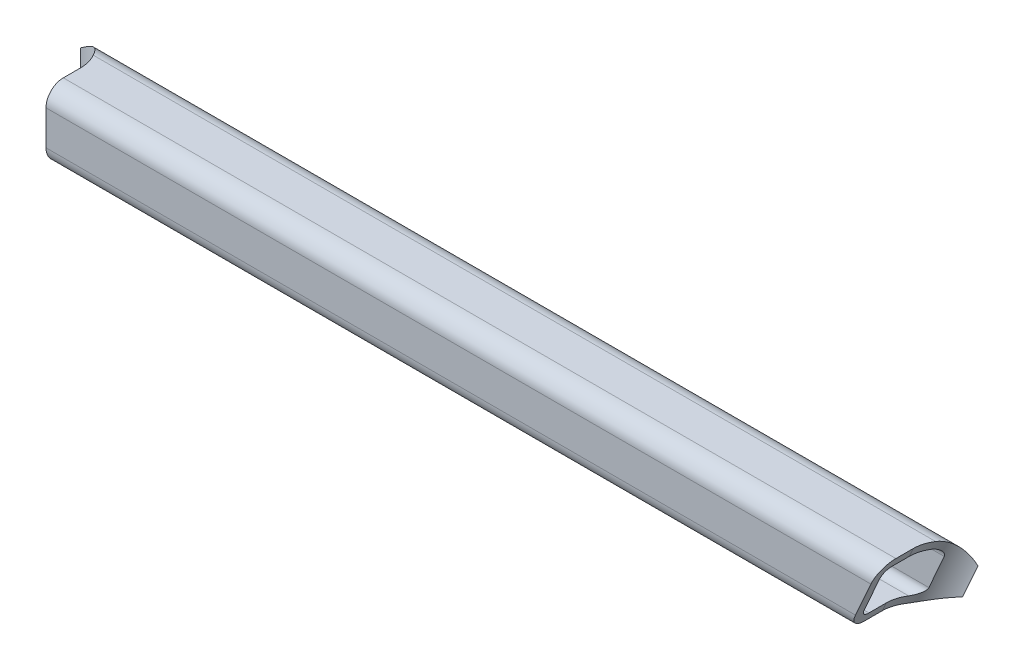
ISO-10303-21;
HEADER;
FILE_DESCRIPTION(('STEP AP214'),'2;1');
FILE_NAME('part.step','',(''),(''),'','','');
FILE_SCHEMA(('AUTOMOTIVE_DESIGN { 1 0 10303 214 1 1 1 1 }'));
ENDSEC;
DATA;
#1=APPLICATION_CONTEXT('core data for automotive mechanical design processes');
#2=APPLICATION_PROTOCOL_DEFINITION('international standard','automotive_design',2000,#1);
#3=PRODUCT_CONTEXT('',#1,'mechanical');
#4=PRODUCT('Part','Part','',(#3));
#5=PRODUCT_RELATED_PRODUCT_CATEGORY('part','',(#4));
#6=PRODUCT_DEFINITION_FORMATION('','',#4);
#7=PRODUCT_DEFINITION_CONTEXT('part definition',#1,'design');
#8=PRODUCT_DEFINITION('design','',#6,#7);
#9=PRODUCT_DEFINITION_SHAPE('','',#8);
#10=(LENGTH_UNIT() NAMED_UNIT(*) SI_UNIT(.MILLI.,.METRE.));
#11=(NAMED_UNIT(*) PLANE_ANGLE_UNIT() SI_UNIT($,.RADIAN.));
#12=(NAMED_UNIT(*) SI_UNIT($,.STERADIAN.) SOLID_ANGLE_UNIT());
#13=UNCERTAINTY_MEASURE_WITH_UNIT(LENGTH_MEASURE(1.E-05),#10,'distance_accuracy_value','');
#14=(GEOMETRIC_REPRESENTATION_CONTEXT(3) GLOBAL_UNCERTAINTY_ASSIGNED_CONTEXT((#13)) GLOBAL_UNIT_ASSIGNED_CONTEXT((#10,
#11,#12)) REPRESENTATION_CONTEXT('',''));
#15=CARTESIAN_POINT('',(0.,0.,0.));
#16=DIRECTION('',(0.,0.,1.));
#17=DIRECTION('',(1.,0.,0.));
#18=AXIS2_PLACEMENT_3D('',#15,#16,#17);
#19=CARTESIAN_POINT('',(-200.305146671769,-898.105968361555,38.1));
#20=DIRECTION('',(-1.,0.,0.));
#21=DIRECTION('',(0.,-1.,0.));
#22=AXIS2_PLACEMENT_3D('',#19,#20,#21);
#23=CYLINDRICAL_SURFACE('',#22,12.7);
#24=CARTESIAN_POINT('',(-233.76137034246,-898.105968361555,38.1));
#25=DIRECTION('',(0.913574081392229,-0.406672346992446,0.));
#26=DIRECTION('',(-0.406672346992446,-0.913574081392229,0.));
#27=AXIS2_PLACEMENT_3D('',#24,#25,#26);
#28=ELLIPSE('',#27,13.9014451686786,12.7);
#29=CARTESIAN_POINT('',(-228.108037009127,-885.405968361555,38.1));
#30=VERTEX_POINT('',#29);
#31=CARTESIAN_POINT('',(-233.76137034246,-898.105968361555,50.8));
#32=VERTEX_POINT('',#31);
#33=EDGE_CURVE('E166',#30,#32,#28,.T.);
#34=ORIENTED_EDGE('',*,*,#33,.F.);
#35=DIRECTION('',(-1.,0.,0.));
#36=VECTOR('',#35,1.);
#37=CARTESIAN_POINT('',(-200.305146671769,-885.405968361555,38.1));
#38=LINE('',#37,#36);
#39=CARTESIAN_POINT('',(-839.061745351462,-885.405968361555,38.1));
#40=VERTEX_POINT('',#39);
#41=EDGE_CURVE('E164',#30,#40,#38,.T.);
#42=ORIENTED_EDGE('',*,*,#41,.T.);
#43=CARTESIAN_POINT('',(-839.061745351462,-898.105968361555,38.1));
#44=DIRECTION('',(-1.,0.,0.));
#45=DIRECTION('',(0.,0.,1.));
#46=AXIS2_PLACEMENT_3D('',#43,#44,#45);
#47=CIRCLE('',#46,12.7);
#48=CARTESIAN_POINT('',(-839.061745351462,-898.105968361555,50.8));
#49=VERTEX_POINT('',#48);
#50=EDGE_CURVE('E194',#49,#40,#47,.T.);
#51=ORIENTED_EDGE('',*,*,#50,.F.);
#52=DIRECTION('',(-1.,0.,0.));
#53=VECTOR('',#52,1.);
#54=CARTESIAN_POINT('',(-200.305146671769,-898.105968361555,50.8));
#55=LINE('',#54,#53);
#56=EDGE_CURVE('E302',#32,#49,#55,.T.);
#57=ORIENTED_EDGE('',*,*,#56,.F.);
#58=EDGE_LOOP('',(#34,#42,#51,#57));
#59=FACE_BOUND('',#58,.T.);
#60=ADVANCED_FACE('F60',(#59),#23,.T.);
#61=CARTESIAN_POINT('',(-200.305146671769,-898.105968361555,50.8));
#62=DIRECTION('',(0.,0.,-1.));
#63=DIRECTION('',(0.,1.,0.));
#64=AXIS2_PLACEMENT_3D('',#61,#62,#63);
#65=PLANE('',#64);
#66=DIRECTION('',(-0.406672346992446,-0.913574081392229,0.));
#67=VECTOR('',#66,1.);
#68=CARTESIAN_POINT('',(-228.228299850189,-885.676134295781,50.8));
#69=LINE('',#68,#67);
#70=CARTESIAN_POINT('',(-245.068037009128,-923.505968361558,50.8));
#71=VERTEX_POINT('',#70);
#72=EDGE_CURVE('E167',#32,#71,#69,.T.);
#73=ORIENTED_EDGE('',*,*,#72,.F.);
#74=ORIENTED_EDGE('',*,*,#56,.T.);
#75=DIRECTION('',(0.,1.,0.));
#76=VECTOR('',#75,1.);
#77=CARTESIAN_POINT('',(-839.061745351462,-898.105968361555,50.8));
#78=LINE('',#77,#76);
#79=CARTESIAN_POINT('',(-839.061745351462,-923.505968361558,50.8));
#80=VERTEX_POINT('',#79);
#81=EDGE_CURVE('E638',#80,#49,#78,.T.);
#82=ORIENTED_EDGE('',*,*,#81,.F.);
#83=DIRECTION('',(-1.,0.,0.));
#84=VECTOR('',#83,1.);
#85=CARTESIAN_POINT('',(-200.305146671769,-923.505968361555,50.8));
#86=LINE('',#85,#84);
#87=EDGE_CURVE('E307',#71,#80,#86,.T.);
#88=ORIENTED_EDGE('',*,*,#87,.F.);
#89=EDGE_LOOP('',(#73,#74,#82,#88));
#90=FACE_BOUND('',#89,.T.);
#91=ADVANCED_FACE('F291',(#90),#65,.F.);
#92=CARTESIAN_POINT('',(-200.305146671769,-923.505968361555,38.1));
#93=DIRECTION('',(-1.,0.,0.));
#94=DIRECTION('',(0.,-1.,0.));
#95=AXIS2_PLACEMENT_3D('',#92,#93,#94);
#96=CYLINDRICAL_SURFACE('',#95,12.7);
#97=CARTESIAN_POINT('',(-245.068037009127,-923.505968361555,38.1));
#98=DIRECTION('',(0.913574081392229,-0.406672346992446,0.));
#99=DIRECTION('',(-0.406672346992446,-0.913574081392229,0.));
#100=AXIS2_PLACEMENT_3D('',#97,#98,#99);
#101=ELLIPSE('',#100,13.9014451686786,12.7);
#102=CARTESIAN_POINT('',(-250.72137034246,-936.205968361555,38.1));
#103=VERTEX_POINT('',#102);
#104=EDGE_CURVE('E170',#71,#103,#101,.T.);
#105=ORIENTED_EDGE('',*,*,#104,.F.);
#106=ORIENTED_EDGE('',*,*,#87,.T.);
#107=CARTESIAN_POINT('',(-839.061745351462,-923.505968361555,38.1));
#108=DIRECTION('',(-1.,0.,0.));
#109=DIRECTION('',(0.,0.,1.));
#110=AXIS2_PLACEMENT_3D('',#107,#108,#109);
#111=CIRCLE('',#110,12.7);
#112=CARTESIAN_POINT('',(-839.061745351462,-936.205968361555,38.1));
#113=VERTEX_POINT('',#112);
#114=EDGE_CURVE('E320',#113,#80,#111,.T.);
#115=ORIENTED_EDGE('',*,*,#114,.F.);
#116=DIRECTION('',(-1.,0.,0.));
#117=VECTOR('',#116,1.);
#118=CARTESIAN_POINT('',(-200.305146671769,-936.205968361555,38.1));
#119=LINE('',#118,#117);
#120=EDGE_CURVE('E317',#103,#113,#119,.T.);
#121=ORIENTED_EDGE('',*,*,#120,.F.);
#122=EDGE_LOOP('',(#105,#106,#115,#121));
#123=FACE_BOUND('',#122,.T.);
#124=ADVANCED_FACE('F296',(#123),#96,.T.);
#125=CARTESIAN_POINT('',(-200.305146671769,-936.205968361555,12.7));
#126=DIRECTION('',(0.,1.,0.));
#127=DIRECTION('',(-1.,0.,0.));
#128=AXIS2_PLACEMENT_3D('',#125,#126,#127);
#129=PLANE('',#128);
#130=CARTESIAN_POINT('',(-222.918480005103,-936.205968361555,25.4000000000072));
#131=DIRECTION('',(0.,1.,0.));
#132=DIRECTION('',(1.,0.,0.));
#133=AXIS2_PLACEMENT_3D('',#130,#131,#132);
#134=ELLIPSE('',#133,27.8028903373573,25.4);
#135=CARTESIAN_POINT('',(-250.72137034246,-936.205968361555,25.4000000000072));
#136=VERTEX_POINT('',#135);
#137=CARTESIAN_POINT('',(-246.996489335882,-936.205968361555,12.6999999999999));
#138=VERTEX_POINT('',#137);
#139=EDGE_CURVE('E77',#136,#138,#134,.F.);
#140=ORIENTED_EDGE('',*,*,#139,.F.);
#141=DIRECTION('',(0.,0.,-1.));
#142=VECTOR('',#141,1.);
#143=CARTESIAN_POINT('',(-250.72137034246,-936.205968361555,12.6999999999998));
#144=LINE('',#143,#142);
#145=EDGE_CURVE('E176',#103,#136,#144,.T.);
#146=ORIENTED_EDGE('',*,*,#145,.F.);
#147=ORIENTED_EDGE('',*,*,#120,.T.);
#148=DIRECTION('',(0.,0.,1.));
#149=VECTOR('',#148,1.);
#150=CARTESIAN_POINT('',(-839.061745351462,-936.205968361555,12.6999999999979));
#151=LINE('',#150,#149);
#152=CARTESIAN_POINT('',(-839.061745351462,-936.205968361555,25.3999999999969));
#153=VERTEX_POINT('',#152);
#154=EDGE_CURVE('E639',#153,#113,#151,.T.);
#155=ORIENTED_EDGE('',*,*,#154,.F.);
#156=CARTESIAN_POINT('',(-864.461745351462,-936.205968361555,25.3999999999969));
#157=DIRECTION('',(0.,1.,0.));
#158=DIRECTION('',(-1.,0.,0.));
#159=AXIS2_PLACEMENT_3D('',#156,#157,#158);
#160=CIRCLE('',#159,25.4);
#161=CARTESIAN_POINT('',(-842.464700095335,-936.205968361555,12.7000000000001));
#162=VERTEX_POINT('',#161);
#163=EDGE_CURVE('E555',#162,#153,#160,.F.);
#164=ORIENTED_EDGE('',*,*,#163,.F.);
#165=DIRECTION('',(-1.,0.,0.));
#166=VECTOR('',#165,1.);
#167=CARTESIAN_POINT('',(-200.305146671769,-936.205968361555,12.7));
#168=LINE('',#167,#166);
#169=EDGE_CURVE('E324',#138,#162,#168,.T.);
#170=ORIENTED_EDGE('',*,*,#169,.F.);
#171=EDGE_LOOP('',(#140,#146,#147,#155,#164,#170));
#172=FACE_BOUND('',#171,.T.);
#173=ADVANCED_FACE('F326',(#172),#129,.F.);
#174=CARTESIAN_POINT('',(-200.305146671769,-923.505968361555,12.7));
#175=DIRECTION('',(-1.,0.,0.));
#176=DIRECTION('',(0.,-1.,0.));
#177=AXIS2_PLACEMENT_3D('',#174,#175,#176);
#178=CYLINDRICAL_SURFACE('',#177,12.7);
#179=CARTESIAN_POINT('',(-217.265146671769,-923.505968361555,3.61429636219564E-12));
#180=CARTESIAN_POINT('',(-217.265033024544,-923.505128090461,2.00365350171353E-08));
#181=CARTESIAN_POINT('',(-217.266953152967,-923.504010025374,1.26577620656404E-07));
#182=CARTESIAN_POINT('',(-217.271050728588,-923.501152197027,7.52028104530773E-07));
#183=CARTESIAN_POINT('',(-217.272500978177,-923.49951214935,1.5036970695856E-06));
#184=CARTESIAN_POINT('',(-217.278686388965,-923.493081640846,5.72505420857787E-06));
#185=CARTESIAN_POINT('',(-217.284486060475,-923.488144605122,1.16486194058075E-05));
#186=CARTESIAN_POINT('',(-217.375613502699,-923.410076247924,0.000149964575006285));
#187=CARTESIAN_POINT('',(-217.451343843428,-923.338266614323,0.000898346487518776));
#188=CARTESIAN_POINT('',(-217.605887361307,-923.19592226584,0.00359484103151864));
#189=CARTESIAN_POINT('',(-217.684559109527,-923.125406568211,0.00550950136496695));
#190=CARTESIAN_POINT('',(-217.839170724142,-922.985839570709,0.0104648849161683));
#191=CARTESIAN_POINT('',(-217.915134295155,-922.916784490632,0.013485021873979));
#192=CARTESIAN_POINT('',(-218.067957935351,-922.778157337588,0.0206811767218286));
#193=CARTESIAN_POINT('',(-218.144820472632,-922.708585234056,0.0248656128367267));
#194=CARTESIAN_POINT('',(-218.296854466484,-922.570940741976,0.0342828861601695));
#195=CARTESIAN_POINT('',(-218.372028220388,-922.502866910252,0.0394924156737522));
#196=CARTESIAN_POINT('',(-218.52222924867,-922.366919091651,0.0509996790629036));
#197=CARTESIAN_POINT('',(-218.597256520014,-922.299044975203,0.0572952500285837));
#198=CARTESIAN_POINT('',(-218.82358605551,-922.094376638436,0.0779429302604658));
#199=CARTESIAN_POINT('',(-218.97484363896,-921.957707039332,0.0939760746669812));
#200=CARTESIAN_POINT('',(-219.29045409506,-921.672866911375,0.132098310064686));
#201=CARTESIAN_POINT('',(-219.454794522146,-921.524736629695,0.154594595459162));
#202=CARTESIAN_POINT('',(-219.782921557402,-921.229445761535,0.204807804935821));
#203=CARTESIAN_POINT('',(-219.946708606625,-921.082283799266,0.232513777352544));
#204=CARTESIAN_POINT('',(-220.275406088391,-920.787524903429,0.293433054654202));
#205=CARTESIAN_POINT('',(-220.440314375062,-920.639934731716,0.326690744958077));
#206=CARTESIAN_POINT('',(-220.769909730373,-920.345639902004,0.398565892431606));
#207=CARTESIAN_POINT('',(-220.934596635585,-920.198935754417,0.437186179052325));
#208=CARTESIAN_POINT('',(-221.360692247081,-919.820398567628,0.544141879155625));
#209=CARTESIAN_POINT('',(-221.621836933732,-919.589409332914,0.616565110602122));
#210=CARTESIAN_POINT('',(-222.142535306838,-919.13129751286,0.774780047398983));
#211=CARTESIAN_POINT('',(-222.402091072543,-918.904168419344,0.860546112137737));
#212=CARTESIAN_POINT('',(-222.915344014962,-918.457930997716,1.04390838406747));
#213=CARTESIAN_POINT('',(-223.16906371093,-918.238751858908,1.14126894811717));
#214=CARTESIAN_POINT('',(-223.675189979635,-917.804812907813,1.34902095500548));
#215=CARTESIAN_POINT('',(-223.927595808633,-917.59005543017,1.45941908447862));
#216=CARTESIAN_POINT('',(-224.451349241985,-917.148359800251,1.70275139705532));
#217=CARTESIAN_POINT('',(-224.722557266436,-916.921862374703,1.8367903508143));
#218=CARTESIAN_POINT('',(-225.26271751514,-916.475842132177,2.11996639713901));
#219=CARTESIAN_POINT('',(-225.531670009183,-916.256318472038,2.26910165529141));
#220=CARTESIAN_POINT('',(-226.337576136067,-915.607251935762,2.74071824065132));
#221=CARTESIAN_POINT('',(-226.870856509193,-915.189522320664,3.08614809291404));
#222=CARTESIAN_POINT('',(-227.949546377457,-914.375040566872,3.85444278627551));
#223=CARTESIAN_POINT('',(-228.494360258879,-913.980177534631,4.28016931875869));
#224=CARTESIAN_POINT('',(-229.298263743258,-913.428527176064,4.96558992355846));
#225=CARTESIAN_POINT('',(-229.563847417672,-913.251517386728,5.2017036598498));
#226=CARTESIAN_POINT('',(-230.090364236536,-912.912255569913,5.68919341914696));
#227=CARTESIAN_POINT('',(-230.351297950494,-912.750001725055,5.94056755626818));
#228=CARTESIAN_POINT('',(-230.956880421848,-912.388708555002,6.54693273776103));
#229=CARTESIAN_POINT('',(-231.299507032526,-912.196170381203,6.90786314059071));
#230=CARTESIAN_POINT('',(-231.974565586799,-911.843928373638,7.65448672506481));
#231=CARTESIAN_POINT('',(-232.30699732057,-911.684225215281,8.04018041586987));
#232=CARTESIAN_POINT('',(-232.957352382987,-911.40281164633,8.82992010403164));
#233=CARTESIAN_POINT('',(-233.275388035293,-911.280735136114,9.23374240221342));
#234=CARTESIAN_POINT('',(-233.899524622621,-911.076051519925,10.0602298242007));
#235=CARTESIAN_POINT('',(-234.205625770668,-910.993443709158,10.4828946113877));
#236=CARTESIAN_POINT('',(-234.808473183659,-910.870490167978,11.3480753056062));
#237=CARTESIAN_POINT('',(-235.105076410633,-910.830627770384,11.7907604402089));
#238=CARTESIAN_POINT('',(-235.684724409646,-910.798067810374,12.6867054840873));
#239=CARTESIAN_POINT('',(-235.967768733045,-910.805371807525,13.1399657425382));
#240=CARTESIAN_POINT('',(-236.520473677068,-910.869858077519,14.0520406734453));
#241=CARTESIAN_POINT('',(-236.790114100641,-910.927113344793,14.5108625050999));
#242=CARTESIAN_POINT('',(-237.315775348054,-911.093450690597,15.4269002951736));
#243=CARTESIAN_POINT('',(-237.57179825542,-911.20252481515,15.8841164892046));
#244=CARTESIAN_POINT('',(-238.039905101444,-911.456380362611,16.7334521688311));
#245=CARTESIAN_POINT('',(-238.253490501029,-911.595023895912,17.1265879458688));
#246=CARTESIAN_POINT('',(-238.671712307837,-911.912358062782,17.9012833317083));
#247=CARTESIAN_POINT('',(-238.876349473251,-912.091045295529,18.2828439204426));
#248=CARTESIAN_POINT('',(-239.27772214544,-912.487330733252,19.0291397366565));
#249=CARTESIAN_POINT('',(-239.474463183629,-912.70490109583,19.3938867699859));
#250=CARTESIAN_POINT('',(-239.861650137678,-913.177281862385,20.1019816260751));
#251=CARTESIAN_POINT('',(-240.052096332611,-913.432090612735,20.4453303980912));
#252=CARTESIAN_POINT('',(-240.413823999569,-913.955468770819,21.0805771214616));
#253=CARTESIAN_POINT('',(-240.58545171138,-914.221466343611,21.3744010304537));
#254=CARTESIAN_POINT('',(-240.926077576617,-914.78060761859,21.9366247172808));
#255=CARTESIAN_POINT('',(-241.095075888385,-915.073749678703,22.2050260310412));
#256=CARTESIAN_POINT('',(-241.431747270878,-915.684330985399,22.713482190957));
#257=CARTESIAN_POINT('',(-241.599420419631,-916.001768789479,22.9535387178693));
#258=CARTESIAN_POINT('',(-241.934641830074,-916.657813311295,23.4028425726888));
#259=CARTESIAN_POINT('',(-242.102190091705,-916.996420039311,23.6120898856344));
#260=CARTESIAN_POINT('',(-242.434523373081,-917.68396196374,23.9936037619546));
#261=CARTESIAN_POINT('',(-242.599290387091,-918.032518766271,24.1665684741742));
#262=CARTESIAN_POINT('',(-242.93028862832,-918.743426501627,24.4796028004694));
#263=CARTESIAN_POINT('',(-243.096519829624,-919.105777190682,24.6196729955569));
#264=CARTESIAN_POINT('',(-243.430778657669,-919.841005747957,24.865868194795));
#265=CARTESIAN_POINT('',(-243.598806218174,-920.213883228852,24.9719944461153));
#266=CARTESIAN_POINT('',(-243.936649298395,-920.967000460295,25.1496321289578));
#267=CARTESIAN_POINT('',(-244.10646483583,-921.347240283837,25.221143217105));
#268=CARTESIAN_POINT('',(-244.447837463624,-922.112813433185,25.3292867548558));
#269=CARTESIAN_POINT('',(-244.619397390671,-922.498155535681,25.365848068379));
#270=CARTESIAN_POINT('',(-244.963136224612,-923.270296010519,25.4036955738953));
#271=CARTESIAN_POINT('',(-245.135315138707,-923.657094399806,25.4049813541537));
#272=CARTESIAN_POINT('',(-245.479242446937,-924.429750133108,25.3722638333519));
#273=CARTESIAN_POINT('',(-245.650990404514,-924.815606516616,25.338233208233));
#274=CARTESIAN_POINT('',(-245.992325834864,-925.583538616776,25.2349036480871));
#275=CARTESIAN_POINT('',(-246.161913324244,-925.965614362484,25.1656049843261));
#276=CARTESIAN_POINT('',(-246.498540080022,-926.727266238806,24.9909475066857));
#277=CARTESIAN_POINT('',(-246.665538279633,-927.106781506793,24.8852431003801));
#278=CARTESIAN_POINT('',(-246.992710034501,-927.85705039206,24.6379275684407));
#279=CARTESIAN_POINT('',(-247.152882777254,-928.2278029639,24.4963121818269));
#280=CARTESIAN_POINT('',(-247.463050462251,-928.957442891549,24.1773592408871));
#281=CARTESIAN_POINT('',(-247.613057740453,-929.316344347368,24.0000660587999));
#282=CARTESIAN_POINT('',(-247.899323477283,-930.019833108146,23.6096860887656));
#283=CARTESIAN_POINT('',(-248.035587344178,-930.364426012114,23.3966134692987));
#284=CARTESIAN_POINT('',(-248.253536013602,-930.939950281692,23.0009989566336));
#285=CARTESIAN_POINT('',(-248.339684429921,-931.175201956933,22.827154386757));
#286=CARTESIAN_POINT('',(-248.500863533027,-931.63538207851,22.4616048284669));
#287=CARTESIAN_POINT('',(-248.575897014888,-931.860313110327,22.2699043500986));
#288=CARTESIAN_POINT('',(-248.712824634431,-932.298247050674,21.8691805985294));
#289=CARTESIAN_POINT('',(-248.774725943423,-932.511256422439,21.6601668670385));
#290=CARTESIAN_POINT('',(-248.88332954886,-932.923812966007,21.2254896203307));
#291=CARTESIAN_POINT('',(-248.930031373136,-933.123359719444,20.9998255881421));
#292=CARTESIAN_POINT('',(-249.006472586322,-933.509093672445,20.5307458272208));
#293=CARTESIAN_POINT('',(-249.036039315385,-933.695128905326,20.2871763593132));
#294=CARTESIAN_POINT('',(-249.075410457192,-934.049759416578,19.7860890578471));
#295=CARTESIAN_POINT('',(-249.085215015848,-934.218354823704,19.5285713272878));
#296=CARTESIAN_POINT('',(-249.083311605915,-934.536185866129,19.0022768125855));
#297=CARTESIAN_POINT('',(-249.071626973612,-934.685442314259,18.7335125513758));
#298=CARTESIAN_POINT('',(-249.02557101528,-934.963363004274,18.1874327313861));
#299=CARTESIAN_POINT('',(-248.991203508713,-935.092030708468,17.9101186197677));
#300=CARTESIAN_POINT('',(-248.906305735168,-935.30987501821,17.3929855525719));
#301=CARTESIAN_POINT('',(-248.859038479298,-935.402081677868,17.1538959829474));
#302=CARTESIAN_POINT('',(-248.747994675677,-935.570851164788,16.6740732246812));
#303=CARTESIAN_POINT('',(-248.684220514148,-935.647416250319,16.4333402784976));
#304=CARTESIAN_POINT('',(-248.540647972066,-935.785049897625,15.9521978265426));
#305=CARTESIAN_POINT('',(-248.460846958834,-935.846115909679,15.7117883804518));
#306=CARTESIAN_POINT('',(-248.2860437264,-935.953189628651,15.2331505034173));
#307=CARTESIAN_POINT('',(-248.191039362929,-935.999195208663,14.9949223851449));
#308=CARTESIAN_POINT('',(-247.965641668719,-936.084912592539,14.4730881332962));
#309=CARTESIAN_POINT('',(-247.83199706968,-936.12132880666,14.1903418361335));
#310=CARTESIAN_POINT('',(-247.546145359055,-936.174786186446,13.6325343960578));
#311=CARTESIAN_POINT('',(-247.393934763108,-936.191823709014,13.3574747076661));
#312=CARTESIAN_POINT('',(-247.072875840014,-936.208328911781,12.8161490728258));
#313=CARTESIAN_POINT('',(-246.904000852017,-936.207767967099,12.5498981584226));
#314=CARTESIAN_POINT('',(-246.551879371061,-936.190846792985,12.027558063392));
#315=CARTESIAN_POINT('',(-246.368628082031,-936.174481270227,11.7714723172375));
#316=CARTESIAN_POINT('',(-245.900196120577,-936.116675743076,11.1515953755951));
#317=CARTESIAN_POINT('',(-245.607743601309,-936.067044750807,10.7940442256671));
#318=CARTESIAN_POINT('',(-245.001137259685,-935.942477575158,10.1025443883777));
#319=CARTESIAN_POINT('',(-244.686972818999,-935.867528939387,9.76860741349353));
#320=CARTESIAN_POINT('',(-244.04159385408,-935.696733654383,9.12422004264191));
#321=CARTESIAN_POINT('',(-243.710398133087,-935.600909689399,8.81374464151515));
#322=CARTESIAN_POINT('',(-243.033991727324,-935.391856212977,8.21488558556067));
#323=CARTESIAN_POINT('',(-242.688782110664,-935.278628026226,7.92650025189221));
#324=CARTESIAN_POINT('',(-242.037418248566,-935.054964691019,7.41058405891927));
#325=CARTESIAN_POINT('',(-241.73278868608,-934.946470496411,7.1802665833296));
#326=CARTESIAN_POINT('',(-241.116382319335,-934.720273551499,6.73410304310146));
#327=CARTESIAN_POINT('',(-240.804604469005,-934.60256944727,6.51825911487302));
#328=CARTESIAN_POINT('',(-240.174827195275,-934.359137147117,6.10020722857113));
#329=CARTESIAN_POINT('',(-239.856824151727,-934.23340417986,5.89800752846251));
#330=CARTESIAN_POINT('',(-239.215613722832,-933.975005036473,5.50665203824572));
#331=CARTESIAN_POINT('',(-238.892405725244,-933.842338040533,5.31749779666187));
#332=CARTESIAN_POINT('',(-238.235575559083,-933.568477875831,4.94824486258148));
#333=CARTESIAN_POINT('',(-237.901871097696,-933.427172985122,4.76837576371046));
#334=CARTESIAN_POINT('',(-237.230469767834,-933.139082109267,4.42086752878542));
#335=CARTESIAN_POINT('',(-236.892772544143,-932.992295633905,4.25322949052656));
#336=CARTESIAN_POINT('',(-235.8749693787,-932.544950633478,3.76800709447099));
#337=CARTESIAN_POINT('',(-235.189654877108,-932.237197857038,3.46783775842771));
#338=CARTESIAN_POINT('',(-233.865424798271,-931.632818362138,2.933047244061));
#339=CARTESIAN_POINT('',(-233.227317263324,-931.337351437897,2.69506829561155));
#340=CARTESIAN_POINT('',(-231.944128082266,-930.736435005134,2.2525312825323));
#341=CARTESIAN_POINT('',(-231.299045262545,-930.430983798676,2.04797893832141));
#342=CARTESIAN_POINT('',(-230.001651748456,-929.811302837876,1.66982001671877));
#343=CARTESIAN_POINT('',(-229.349325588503,-929.497050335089,1.49630425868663));
#344=CARTESIAN_POINT('',(-228.040489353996,-928.862296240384,1.17934119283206));
#345=CARTESIAN_POINT('',(-227.383979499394,-928.54179497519,1.03589231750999));
#346=CARTESIAN_POINT('',(-226.122550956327,-927.922836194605,0.788539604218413));
#347=CARTESIAN_POINT('',(-225.51788997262,-927.624766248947,0.682337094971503));
#348=CARTESIAN_POINT('',(-224.306503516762,-927.025485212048,0.493374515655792));
#349=CARTESIAN_POINT('',(-223.699778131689,-926.724274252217,0.410613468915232));
#350=CARTESIAN_POINT('',(-222.490415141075,-926.122335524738,0.268613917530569));
#351=CARTESIAN_POINT('',(-221.887791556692,-925.821629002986,0.209165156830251));
#352=CARTESIAN_POINT('',(-220.68146760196,-925.218636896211,0.112306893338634));
#353=CARTESIAN_POINT('',(-220.077767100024,-924.91635110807,0.0749002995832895));
#354=CARTESIAN_POINT('',(-219.31482608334,-924.534015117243,0.0414253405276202));
#355=CARTESIAN_POINT('',(-219.155846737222,-924.454327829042,0.0352062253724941));
#356=CARTESIAN_POINT('',(-218.834435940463,-924.293158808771,0.0241570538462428));
#357=CARTESIAN_POINT('',(-218.672004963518,-924.211675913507,0.0193603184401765));
#358=CARTESIAN_POINT('',(-218.404053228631,-924.077350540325,0.0127494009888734));
#359=CARTESIAN_POINT('',(-218.298599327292,-924.02450939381,0.0104795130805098));
#360=CARTESIAN_POINT('',(-218.088889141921,-923.919158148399,0.00661525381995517));
#361=CARTESIAN_POINT('',(-217.984629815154,-923.866648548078,0.00501593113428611));
#362=CARTESIAN_POINT('',(-217.783193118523,-923.766139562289,0.0025726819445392));
#363=CARTESIAN_POINT('',(-217.686137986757,-923.718124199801,0.00167747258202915));
#364=CARTESIAN_POINT('',(-217.494402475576,-923.620024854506,0.000417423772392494));
#365=CARTESIAN_POINT('',(-217.39986863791,-923.569920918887,6.84290807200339E-05));
#366=CARTESIAN_POINT('',(-217.288565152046,-923.51795695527,5.18790075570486E-06));
#367=CARTESIAN_POINT('',(-217.281662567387,-923.514760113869,2.53973906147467E-06));
#368=CARTESIAN_POINT('',(-217.27398266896,-923.510225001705,6.79555695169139E-07));
#369=CARTESIAN_POINT('',(-217.272142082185,-923.509030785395,3.52896499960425E-07));
#370=CARTESIAN_POINT('',(-217.26741532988,-923.507373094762,4.66809043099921E-08));
#371=CARTESIAN_POINT('',(-217.265260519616,-923.506810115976,-2.00646704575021E-08));
#372=CARTESIAN_POINT('',(-217.265146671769,-923.505968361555,3.61429636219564E-12));
#373=B_SPLINE_CURVE_WITH_KNOTS('',3,(#179,#180,#181,#182,#183,#184,#185,#186,#187,#188,#189,
#190,#191,#192,#193,#194,#195,#196,#197,#198,#199,#200,#201,#202,#203,#204,#205,#206,#207,#208,
#209,#210,#211,#212,#213,#214,#215,#216,#217,#218,#219,#220,#221,#222,#223,#224,#225,#226,#227,
#228,#229,#230,#231,#232,#233,#234,#235,#236,#237,#238,#239,#240,#241,#242,#243,#244,#245,#246,
#247,#248,#249,#250,#251,#252,#253,#254,#255,#256,#257,#258,#259,#260,#261,#262,#263,#264,#265,
#266,#267,#268,#269,#270,#271,#272,#273,#274,#275,#276,#277,#278,#279,#280,#281,#282,#283,#284,
#285,#286,#287,#288,#289,#290,#291,#292,#293,#294,#295,#296,#297,#298,#299,#300,#301,#302,#303,
#304,#305,#306,#307,#308,#309,#310,#311,#312,#313,#314,#315,#316,#317,#318,#319,#320,#321,#322,
#323,#324,#325,#326,#327,#328,#329,#330,#331,#332,#333,#334,#335,#336,#337,#338,#339,#340,#341,
#342,#343,#344,#345,#346,#347,#348,#349,#350,#351,#352,#353,#354,#355,#356,#357,#358,#359,#360,
#361,#362,#363,#364,#365,#366,#367,#368,#369,#370,#371,#372),.UNSPECIFIED.,.T.,.F.,(4,2,2,2,2,2,
2,2,2,2,2,2,2,2,2,2,2,2,2,2,2,2,2,2,2,2,2,2,2,2,2,2,2,2,2,2,2,2,2,2,2,2,2,2,2,2,2,2,2,2,2,2,2,2,
2,2,2,2,2,2,2,2,2,2,2,2,2,2,2,2,2,2,2,2,2,2,2,2,2,2,2,2,2,2,2,2,2,2,2,2,2,2,2,2,2,2,4),(0.,
0.00449848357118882,0.0120831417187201,0.033875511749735,0.357103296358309,0.671469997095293,
0.980257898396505,1.29133919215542,1.59602879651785,1.9001184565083,2.51353288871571,
3.18063105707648,3.84634223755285,4.51765579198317,5.18932490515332,6.25729510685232,
7.32323780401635,8.37035778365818,9.4180171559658,10.5513801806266,11.6846056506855,
13.9623722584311,16.3464511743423,17.5369780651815,18.7273581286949,20.3265104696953,
21.925695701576,23.508790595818,25.091857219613,26.6926410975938,28.2934779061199,
29.8966579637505,31.4995920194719,32.9029185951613,34.3061260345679,35.7083326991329,
37.1104771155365,38.4046166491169,39.6986779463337,40.9926624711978,42.2866476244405,
43.5528219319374,44.8189738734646,46.0850792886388,47.3511972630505,48.6198868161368,
49.888591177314,51.1582778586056,52.4279547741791,53.7100327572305,54.9922629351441,
56.2729081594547,57.5530474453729,58.4670581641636,59.380838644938,60.2941188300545,
61.2074273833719,62.1297855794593,63.0521369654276,63.9734873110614,64.8946825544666,
65.6754324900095,66.4560696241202,67.2368350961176,68.0177107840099,68.9608888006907,
69.9042441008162,70.8491339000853,71.7943402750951,73.1858617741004,74.5780686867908,
75.9687702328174,77.3593659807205,78.5499375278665,79.7406844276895,80.9321456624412,
82.1237480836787,83.3371964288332,84.5507535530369,86.9760535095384,89.2023062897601,
91.4289396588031,93.6619856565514,95.8949152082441,97.9418494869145,99.9886984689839,
102.016637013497,104.04484313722,104.57864039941,105.124101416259,105.477813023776,
105.828864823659,106.151063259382,106.482445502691,106.504210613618,106.511814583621,
106.516321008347),.UNSPECIFIED.);
#374=CARTESIAN_POINT('',(-217.265146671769,-923.505968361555,1.83186799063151E-12));
#375=VERTEX_POINT('',#374);
#376=EDGE_CURVE('E181',#138,#375,#373,.T.);
#377=ORIENTED_EDGE('',*,*,#376,.F.);
#378=ORIENTED_EDGE('',*,*,#169,.T.);
#379=CARTESIAN_POINT('',(-864.461745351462,-923.505968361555,-1.54824070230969E-12));
#380=CARTESIAN_POINT('',(-864.461745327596,-923.506792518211,-1.54270489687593E-12));
#381=CARTESIAN_POINT('',(-864.459808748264,-923.507616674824,8.01123900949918E-08));
#382=CARTESIAN_POINT('',(-864.455643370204,-923.509818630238,5.08586990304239E-07));
#383=CARTESIAN_POINT('',(-864.454093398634,-923.511196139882,1.00107786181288E-06));
#384=CARTESIAN_POINT('',(-864.447581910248,-923.516505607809,3.76326088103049E-06));
#385=CARTESIAN_POINT('',(-864.441623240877,-923.5204384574,7.63503513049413E-06));
#386=CARTESIAN_POINT('',(-864.372158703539,-923.566714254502,7.46848343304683E-05));
#387=CARTESIAN_POINT('',(-864.314990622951,-923.609051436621,0.000347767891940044));
#388=CARTESIAN_POINT('',(-864.198746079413,-923.692604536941,0.00130456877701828));
#389=CARTESIAN_POINT('',(-864.139760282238,-923.733820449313,0.00197721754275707));
#390=CARTESIAN_POINT('',(-864.023691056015,-923.815533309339,0.00370878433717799));
#391=CARTESIAN_POINT('',(-863.966592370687,-923.856030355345,0.00476081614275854));
#392=CARTESIAN_POINT('',(-863.851764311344,-923.937308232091,0.0072614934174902));
#393=CARTESIAN_POINT('',(-863.794033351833,-923.978089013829,0.00871293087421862));
#394=CARTESIAN_POINT('',(-863.623319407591,-924.098715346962,0.0135884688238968));
#395=CARTESIAN_POINT('',(-863.510402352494,-924.178547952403,0.0175700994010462));
#396=CARTESIAN_POINT('',(-863.283724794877,-924.338745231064,0.0270773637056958));
#397=CARTESIAN_POINT('',(-863.169964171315,-924.419109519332,0.032614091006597));
#398=CARTESIAN_POINT('',(-862.944776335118,-924.578153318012,0.0450936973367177));
#399=CARTESIAN_POINT('',(-862.833348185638,-924.656834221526,0.0520060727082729));
#400=CARTESIAN_POINT('',(-862.610747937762,-924.813959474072,0.0672893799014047));
#401=CARTESIAN_POINT('',(-862.49957576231,-924.892403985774,0.0756574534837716));
#402=CARTESIAN_POINT('',(-862.164254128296,-925.128915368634,0.103120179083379));
#403=CARTESIAN_POINT('',(-861.940179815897,-925.286831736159,0.124469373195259));
#404=CARTESIAN_POINT('',(-861.47313365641,-925.615620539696,0.175250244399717));
#405=CARTESIAN_POINT('',(-861.230186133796,-925.78644484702,0.205217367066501));
#406=CARTESIAN_POINT('',(-860.745196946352,-926.126934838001,0.272185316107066));
#407=CARTESIAN_POINT('',(-860.503154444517,-926.296602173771,0.309171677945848));
#408=CARTESIAN_POINT('',(-860.017578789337,-926.636342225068,0.390592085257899));
#409=CARTESIAN_POINT('',(-859.774049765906,-926.806406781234,0.435084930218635));
#410=CARTESIAN_POINT('',(-859.287476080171,-927.145425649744,0.531375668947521));
#411=CARTESIAN_POINT('',(-859.04443173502,-927.31437933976,0.583177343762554));
#412=CARTESIAN_POINT('',(-858.411448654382,-927.75322464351,0.727865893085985));
#413=CARTESIAN_POINT('',(-858.022062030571,-928.022016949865,0.82658053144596));
#414=CARTESIAN_POINT('',(-857.246298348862,-928.554618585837,1.04308719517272));
#415=CARTESIAN_POINT('',(-856.859917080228,-928.81843615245,1.16084388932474));
#416=CARTESIAN_POINT('',(-856.09635722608,-929.33628688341,1.41376812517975));
#417=CARTESIAN_POINT('',(-855.719132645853,-929.590409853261,1.54861245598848));
#418=CARTESIAN_POINT('',(-854.967743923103,-930.092508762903,1.83761417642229));
#419=CARTESIAN_POINT('',(-854.593581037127,-930.340482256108,1.99177910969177));
#420=CARTESIAN_POINT('',(-853.957003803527,-930.758224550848,2.27222816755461));
#421=CARTESIAN_POINT('',(-853.693637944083,-930.929825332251,2.39363919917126));
#422=CARTESIAN_POINT('',(-853.169114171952,-931.268833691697,2.6465114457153));
#423=CARTESIAN_POINT('',(-852.90795595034,-931.436241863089,2.77797122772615));
#424=CARTESIAN_POINT('',(-852.126045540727,-931.932823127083,3.18878342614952));
#425=CARTESIAN_POINT('',(-851.60888841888,-932.255015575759,3.48367854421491));
#426=CARTESIAN_POINT('',(-850.567736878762,-932.88783088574,4.12783111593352));
#427=CARTESIAN_POINT('',(-850.044205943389,-933.197575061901,4.4787049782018));
#428=CARTESIAN_POINT('',(-849.01420760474,-933.785797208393,5.22729098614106));
#429=CARTESIAN_POINT('',(-848.507719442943,-934.064314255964,5.62494328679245));
#430=CARTESIAN_POINT('',(-847.651880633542,-934.511725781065,6.35239018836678));
#431=CARTESIAN_POINT('',(-847.297589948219,-934.689714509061,6.67081096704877));
#432=CARTESIAN_POINT('',(-846.601771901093,-935.02221567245,7.33312405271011));
#433=CARTESIAN_POINT('',(-846.260246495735,-935.176724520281,7.67702024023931));
#434=CARTESIAN_POINT('',(-845.59530767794,-935.457112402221,8.38671484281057));
#435=CARTESIAN_POINT('',(-845.271759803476,-935.583234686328,8.75229034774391));
#436=CARTESIAN_POINT('',(-844.642115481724,-935.80434551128,9.5071210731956));
#437=CARTESIAN_POINT('',(-844.336014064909,-935.899342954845,9.89636948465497));
#438=CARTESIAN_POINT('',(-843.808405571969,-936.036835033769,10.6097530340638));
#439=CARTESIAN_POINT('',(-843.5829699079,-936.086252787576,10.9296575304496));
#440=CARTESIAN_POINT('',(-843.145926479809,-936.160874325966,11.5815423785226));
#441=CARTESIAN_POINT('',(-842.934317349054,-936.186080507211,11.9135215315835));
#442=CARTESIAN_POINT('',(-842.526135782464,-936.209964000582,12.588106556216));
#443=CARTESIAN_POINT('',(-842.329581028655,-936.208610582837,12.9307242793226));
#444=CARTESIAN_POINT('',(-841.953166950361,-936.17707480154,13.6237794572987));
#445=CARTESIAN_POINT('',(-841.773307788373,-936.146892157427,13.9742169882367));
#446=CARTESIAN_POINT('',(-841.430173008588,-936.055383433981,14.6825966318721));
#447=CARTESIAN_POINT('',(-841.26703736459,-935.993816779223,15.0405759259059));
#448=CARTESIAN_POINT('',(-840.959893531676,-935.837854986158,15.7576415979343));
#449=CARTESIAN_POINT('',(-840.81588559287,-935.743459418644,16.1167279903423));
#450=CARTESIAN_POINT('',(-840.547596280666,-935.52098579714,16.8315057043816));
#451=CARTESIAN_POINT('',(-840.423299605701,-935.392934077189,17.1871994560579));
#452=CARTESIAN_POINT('',(-840.194255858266,-935.102900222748,17.8909488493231));
#453=CARTESIAN_POINT('',(-840.089506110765,-934.940922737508,18.2390055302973));
#454=CARTESIAN_POINT('',(-839.911570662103,-934.60737277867,18.8774419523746));
#455=CARTESIAN_POINT('',(-839.836040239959,-934.439936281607,19.1693395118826));
#456=CARTESIAN_POINT('',(-839.698400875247,-934.080793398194,19.7410944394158));
#457=CARTESIAN_POINT('',(-839.636290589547,-933.889089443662,20.0209530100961));
#458=CARTESIAN_POINT('',(-839.5244374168,-933.482565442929,20.565945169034));
#459=CARTESIAN_POINT('',(-839.474694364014,-933.26774570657,20.8310789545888));
#460=CARTESIAN_POINT('',(-839.38629512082,-932.816430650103,21.3441908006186));
#461=CARTESIAN_POINT('',(-839.347639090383,-932.579935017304,21.5921686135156));
#462=CARTESIAN_POINT('',(-839.280999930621,-932.094343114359,22.061647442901));
#463=CARTESIAN_POINT('',(-839.252731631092,-931.845836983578,22.2837192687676));
#464=CARTESIAN_POINT('',(-839.203904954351,-931.331688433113,22.7079560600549));
#465=CARTESIAN_POINT('',(-839.183346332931,-931.066046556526,22.9101216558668));
#466=CARTESIAN_POINT('',(-839.148548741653,-930.519370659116,23.2930912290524));
#467=CARTESIAN_POINT('',(-839.134310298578,-930.238335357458,23.4738934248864));
#468=CARTESIAN_POINT('',(-839.110810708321,-929.662731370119,23.8128680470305));
#469=CARTESIAN_POINT('',(-839.101549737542,-929.368162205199,23.9710396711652));
#470=CARTESIAN_POINT('',(-839.086452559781,-928.755242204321,24.2696141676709));
#471=CARTESIAN_POINT('',(-839.080769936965,-928.436411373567,24.4090402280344));
#472=CARTESIAN_POINT('',(-839.072176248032,-927.788352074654,24.6612750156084));
#473=CARTESIAN_POINT('',(-839.069265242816,-927.459123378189,24.7740831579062));
#474=CARTESIAN_POINT('',(-839.065152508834,-926.792475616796,24.9723188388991));
#475=CARTESIAN_POINT('',(-839.063950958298,-926.455055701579,25.0577435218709));
#476=CARTESIAN_POINT('',(-839.06242735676,-925.774342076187,25.2006172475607));
#477=CARTESIAN_POINT('',(-839.062105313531,-925.431048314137,25.2580660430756));
#478=CARTESIAN_POINT('',(-839.061764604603,-924.732567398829,25.3456437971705));
#479=CARTESIAN_POINT('',(-839.061753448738,-924.377293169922,25.3750799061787));
#480=CARTESIAN_POINT('',(-839.061741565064,-923.665523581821,25.4039919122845));
#481=CARTESIAN_POINT('',(-839.061740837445,-923.309028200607,25.4034672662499));
#482=CARTESIAN_POINT('',(-839.061755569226,-922.597322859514,25.3724599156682));
#483=CARTESIAN_POINT('',(-839.061771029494,-922.242112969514,25.3419756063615));
#484=CARTESIAN_POINT('',(-839.062140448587,-921.535513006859,25.2512622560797));
#485=CARTESIAN_POINT('',(-839.062494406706,-921.184122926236,25.1910332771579));
#486=CARTESIAN_POINT('',(-839.0641706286,-920.486798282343,25.0410740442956));
#487=CARTESIAN_POINT('',(-839.065495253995,-920.140879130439,24.9512721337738));
#488=CARTESIAN_POINT('',(-839.070033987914,-919.457844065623,24.7428478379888));
#489=CARTESIAN_POINT('',(-839.073248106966,-919.120728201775,24.6242252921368));
#490=CARTESIAN_POINT('',(-839.082739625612,-918.457698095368,24.3590077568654));
#491=CARTESIAN_POINT('',(-839.089017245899,-918.131784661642,24.2124107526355));
#492=CARTESIAN_POINT('',(-839.106023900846,-917.493554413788,23.892333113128));
#493=CARTESIAN_POINT('',(-839.116752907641,-917.181237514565,23.7188526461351));
#494=CARTESIAN_POINT('',(-839.144154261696,-916.573862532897,23.3471641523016));
#495=CARTESIAN_POINT('',(-839.160799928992,-916.278733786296,23.1490696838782));
#496=CARTESIAN_POINT('',(-839.201680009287,-915.706438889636,22.7291226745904));
#497=CARTESIAN_POINT('',(-839.225914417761,-915.429272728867,22.5072701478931));
#498=CARTESIAN_POINT('',(-839.283638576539,-914.895080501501,22.0417391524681));
#499=CARTESIAN_POINT('',(-839.317125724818,-914.638048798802,21.7980668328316));
#500=CARTESIAN_POINT('',(-839.394992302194,-914.145999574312,21.2910282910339));
#501=CARTESIAN_POINT('',(-839.43937134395,-913.910981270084,21.0276627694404));
#502=CARTESIAN_POINT('',(-839.538905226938,-913.471870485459,20.4924845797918));
#503=CARTESIAN_POINT('',(-839.593668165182,-913.267027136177,20.2212149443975));
#504=CARTESIAN_POINT('',(-839.715994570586,-912.880919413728,19.665120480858));
#505=CARTESIAN_POINT('',(-839.78355770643,-912.69965443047,19.380296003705));
#506=CARTESIAN_POINT('',(-839.932393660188,-912.361765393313,18.7999546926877));
#507=CARTESIAN_POINT('',(-840.013661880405,-912.205133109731,18.5044414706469));
#508=CARTESIAN_POINT('',(-840.190556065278,-911.917064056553,17.905545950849));
#509=CARTESIAN_POINT('',(-840.286181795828,-911.785626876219,17.6021637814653));
#510=CARTESIAN_POINT('',(-840.488707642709,-911.552055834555,17.0005429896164));
#511=CARTESIAN_POINT('',(-840.59513427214,-911.449101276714,16.7024627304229));
#512=CARTESIAN_POINT('',(-840.821678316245,-911.266756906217,16.1043292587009));
#513=CARTESIAN_POINT('',(-840.941795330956,-911.187366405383,15.8042761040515));
#514=CARTESIAN_POINT('',(-841.19549027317,-911.051577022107,15.2045386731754));
#515=CARTESIAN_POINT('',(-841.329073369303,-910.995187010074,14.9048545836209));
#516=CARTESIAN_POINT('',(-841.60916218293,-910.904588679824,14.3081977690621));
#517=CARTESIAN_POINT('',(-841.755668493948,-910.870381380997,14.0112251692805));
#518=CARTESIAN_POINT('',(-842.069117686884,-910.82179130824,13.4061495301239));
#519=CARTESIAN_POINT('',(-842.236735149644,-910.808569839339,13.0983034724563));
#520=CARTESIAN_POINT('',(-842.584637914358,-910.804062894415,12.489730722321));
#521=CARTESIAN_POINT('',(-842.764923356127,-910.812777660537,12.1890041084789));
#522=CARTESIAN_POINT('',(-843.136948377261,-910.850518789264,11.5965497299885));
#523=CARTESIAN_POINT('',(-843.32867436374,-910.879521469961,11.3048118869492));
#524=CARTESIAN_POINT('',(-843.722772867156,-910.956176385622,10.7311137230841));
#525=CARTESIAN_POINT('',(-843.925147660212,-911.003832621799,10.4491555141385));
#526=CARTESIAN_POINT('',(-844.444129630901,-911.144536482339,9.7563015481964));
#527=CARTESIAN_POINT('',(-844.766853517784,-911.248354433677,9.35212959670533));
#528=CARTESIAN_POINT('',(-845.430983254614,-911.489330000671,8.56985756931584));
#529=CARTESIAN_POINT('',(-845.772397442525,-911.626502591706,8.19176930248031));
#530=CARTESIAN_POINT('',(-846.474615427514,-911.931001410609,7.45889214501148));
#531=CARTESIAN_POINT('',(-846.835583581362,-912.09862558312,7.10438553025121));
#532=CARTESIAN_POINT('',(-847.570961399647,-912.458696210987,6.42336664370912));
#533=CARTESIAN_POINT('',(-847.945368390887,-912.65113774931,6.09684884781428));
#534=CARTESIAN_POINT('',(-848.871968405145,-913.146020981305,5.33462045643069));
#535=CARTESIAN_POINT('',(-849.430283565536,-913.459755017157,4.91363015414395));
#536=CARTESIAN_POINT('',(-850.565944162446,-914.122109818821,4.12689836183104));
#537=CARTESIAN_POINT('',(-851.143316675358,-914.4707817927,3.76123999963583));
#538=CARTESIAN_POINT('',(-852.288877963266,-915.180798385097,3.09749726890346));
#539=CARTESIAN_POINT('',(-852.856503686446,-915.541070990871,2.79728818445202));
#540=CARTESIAN_POINT('',(-853.714245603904,-916.095423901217,2.38367080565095));
#541=CARTESIAN_POINT('',(-854.000578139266,-916.282109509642,2.25216180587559));
#542=CARTESIAN_POINT('',(-854.575546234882,-916.659869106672,2.00082235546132));
#543=CARTESIAN_POINT('',(-854.864182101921,-916.850943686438,1.88099348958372));
#544=CARTESIAN_POINT('',(-855.493269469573,-917.270140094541,1.6332257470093));
#545=CARTESIAN_POINT('',(-855.834090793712,-917.498979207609,1.50743937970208));
#546=CARTESIAN_POINT('',(-856.51789009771,-917.961061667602,1.27147085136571));
#547=CARTESIAN_POINT('',(-856.860867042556,-918.194302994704,1.16128172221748));
#548=CARTESIAN_POINT('',(-857.554693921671,-918.668648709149,0.954429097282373));
#549=CARTESIAN_POINT('',(-857.905577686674,-918.909819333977,0.858031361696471));
#550=CARTESIAN_POINT('',(-858.60966746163,-919.395885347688,0.680671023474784));
#551=CARTESIAN_POINT('',(-858.962876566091,-919.640786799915,0.599737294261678));
#552=CARTESIAN_POINT('',(-859.537544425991,-920.040636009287,0.480869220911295));
#553=CARTESIAN_POINT('',(-859.758599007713,-920.194778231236,0.438210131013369));
#554=CARTESIAN_POINT('',(-860.201046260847,-920.503872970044,0.358895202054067));
#555=CARTESIAN_POINT('',(-860.422438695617,-920.658825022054,0.32223624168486));
#556=CARTESIAN_POINT('',(-860.863788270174,-920.96820514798,0.255137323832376));
#557=CARTESIAN_POINT('',(-861.083742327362,-921.122627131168,0.224648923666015));
#558=CARTESIAN_POINT('',(-861.524404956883,-921.43239020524,0.169434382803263));
#559=CARTESIAN_POINT('',(-861.745114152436,-921.587732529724,0.144720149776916));
#560=CARTESIAN_POINT('',(-862.169376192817,-921.886634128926,0.102829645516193));
#561=CARTESIAN_POINT('',(-862.372910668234,-922.030157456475,0.0852128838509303));
#562=CARTESIAN_POINT('',(-862.677464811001,-922.245064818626,0.0625456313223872));
#563=CARTESIAN_POINT('',(-862.778431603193,-922.316336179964,0.0556376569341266));
#564=CARTESIAN_POINT('',(-862.980603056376,-922.459079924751,0.043018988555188));
#565=CARTESIAN_POINT('',(-863.081807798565,-922.530552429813,0.0373106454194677));
#566=CARTESIAN_POINT('',(-863.2862841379,-922.675017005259,0.0270022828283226));
#567=CARTESIAN_POINT('',(-863.389555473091,-922.748010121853,0.0224274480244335));
#568=CARTESIAN_POINT('',(-863.595515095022,-922.893506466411,0.0145690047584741));
#569=CARTESIAN_POINT('',(-863.698202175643,-922.966009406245,0.0112762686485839));
#570=CARTESIAN_POINT('',(-863.904859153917,-923.112323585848,0.0058872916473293));
#571=CARTESIAN_POINT('',(-864.008819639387,-923.186135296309,0.00381323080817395));
#572=CARTESIAN_POINT('',(-864.167056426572,-923.297380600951,0.0016578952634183));
#573=CARTESIAN_POINT('',(-864.22055890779,-923.334808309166,0.00109827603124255));
#574=CARTESIAN_POINT('',(-864.326086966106,-923.410677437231,0.000299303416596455));
#575=CARTESIAN_POINT('',(-864.378033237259,-923.449118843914,6.90393543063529E-05));
#576=CARTESIAN_POINT('',(-864.441620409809,-923.491498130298,7.63522670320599E-06));
#577=CARTESIAN_POINT('',(-864.447581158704,-923.495430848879,3.76352282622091E-06));
#578=CARTESIAN_POINT('',(-864.454093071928,-923.500740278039,1.00119335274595E-06));
#579=CARTESIAN_POINT('',(-864.455643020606,-923.502117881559,5.08640771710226E-07));
#580=CARTESIAN_POINT('',(-864.459808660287,-923.504319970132,8.01199567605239E-08));
#581=CARTESIAN_POINT('',(-864.461745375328,-923.505144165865,-1.55377676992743E-12));
#582=CARTESIAN_POINT('',(-864.461745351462,-923.505968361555,-1.54824070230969E-12));
#583=B_SPLINE_CURVE_WITH_KNOTS('',3,(#379,#380,#381,#382,#383,#384,#385,#386,#387,#388,#389,
#390,#391,#392,#393,#394,#395,#396,#397,#398,#399,#400,#401,#402,#403,#404,#405,#406,#407,#408,
#409,#410,#411,#412,#413,#414,#415,#416,#417,#418,#419,#420,#421,#422,#423,#424,#425,#426,#427,
#428,#429,#430,#431,#432,#433,#434,#435,#436,#437,#438,#439,#440,#441,#442,#443,#444,#445,#446,
#447,#448,#449,#450,#451,#452,#453,#454,#455,#456,#457,#458,#459,#460,#461,#462,#463,#464,#465,
#466,#467,#468,#469,#470,#471,#472,#473,#474,#475,#476,#477,#478,#479,#480,#481,#482,#483,#484,
#485,#486,#487,#488,#489,#490,#491,#492,#493,#494,#495,#496,#497,#498,#499,#500,#501,#502,#503,
#504,#505,#506,#507,#508,#509,#510,#511,#512,#513,#514,#515,#516,#517,#518,#519,#520,#521,#522,
#523,#524,#525,#526,#527,#528,#529,#530,#531,#532,#533,#534,#535,#536,#537,#538,#539,#540,#541,
#542,#543,#544,#545,#546,#547,#548,#549,#550,#551,#552,#553,#554,#555,#556,#557,#558,#559,#560,
#561,#562,#563,#564,#565,#566,#567,#568,#569,#570,#571,#572,#573,#574,#575,#576,#577,#578,#579,
#580,#581,#582),.UNSPECIFIED.,.T.,.F.,(4,2,2,2,2,2,2,2,2,2,2,2,2,2,2,2,2,2,2,2,2,2,2,2,2,2,2,2,
2,2,2,2,2,2,2,2,2,2,2,2,2,2,2,2,2,2,2,2,2,2,2,2,2,2,2,2,2,2,2,2,2,2,2,2,2,2,2,2,2,2,2,2,2,2,2,2,
2,2,2,2,2,2,2,2,2,2,2,2,2,2,2,2,2,2,2,2,2,2,2,2,2,4),(0.,0.00428131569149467,0.0114409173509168,
0.0318747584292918,0.251878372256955,0.466054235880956,0.676523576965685,0.888503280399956,
1.30361303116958,1.72176273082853,2.13150682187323,2.54045528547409,3.36526415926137,
4.26068007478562,5.15427045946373,6.05521643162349,6.95663020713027,8.40621969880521,
9.85314980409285,11.2759427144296,12.6992928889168,13.7100275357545,14.7206183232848,
16.7495525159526,18.854101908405,20.9559875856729,22.4803812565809,24.0050076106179,
25.5160245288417,27.0266088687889,28.208947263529,29.3911686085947,30.5747578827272,
31.7583586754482,32.9511719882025,34.1440008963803,35.3358992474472,36.527634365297,
37.5609903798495,38.5942429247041,39.6274816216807,40.66073522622,41.6630192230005,
42.6652714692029,43.6676072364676,44.6699785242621,45.712871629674,46.7557876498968,
47.7988123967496,48.841846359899,49.910054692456,50.9782823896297,52.0465673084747,
53.1148499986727,54.1857404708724,55.256636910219,56.3276105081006,57.3985774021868,
58.4647750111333,59.5309719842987,60.5968694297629,61.6627289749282,62.694353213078,
63.7259507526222,64.7572029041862,65.7884382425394,66.7858015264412,67.7831356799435,
68.7808541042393,69.7786183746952,70.8298812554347,71.8811557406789,72.9312051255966,
73.981479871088,75.5616771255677,77.1425851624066,78.7398873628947,80.3368735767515,
82.6324923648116,84.9315264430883,87.1381899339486,88.2367349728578,89.3354288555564,
90.6231781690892,91.9103503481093,93.2197006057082,94.5314722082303,95.3499489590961,
96.1679985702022,96.9793530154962,97.7923661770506,98.5413226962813,98.9126641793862,
99.2847267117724,99.6644345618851,100.041387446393,100.425003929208,100.619492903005,
100.819252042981,100.839685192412,100.846845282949,100.85112680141),.UNSPECIFIED.);
#584=CARTESIAN_POINT('',(-864.461745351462,-923.505968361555,0.));
#585=VERTEX_POINT('',#584);
#586=EDGE_CURVE('E207',#585,#162,#583,.T.);
#587=ORIENTED_EDGE('',*,*,#586,.F.);
#588=DIRECTION('',(-1.,0.,0.));
#589=VECTOR('',#588,1.);
#590=CARTESIAN_POINT('',(-200.305146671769,-923.505968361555,0.));
#591=LINE('',#590,#589);
#592=EDGE_CURVE('E556',#375,#585,#591,.T.);
#593=ORIENTED_EDGE('',*,*,#592,.F.);
#594=EDGE_LOOP('',(#377,#378,#587,#593));
#595=FACE_BOUND('',#594,.T.);
#596=ADVANCED_FACE('F334',(#595),#178,.T.);
#597=CARTESIAN_POINT('',(-200.305146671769,-898.105968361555,12.7));
#598=DIRECTION('',(-1.,0.,0.));
#599=DIRECTION('',(0.,-1.,0.));
#600=AXIS2_PLACEMENT_3D('',#597,#598,#599);
#601=CYLINDRICAL_SURFACE('',#600,12.7);
#602=CARTESIAN_POINT('',(-205.958480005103,-898.105968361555,3.61429636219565E-12));
#603=CARTESIAN_POINT('',(-205.958366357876,-898.10512809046,2.00365353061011E-08));
#604=CARTESIAN_POINT('',(-205.960286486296,-898.10401002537,1.26577621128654E-07));
#605=CARTESIAN_POINT('',(-205.964384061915,-898.10115219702,7.52028105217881E-07));
#606=CARTESIAN_POINT('',(-205.965834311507,-898.099512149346,1.50369707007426E-06));
#607=CARTESIAN_POINT('',(-205.972019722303,-898.093081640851,5.72505420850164E-06));
#608=CARTESIAN_POINT('',(-205.97781939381,-898.088144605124,1.16486194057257E-05));
#609=CARTESIAN_POINT('',(-206.068946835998,-898.010076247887,0.000149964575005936));
#610=CARTESIAN_POINT('',(-206.144677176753,-897.938266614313,0.000898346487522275));
#611=CARTESIAN_POINT('',(-206.29922069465,-897.795922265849,0.00359484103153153));
#612=CARTESIAN_POINT('',(-206.377892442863,-897.725406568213,0.00550950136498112));
#613=CARTESIAN_POINT('',(-206.532504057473,-897.585839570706,0.0104648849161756));
#614=CARTESIAN_POINT('',(-206.608467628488,-897.516784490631,0.0134850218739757));
#615=CARTESIAN_POINT('',(-206.761291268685,-897.378157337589,0.0206811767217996));
#616=CARTESIAN_POINT('',(-206.838153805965,-897.308585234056,0.0248656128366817));
#617=CARTESIAN_POINT('',(-206.990187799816,-897.170940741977,0.0342828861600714));
#618=CARTESIAN_POINT('',(-207.06536155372,-897.102866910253,0.0394924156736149));
#619=CARTESIAN_POINT('',(-207.215562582,-896.966919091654,0.0509996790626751));
#620=CARTESIAN_POINT('',(-207.290589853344,-896.899044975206,0.0572952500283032));
#621=CARTESIAN_POINT('',(-207.516919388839,-896.69437663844,0.0779429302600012));
#622=CARTESIAN_POINT('',(-207.668176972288,-896.557707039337,0.093976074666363));
#623=CARTESIAN_POINT('',(-207.983787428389,-896.272866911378,0.132098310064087));
#624=CARTESIAN_POINT('',(-208.148127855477,-896.124736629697,0.154594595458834));
#625=CARTESIAN_POINT('',(-208.476254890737,-895.829445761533,0.204807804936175));
#626=CARTESIAN_POINT('',(-208.640041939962,-895.682283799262,0.232513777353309));
#627=CARTESIAN_POINT('',(-208.968739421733,-895.387524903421,0.293433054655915));
#628=CARTESIAN_POINT('',(-209.133647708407,-895.239934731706,0.326690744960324));
#629=CARTESIAN_POINT('',(-209.463243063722,-894.94563990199,0.398565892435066));
#630=CARTESIAN_POINT('',(-209.627929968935,-894.798935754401,0.437186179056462));
#631=CARTESIAN_POINT('',(-210.054025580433,-894.420398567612,0.544141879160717));
#632=CARTESIAN_POINT('',(-210.315170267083,-894.189409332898,0.616565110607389));
#633=CARTESIAN_POINT('',(-210.835868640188,-893.731297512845,0.774780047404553));
#634=CARTESIAN_POINT('',(-211.095424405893,-893.504168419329,0.860546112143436));
#635=CARTESIAN_POINT('',(-211.60867734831,-893.057930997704,1.04390838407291));
#636=CARTESIAN_POINT('',(-211.862397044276,-892.838751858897,1.14126894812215));
#637=CARTESIAN_POINT('',(-212.368523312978,-892.404812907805,1.34902095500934));
#638=CARTESIAN_POINT('',(-212.620929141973,-892.190055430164,1.45941908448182));
#639=CARTESIAN_POINT('',(-213.144682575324,-891.748359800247,1.70275139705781));
#640=CARTESIAN_POINT('',(-213.415890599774,-891.521862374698,1.83679035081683));
#641=CARTESIAN_POINT('',(-213.956050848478,-891.075842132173,2.11996639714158));
#642=CARTESIAN_POINT('',(-214.225003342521,-890.856318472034,2.269101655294));
#643=CARTESIAN_POINT('',(-215.030909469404,-890.207251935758,2.74071824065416));
#644=CARTESIAN_POINT('',(-215.564189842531,-889.789522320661,3.08614809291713));
#645=CARTESIAN_POINT('',(-216.642879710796,-888.975040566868,3.85444278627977));
#646=CARTESIAN_POINT('',(-217.187693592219,-888.580177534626,4.28016931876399));
#647=CARTESIAN_POINT('',(-217.9915970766,-888.028527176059,4.96558992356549));
#648=CARTESIAN_POINT('',(-218.257180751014,-887.851517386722,5.20170365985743));
#649=CARTESIAN_POINT('',(-218.783697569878,-887.512255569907,5.68919341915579));
#650=CARTESIAN_POINT('',(-219.044631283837,-887.350001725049,5.94056755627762));
#651=CARTESIAN_POINT('',(-219.650213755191,-886.988708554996,6.54693273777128));
#652=CARTESIAN_POINT('',(-219.992840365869,-886.796170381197,6.90786314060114));
#653=CARTESIAN_POINT('',(-220.667898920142,-886.443928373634,7.65448672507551));
#654=CARTESIAN_POINT('',(-221.000330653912,-886.284225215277,8.04018041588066));
#655=CARTESIAN_POINT('',(-221.650685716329,-886.002811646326,8.82992010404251));
#656=CARTESIAN_POINT('',(-221.968721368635,-885.880735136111,9.23374240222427));
#657=CARTESIAN_POINT('',(-222.592857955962,-885.676051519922,10.0602298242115));
#658=CARTESIAN_POINT('',(-222.898959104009,-885.593443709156,10.4828946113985));
#659=CARTESIAN_POINT('',(-223.501806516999,-885.470490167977,11.3480753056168));
#660=CARTESIAN_POINT('',(-223.798409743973,-885.430627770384,11.7907604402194));
#661=CARTESIAN_POINT('',(-224.378057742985,-885.398067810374,12.6867054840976));
#662=CARTESIAN_POINT('',(-224.661102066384,-885.405371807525,13.1399657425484));
#663=CARTESIAN_POINT('',(-225.213807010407,-885.46985807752,14.0520406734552));
#664=CARTESIAN_POINT('',(-225.48344743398,-885.527113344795,14.5108625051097));
#665=CARTESIAN_POINT('',(-226.009108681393,-885.693450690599,15.426900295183));
#666=CARTESIAN_POINT('',(-226.265131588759,-885.802524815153,15.8841164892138));
#667=CARTESIAN_POINT('',(-226.733238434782,-886.056380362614,16.7334521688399));
#668=CARTESIAN_POINT('',(-226.946823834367,-886.195023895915,17.1265879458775));
#669=CARTESIAN_POINT('',(-227.365045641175,-886.512358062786,17.9012833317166));
#670=CARTESIAN_POINT('',(-227.569682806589,-886.691045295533,18.2828439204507));
#671=CARTESIAN_POINT('',(-227.971055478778,-887.087330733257,19.0291397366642));
#672=CARTESIAN_POINT('',(-228.167796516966,-887.304901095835,19.3938867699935));
#673=CARTESIAN_POINT('',(-228.554983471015,-887.77728186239,20.1019816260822));
#674=CARTESIAN_POINT('',(-228.745429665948,-888.032090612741,20.4453303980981));
#675=CARTESIAN_POINT('',(-229.107157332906,-888.555468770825,21.0805771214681));
#676=CARTESIAN_POINT('',(-229.278785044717,-888.821466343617,21.37440103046));
#677=CARTESIAN_POINT('',(-229.619410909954,-889.380607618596,21.9366247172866));
#678=CARTESIAN_POINT('',(-229.788409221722,-889.673749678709,22.2050260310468));
#679=CARTESIAN_POINT('',(-230.125080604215,-890.284330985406,22.7134821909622));
#680=CARTESIAN_POINT('',(-230.292753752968,-890.601768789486,22.9535387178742));
#681=CARTESIAN_POINT('',(-230.627975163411,-891.257813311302,23.4028425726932));
#682=CARTESIAN_POINT('',(-230.795523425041,-891.596420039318,23.6120898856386));
#683=CARTESIAN_POINT('',(-231.127856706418,-892.283961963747,23.9936037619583));
#684=CARTESIAN_POINT('',(-231.292623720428,-892.632518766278,24.1665684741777));
#685=CARTESIAN_POINT('',(-231.623621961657,-893.343426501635,24.4796028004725));
#686=CARTESIAN_POINT('',(-231.789853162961,-893.70577719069,24.6196729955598));
#687=CARTESIAN_POINT('',(-232.124111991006,-894.441005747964,24.8658681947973));
#688=CARTESIAN_POINT('',(-232.292139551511,-894.81388322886,24.9719944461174));
#689=CARTESIAN_POINT('',(-232.629982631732,-895.567000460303,25.1496321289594));
#690=CARTESIAN_POINT('',(-232.799798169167,-895.947240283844,25.2211432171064));
#691=CARTESIAN_POINT('',(-233.141170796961,-896.712813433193,25.3292867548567));
#692=CARTESIAN_POINT('',(-233.312730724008,-897.09815553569,25.3658480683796));
#693=CARTESIAN_POINT('',(-233.656469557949,-897.870296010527,25.4036955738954));
#694=CARTESIAN_POINT('',(-233.828648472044,-898.257094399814,25.4049813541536));
#695=CARTESIAN_POINT('',(-234.172575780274,-899.029750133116,25.3722638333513));
#696=CARTESIAN_POINT('',(-234.344323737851,-899.415606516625,25.3382332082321));
#697=CARTESIAN_POINT('',(-234.685659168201,-900.183538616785,25.2349036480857));
#698=CARTESIAN_POINT('',(-234.855246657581,-900.565614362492,25.1656049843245));
#699=CARTESIAN_POINT('',(-235.191873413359,-901.327266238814,24.9909475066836));
#700=CARTESIAN_POINT('',(-235.35887161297,-901.706781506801,24.8852431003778));
#701=CARTESIAN_POINT('',(-235.686043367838,-902.457050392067,24.6379275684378));
#702=CARTESIAN_POINT('',(-235.846216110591,-902.827802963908,24.4963121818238));
#703=CARTESIAN_POINT('',(-236.156383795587,-903.557442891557,24.1773592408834));
#704=CARTESIAN_POINT('',(-236.30639107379,-903.916344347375,24.000066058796));
#705=CARTESIAN_POINT('',(-236.59265681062,-904.619833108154,23.6096860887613));
#706=CARTESIAN_POINT('',(-236.728920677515,-904.964426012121,23.3966134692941));
#707=CARTESIAN_POINT('',(-236.946869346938,-905.539950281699,23.0009989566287));
#708=CARTESIAN_POINT('',(-237.033017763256,-905.775201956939,22.8271543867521));
#709=CARTESIAN_POINT('',(-237.194196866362,-906.235382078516,22.4616048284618));
#710=CARTESIAN_POINT('',(-237.269230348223,-906.460313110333,22.2699043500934));
#711=CARTESIAN_POINT('',(-237.406157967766,-906.89824705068,21.8691805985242));
#712=CARTESIAN_POINT('',(-237.468059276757,-907.111256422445,21.6601668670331));
#713=CARTESIAN_POINT('',(-237.576662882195,-907.523812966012,21.2254896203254));
#714=CARTESIAN_POINT('',(-237.62336470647,-907.723359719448,20.9998255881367));
#715=CARTESIAN_POINT('',(-237.699805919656,-908.109093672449,20.5307458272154));
#716=CARTESIAN_POINT('',(-237.729372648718,-908.29512890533,20.2871763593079));
#717=CARTESIAN_POINT('',(-237.768743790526,-908.649759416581,19.7860890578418));
#718=CARTESIAN_POINT('',(-237.778548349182,-908.818354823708,19.5285713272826));
#719=CARTESIAN_POINT('',(-237.776644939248,-909.136185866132,19.0022768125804));
#720=CARTESIAN_POINT('',(-237.764960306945,-909.285442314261,18.7335125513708));
#721=CARTESIAN_POINT('',(-237.718904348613,-909.563363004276,18.1874327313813));
#722=CARTESIAN_POINT('',(-237.684536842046,-909.69203070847,17.910118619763));
#723=CARTESIAN_POINT('',(-237.5996390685,-909.909875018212,17.3929855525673));
#724=CARTESIAN_POINT('',(-237.55237181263,-910.00208167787,17.1538959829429));
#725=CARTESIAN_POINT('',(-237.441328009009,-910.170851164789,16.6740732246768));
#726=CARTESIAN_POINT('',(-237.37755384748,-910.24741625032,16.4333402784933));
#727=CARTESIAN_POINT('',(-237.233981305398,-910.385049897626,15.9521978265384));
#728=CARTESIAN_POINT('',(-237.154180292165,-910.44611590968,15.7117883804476));
#729=CARTESIAN_POINT('',(-236.979377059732,-910.553189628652,15.2331505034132));
#730=CARTESIAN_POINT('',(-236.884372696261,-910.599195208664,14.9949223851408));
#731=CARTESIAN_POINT('',(-236.65897500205,-910.684912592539,14.4730881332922));
#732=CARTESIAN_POINT('',(-236.525330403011,-910.721328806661,14.1903418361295));
#733=CARTESIAN_POINT('',(-236.239478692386,-910.774786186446,13.6325343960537));
#734=CARTESIAN_POINT('',(-236.087268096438,-910.791823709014,13.3574747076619));
#735=CARTESIAN_POINT('',(-235.766209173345,-910.808328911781,12.8161490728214));
#736=CARTESIAN_POINT('',(-235.597334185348,-910.807767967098,12.5498981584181));
#737=CARTESIAN_POINT('',(-235.245212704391,-910.790846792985,12.0275580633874));
#738=CARTESIAN_POINT('',(-235.061961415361,-910.774481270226,11.7714723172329));
#739=CARTESIAN_POINT('',(-234.593529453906,-910.716675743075,11.1515953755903));
#740=CARTESIAN_POINT('',(-234.301076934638,-910.667044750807,10.7940442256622));
#741=CARTESIAN_POINT('',(-233.694470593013,-910.542477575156,10.1025443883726));
#742=CARTESIAN_POINT('',(-233.380306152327,-910.467528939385,9.76860741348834));
#743=CARTESIAN_POINT('',(-232.734927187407,-910.296733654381,9.1242200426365));
#744=CARTESIAN_POINT('',(-232.403731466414,-910.200909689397,8.81374464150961));
#745=CARTESIAN_POINT('',(-231.727325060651,-909.991856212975,8.21488558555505));
#746=CARTESIAN_POINT('',(-231.38211544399,-909.878628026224,7.92650025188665));
#747=CARTESIAN_POINT('',(-230.730751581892,-909.654964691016,7.4105840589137));
#748=CARTESIAN_POINT('',(-230.426122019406,-909.546470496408,7.18026658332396));
#749=CARTESIAN_POINT('',(-229.80971565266,-909.320273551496,6.73410304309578));
#750=CARTESIAN_POINT('',(-229.49793780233,-909.202569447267,6.51825911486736));
#751=CARTESIAN_POINT('',(-228.8681605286,-908.959137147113,6.10020722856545));
#752=CARTESIAN_POINT('',(-228.550157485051,-908.833404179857,5.89800752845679));
#753=CARTESIAN_POINT('',(-227.908947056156,-908.575005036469,5.50665203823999));
#754=CARTESIAN_POINT('',(-227.585739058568,-908.442338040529,5.31749779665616));
#755=CARTESIAN_POINT('',(-226.928908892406,-908.168477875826,4.94824486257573));
#756=CARTESIAN_POINT('',(-226.595204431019,-908.027172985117,4.76837576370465));
#757=CARTESIAN_POINT('',(-225.923803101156,-907.739082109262,4.42086752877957));
#758=CARTESIAN_POINT('',(-225.586105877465,-907.5922956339,4.25322949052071));
#759=CARTESIAN_POINT('',(-224.568302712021,-907.144950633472,3.76800709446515));
#760=CARTESIAN_POINT('',(-223.882988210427,-906.837197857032,3.46783775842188));
#761=CARTESIAN_POINT('',(-222.558758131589,-906.232818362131,2.93304724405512));
#762=CARTESIAN_POINT('',(-221.920650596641,-905.93735143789,2.69506829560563));
#763=CARTESIAN_POINT('',(-220.637461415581,-905.336435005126,2.25253128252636));
#764=CARTESIAN_POINT('',(-219.992378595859,-905.030983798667,2.04797893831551));
#765=CARTESIAN_POINT('',(-218.694985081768,-904.411302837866,1.66982001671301));
#766=CARTESIAN_POINT('',(-218.042658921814,-904.097050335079,1.496304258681));
#767=CARTESIAN_POINT('',(-216.733822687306,-903.462296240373,1.17934119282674));
#768=CARTESIAN_POINT('',(-216.077312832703,-903.141794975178,1.03589231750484));
#769=CARTESIAN_POINT('',(-214.815884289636,-902.522836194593,0.788539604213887));
#770=CARTESIAN_POINT('',(-214.211223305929,-902.224766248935,0.682337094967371));
#771=CARTESIAN_POINT('',(-212.999836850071,-901.625485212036,0.493374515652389));
#772=CARTESIAN_POINT('',(-212.393111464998,-901.324274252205,0.410613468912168));
#773=CARTESIAN_POINT('',(-211.183748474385,-900.722335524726,0.268613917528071));
#774=CARTESIAN_POINT('',(-210.581124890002,-900.421629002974,0.209165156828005));
#775=CARTESIAN_POINT('',(-209.374800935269,-899.818636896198,0.112306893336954));
#776=CARTESIAN_POINT('',(-208.771100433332,-899.516351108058,0.0749002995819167));
#777=CARTESIAN_POINT('',(-208.008159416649,-899.134015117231,0.041425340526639));
#778=CARTESIAN_POINT('',(-207.849180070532,-899.05432782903,0.0352062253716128));
#779=CARTESIAN_POINT('',(-207.527769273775,-898.89315880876,0.0241570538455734));
#780=CARTESIAN_POINT('',(-207.365338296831,-898.811675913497,0.0193603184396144));
#781=CARTESIAN_POINT('',(-207.097386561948,-898.677350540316,0.0127494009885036));
#782=CARTESIAN_POINT('',(-206.991932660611,-898.624509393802,0.0104795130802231));
#783=CARTESIAN_POINT('',(-206.782222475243,-898.519158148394,0.00661525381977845));
#784=CARTESIAN_POINT('',(-206.677963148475,-898.466648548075,0.00501593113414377));
#785=CARTESIAN_POINT('',(-206.476526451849,-898.366139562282,0.002572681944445));
#786=CARTESIAN_POINT('',(-206.379471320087,-898.318124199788,0.00167747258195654));
#787=CARTESIAN_POINT('',(-206.187735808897,-898.22002485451,0.000417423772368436));
#788=CARTESIAN_POINT('',(-206.093201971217,-898.169920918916,6.84290807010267E-05));
#789=CARTESIAN_POINT('',(-205.981898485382,-898.117956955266,5.18790075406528E-06));
#790=CARTESIAN_POINT('',(-205.974995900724,-898.114760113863,2.53973906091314E-06));
#791=CARTESIAN_POINT('',(-205.967316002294,-898.110225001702,6.79555694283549E-07));
#792=CARTESIAN_POINT('',(-205.965475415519,-898.109030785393,3.52896498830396E-07));
#793=CARTESIAN_POINT('',(-205.960748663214,-898.107373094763,4.66809036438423E-08));
#794=CARTESIAN_POINT('',(-205.95859385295,-898.106810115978,-2.00646707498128E-08));
#795=CARTESIAN_POINT('',(-205.958480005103,-898.105968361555,3.61429636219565E-12));
#796=B_SPLINE_CURVE_WITH_KNOTS('',3,(#602,#603,#604,#605,#606,#607,#608,#609,#610,#611,#612,
#613,#614,#615,#616,#617,#618,#619,#620,#621,#622,#623,#624,#625,#626,#627,#628,#629,#630,#631,
#632,#633,#634,#635,#636,#637,#638,#639,#640,#641,#642,#643,#644,#645,#646,#647,#648,#649,#650,
#651,#652,#653,#654,#655,#656,#657,#658,#659,#660,#661,#662,#663,#664,#665,#666,#667,#668,#669,
#670,#671,#672,#673,#674,#675,#676,#677,#678,#679,#680,#681,#682,#683,#684,#685,#686,#687,#688,
#689,#690,#691,#692,#693,#694,#695,#696,#697,#698,#699,#700,#701,#702,#703,#704,#705,#706,#707,
#708,#709,#710,#711,#712,#713,#714,#715,#716,#717,#718,#719,#720,#721,#722,#723,#724,#725,#726,
#727,#728,#729,#730,#731,#732,#733,#734,#735,#736,#737,#738,#739,#740,#741,#742,#743,#744,#745,
#746,#747,#748,#749,#750,#751,#752,#753,#754,#755,#756,#757,#758,#759,#760,#761,#762,#763,#764,
#765,#766,#767,#768,#769,#770,#771,#772,#773,#774,#775,#776,#777,#778,#779,#780,#781,#782,#783,
#784,#785,#786,#787,#788,#789,#790,#791,#792,#793,#794,#795),.UNSPECIFIED.,.T.,.F.,(4,2,2,2,2,2,
2,2,2,2,2,2,2,2,2,2,2,2,2,2,2,2,2,2,2,2,2,2,2,2,2,2,2,2,2,2,2,2,2,2,2,2,2,2,2,2,2,2,2,2,2,2,2,2,
2,2,2,2,2,2,2,2,2,2,2,2,2,2,2,2,2,2,2,2,2,2,2,2,2,2,2,2,2,2,2,2,2,2,2,2,2,2,2,2,2,2,4),(0.,
0.00449848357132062,0.0120831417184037,0.0338755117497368,0.357103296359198,0.671469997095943,
0.980257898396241,1.29133919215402,1.59602879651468,1.90011845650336,2.51353288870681,
3.18063105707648,3.846342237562,4.51765579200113,5.18932490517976,6.25729510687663,
7.32323780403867,8.37035778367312,9.41801715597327,10.5513801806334,11.6846056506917,
13.962372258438,16.3464511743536,17.536978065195,18.7273581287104,20.3265104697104,
21.9256957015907,23.5087905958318,25.0918572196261,26.6926410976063,28.2934779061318,
29.8966579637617,31.4995920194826,32.9029185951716,34.3061260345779,35.7083326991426,
37.110477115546,38.4046166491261,39.6986779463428,40.9926624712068,42.2866476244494,
43.5528219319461,44.8189738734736,46.0850792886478,47.3511972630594,48.6198868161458,
49.8885911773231,51.158277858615,52.4279547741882,53.7100327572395,54.9922629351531,
56.2729081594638,57.5530474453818,58.467058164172,59.380838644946,60.294118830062,
61.2074273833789,62.1297855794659,63.0521369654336,63.9734873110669,64.8946825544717,
65.6754324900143,66.456069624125,67.2368350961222,68.0177107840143,68.9608888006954,
69.9042441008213,70.8491339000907,71.7943402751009,73.1858617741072,74.5780686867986,
75.968770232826,77.3593659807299,78.5499375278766,79.7406844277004,80.9321456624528,
82.1237480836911,83.3371964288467,84.5507535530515,86.9760535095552,89.2023062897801,
91.4289396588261,93.6619856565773,95.8949152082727,97.9418494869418,99.9886984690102,
102.016637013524,104.044843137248,104.578640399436,105.124101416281,105.47781302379,
105.828864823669,106.151063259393,106.482445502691,106.504210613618,106.511814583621,
106.516321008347),.UNSPECIFIED.);
#797=CARTESIAN_POINT('',(-205.958480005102,-898.105968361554,7.21644966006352E-12));
#798=VERTEX_POINT('',#797);
#799=CARTESIAN_POINT('',(-224.383156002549,-885.405968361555,12.7));
#800=VERTEX_POINT('',#799);
#801=EDGE_CURVE('E153',#798,#800,#796,.T.);
#802=ORIENTED_EDGE('',*,*,#801,.F.);
#803=DIRECTION('',(-1.,0.,0.));
#804=VECTOR('',#803,1.);
#805=CARTESIAN_POINT('',(-200.305146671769,-898.105968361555,0.));
#806=LINE('',#805,#804);
#807=CARTESIAN_POINT('',(-864.461745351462,-898.105968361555,-3.10862446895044E-12));
#808=VERTEX_POINT('',#807);
#809=EDGE_CURVE('E578',#798,#808,#806,.T.);
#810=ORIENTED_EDGE('',*,*,#809,.T.);
#811=CARTESIAN_POINT('',(-864.461745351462,-898.105968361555,-1.54824070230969E-12));
#812=CARTESIAN_POINT('',(-864.461745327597,-898.106792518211,-1.54193725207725E-12));
#813=CARTESIAN_POINT('',(-864.459808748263,-898.107616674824,8.01123907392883E-08));
#814=CARTESIAN_POINT('',(-864.455643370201,-898.109818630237,5.08586990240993E-07));
#815=CARTESIAN_POINT('',(-864.45409339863,-898.111196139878,1.00107786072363E-06));
#816=CARTESIAN_POINT('',(-864.447581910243,-898.1165056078,3.76326087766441E-06));
#817=CARTESIAN_POINT('',(-864.441623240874,-898.120438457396,7.6350351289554E-06));
#818=CARTESIAN_POINT('',(-864.372158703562,-898.166714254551,7.46848343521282E-05));
#819=CARTESIAN_POINT('',(-864.31499062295,-898.20905143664,0.000347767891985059));
#820=CARTESIAN_POINT('',(-864.198746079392,-898.29260453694,0.00130456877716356));
#821=CARTESIAN_POINT('',(-864.13976028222,-898.333820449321,0.00197721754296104));
#822=CARTESIAN_POINT('',(-864.023691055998,-898.415533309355,0.0037087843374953));
#823=CARTESIAN_POINT('',(-863.966592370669,-898.456030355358,0.00476081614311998));
#824=CARTESIAN_POINT('',(-863.851764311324,-898.537308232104,0.00726149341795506));
#825=CARTESIAN_POINT('',(-863.794033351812,-898.578089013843,0.00871293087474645));
#826=CARTESIAN_POINT('',(-863.623319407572,-898.698715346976,0.0135884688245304));
#827=CARTESIAN_POINT('',(-863.510402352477,-898.778547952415,0.0175700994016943));
#828=CARTESIAN_POINT('',(-863.283724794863,-898.938745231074,0.027077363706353));
#829=CARTESIAN_POINT('',(-863.169964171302,-899.019109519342,0.0326140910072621));
#830=CARTESIAN_POINT('',(-862.94477633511,-899.178153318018,0.0450936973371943));
#831=CARTESIAN_POINT('',(-862.833348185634,-899.256834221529,0.0520060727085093));
#832=CARTESIAN_POINT('',(-862.610747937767,-899.413959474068,0.0672893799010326));
#833=CARTESIAN_POINT('',(-862.49957576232,-899.492403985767,0.0756574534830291));
#834=CARTESIAN_POINT('',(-862.164254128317,-899.728915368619,0.10312017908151));
#835=CARTESIAN_POINT('',(-861.940179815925,-899.886831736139,0.124469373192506));
#836=CARTESIAN_POINT('',(-861.473133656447,-900.215620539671,0.175250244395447));
#837=CARTESIAN_POINT('',(-861.230186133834,-900.386444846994,0.205217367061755));
#838=CARTESIAN_POINT('',(-860.745196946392,-900.726934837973,0.272185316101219));
#839=CARTESIAN_POINT('',(-860.503154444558,-900.896602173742,0.30917167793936));
#840=CARTESIAN_POINT('',(-860.017578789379,-901.236342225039,0.390592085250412));
#841=CARTESIAN_POINT('',(-859.774049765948,-901.406406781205,0.435084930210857));
#842=CARTESIAN_POINT('',(-859.287476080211,-901.745425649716,0.531375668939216));
#843=CARTESIAN_POINT('',(-859.04443173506,-901.914379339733,0.583177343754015));
#844=CARTESIAN_POINT('',(-858.411448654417,-902.353224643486,0.727865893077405));
#845=CARTESIAN_POINT('',(-858.022062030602,-902.622016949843,0.826580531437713));
#846=CARTESIAN_POINT('',(-857.246298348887,-903.15461858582,1.04308719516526));
#847=CARTESIAN_POINT('',(-856.859917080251,-903.418436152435,1.16084388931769));
#848=CARTESIAN_POINT('',(-856.096357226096,-903.936286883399,1.41376812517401));
#849=CARTESIAN_POINT('',(-855.719132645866,-904.190409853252,1.54861245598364));
#850=CARTESIAN_POINT('',(-854.967743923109,-904.692508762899,1.8376141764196));
#851=CARTESIAN_POINT('',(-854.59358103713,-904.940482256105,1.99177910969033));
#852=CARTESIAN_POINT('',(-853.957003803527,-905.358224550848,2.27222816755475));
#853=CARTESIAN_POINT('',(-853.693637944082,-905.529825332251,2.39363919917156));
#854=CARTESIAN_POINT('',(-853.169114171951,-905.868833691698,2.64651144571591));
#855=CARTESIAN_POINT('',(-852.907955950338,-906.03624186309,2.77797122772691));
#856=CARTESIAN_POINT('',(-852.126045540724,-906.532823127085,3.18878342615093));
#857=CARTESIAN_POINT('',(-851.608888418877,-906.855015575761,3.48367854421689));
#858=CARTESIAN_POINT('',(-850.567736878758,-907.487830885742,4.12783111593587));
#859=CARTESIAN_POINT('',(-850.044205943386,-907.797575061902,4.47870497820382));
#860=CARTESIAN_POINT('',(-849.014207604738,-908.385797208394,5.22729098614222));
#861=CARTESIAN_POINT('',(-848.507719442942,-908.664314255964,5.62494328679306));
#862=CARTESIAN_POINT('',(-847.651880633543,-909.111725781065,6.35239018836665));
#863=CARTESIAN_POINT('',(-847.297589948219,-909.28971450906,6.6708109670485));
#864=CARTESIAN_POINT('',(-846.601771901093,-909.62221567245,7.33312405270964));
#865=CARTESIAN_POINT('',(-846.260246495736,-909.77672452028,7.67702024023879));
#866=CARTESIAN_POINT('',(-845.595307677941,-910.057112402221,8.3867148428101));
#867=CARTESIAN_POINT('',(-845.271759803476,-910.183234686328,8.75229034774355));
#868=CARTESIAN_POINT('',(-844.642115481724,-910.40434551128,9.50712107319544));
#869=CARTESIAN_POINT('',(-844.336014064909,-910.499342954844,9.89636948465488));
#870=CARTESIAN_POINT('',(-843.808405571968,-910.636835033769,10.6097530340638));
#871=CARTESIAN_POINT('',(-843.5829699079,-910.686252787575,10.9296575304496));
#872=CARTESIAN_POINT('',(-843.145926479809,-910.760874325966,11.5815423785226));
#873=CARTESIAN_POINT('',(-842.934317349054,-910.786080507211,11.9135215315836));
#874=CARTESIAN_POINT('',(-842.526135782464,-910.809964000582,12.5881065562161));
#875=CARTESIAN_POINT('',(-842.329581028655,-910.808610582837,12.9307242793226));
#876=CARTESIAN_POINT('',(-841.953166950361,-910.77707480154,13.6237794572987));
#877=CARTESIAN_POINT('',(-841.773307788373,-910.746892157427,13.9742169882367));
#878=CARTESIAN_POINT('',(-841.430173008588,-910.655383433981,14.6825966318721));
#879=CARTESIAN_POINT('',(-841.26703736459,-910.593816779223,15.0405759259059));
#880=CARTESIAN_POINT('',(-840.959893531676,-910.437854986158,15.7576415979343));
#881=CARTESIAN_POINT('',(-840.81588559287,-910.343459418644,16.1167279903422));
#882=CARTESIAN_POINT('',(-840.547596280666,-910.12098579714,16.8315057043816));
#883=CARTESIAN_POINT('',(-840.423299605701,-909.992934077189,17.1871994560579));
#884=CARTESIAN_POINT('',(-840.194255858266,-909.702900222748,17.8909488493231));
#885=CARTESIAN_POINT('',(-840.089506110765,-909.540922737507,18.2390055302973));
#886=CARTESIAN_POINT('',(-839.911570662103,-909.20737277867,18.8774419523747));
#887=CARTESIAN_POINT('',(-839.836040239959,-909.039936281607,19.1693395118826));
#888=CARTESIAN_POINT('',(-839.698400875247,-908.680793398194,19.7410944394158));
#889=CARTESIAN_POINT('',(-839.636290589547,-908.489089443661,20.0209530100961));
#890=CARTESIAN_POINT('',(-839.5244374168,-908.082565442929,20.5659451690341));
#891=CARTESIAN_POINT('',(-839.474694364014,-907.86774570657,20.8310789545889));
#892=CARTESIAN_POINT('',(-839.38629512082,-907.416430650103,21.3441908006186));
#893=CARTESIAN_POINT('',(-839.347639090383,-907.179935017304,21.5921686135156));
#894=CARTESIAN_POINT('',(-839.280999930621,-906.694343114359,22.061647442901));
#895=CARTESIAN_POINT('',(-839.252731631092,-906.445836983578,22.2837192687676));
#896=CARTESIAN_POINT('',(-839.203904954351,-905.931688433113,22.7079560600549));
#897=CARTESIAN_POINT('',(-839.183346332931,-905.666046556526,22.9101216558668));
#898=CARTESIAN_POINT('',(-839.148548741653,-905.119370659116,23.2930912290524));
#899=CARTESIAN_POINT('',(-839.134310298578,-904.838335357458,23.4738934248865));
#900=CARTESIAN_POINT('',(-839.110810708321,-904.262731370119,23.8128680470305));
#901=CARTESIAN_POINT('',(-839.101549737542,-903.968162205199,23.9710396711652));
#902=CARTESIAN_POINT('',(-839.086452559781,-903.355242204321,24.2696141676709));
#903=CARTESIAN_POINT('',(-839.080769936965,-903.036411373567,24.4090402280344));
#904=CARTESIAN_POINT('',(-839.072176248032,-902.388352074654,24.6612750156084));
#905=CARTESIAN_POINT('',(-839.069265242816,-902.059123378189,24.7740831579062));
#906=CARTESIAN_POINT('',(-839.065152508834,-901.392475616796,24.9723188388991));
#907=CARTESIAN_POINT('',(-839.063950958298,-901.055055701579,25.0577435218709));
#908=CARTESIAN_POINT('',(-839.06242735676,-900.374342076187,25.2006172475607));
#909=CARTESIAN_POINT('',(-839.062105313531,-900.031048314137,25.2580660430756));
#910=CARTESIAN_POINT('',(-839.061764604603,-899.332567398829,25.3456437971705));
#911=CARTESIAN_POINT('',(-839.061753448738,-898.977293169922,25.3750799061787));
#912=CARTESIAN_POINT('',(-839.061741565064,-898.265523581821,25.4039919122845));
#913=CARTESIAN_POINT('',(-839.061740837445,-897.909028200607,25.40346726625));
#914=CARTESIAN_POINT('',(-839.061755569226,-897.197322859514,25.3724599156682));
#915=CARTESIAN_POINT('',(-839.061771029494,-896.842112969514,25.3419756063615));
#916=CARTESIAN_POINT('',(-839.062140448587,-896.135513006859,25.2512622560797));
#917=CARTESIAN_POINT('',(-839.062494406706,-895.784122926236,25.1910332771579));
#918=CARTESIAN_POINT('',(-839.0641706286,-895.086798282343,25.0410740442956));
#919=CARTESIAN_POINT('',(-839.065495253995,-894.740879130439,24.9512721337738));
#920=CARTESIAN_POINT('',(-839.070033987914,-894.057844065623,24.7428478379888));
#921=CARTESIAN_POINT('',(-839.073248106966,-893.720728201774,24.6242252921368));
#922=CARTESIAN_POINT('',(-839.082739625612,-893.057698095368,24.3590077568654));
#923=CARTESIAN_POINT('',(-839.089017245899,-892.731784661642,24.2124107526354));
#924=CARTESIAN_POINT('',(-839.106023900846,-892.093554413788,23.8923331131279));
#925=CARTESIAN_POINT('',(-839.116752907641,-891.781237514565,23.7188526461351));
#926=CARTESIAN_POINT('',(-839.144154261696,-891.173862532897,23.3471641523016));
#927=CARTESIAN_POINT('',(-839.160799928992,-890.878733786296,23.1490696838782));
#928=CARTESIAN_POINT('',(-839.201680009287,-890.306438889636,22.7291226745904));
#929=CARTESIAN_POINT('',(-839.225914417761,-890.029272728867,22.5072701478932));
#930=CARTESIAN_POINT('',(-839.283638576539,-889.495080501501,22.0417391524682));
#931=CARTESIAN_POINT('',(-839.317125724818,-889.238048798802,21.7980668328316));
#932=CARTESIAN_POINT('',(-839.394992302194,-888.745999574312,21.2910282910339));
#933=CARTESIAN_POINT('',(-839.43937134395,-888.510981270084,21.0276627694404));
#934=CARTESIAN_POINT('',(-839.538905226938,-888.071870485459,20.4924845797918));
#935=CARTESIAN_POINT('',(-839.593668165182,-887.867027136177,20.2212149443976));
#936=CARTESIAN_POINT('',(-839.715994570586,-887.480919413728,19.665120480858));
#937=CARTESIAN_POINT('',(-839.78355770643,-887.29965443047,19.380296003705));
#938=CARTESIAN_POINT('',(-839.932393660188,-886.961765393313,18.7999546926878));
#939=CARTESIAN_POINT('',(-840.013661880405,-886.805133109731,18.504441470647));
#940=CARTESIAN_POINT('',(-840.190556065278,-886.517064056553,17.9055459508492));
#941=CARTESIAN_POINT('',(-840.286181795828,-886.385626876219,17.6021637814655));
#942=CARTESIAN_POINT('',(-840.488707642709,-886.152055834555,17.0005429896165));
#943=CARTESIAN_POINT('',(-840.59513427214,-886.049101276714,16.7024627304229));
#944=CARTESIAN_POINT('',(-840.821678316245,-885.866756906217,16.1043292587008));
#945=CARTESIAN_POINT('',(-840.941795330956,-885.787366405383,15.8042761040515));
#946=CARTESIAN_POINT('',(-841.19549027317,-885.651577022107,15.2045386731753));
#947=CARTESIAN_POINT('',(-841.329073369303,-885.595187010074,14.9048545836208));
#948=CARTESIAN_POINT('',(-841.60916218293,-885.504588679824,14.3081977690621));
#949=CARTESIAN_POINT('',(-841.755668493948,-885.470381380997,14.0112251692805));
#950=CARTESIAN_POINT('',(-842.069117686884,-885.421791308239,13.4061495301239));
#951=CARTESIAN_POINT('',(-842.236735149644,-885.408569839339,13.0983034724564));
#952=CARTESIAN_POINT('',(-842.584637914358,-885.404062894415,12.4897307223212));
#953=CARTESIAN_POINT('',(-842.764923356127,-885.412777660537,12.1890041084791));
#954=CARTESIAN_POINT('',(-843.136948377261,-885.450518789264,11.5965497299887));
#955=CARTESIAN_POINT('',(-843.328674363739,-885.479521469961,11.3048118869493));
#956=CARTESIAN_POINT('',(-843.722772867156,-885.556176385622,10.7311137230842));
#957=CARTESIAN_POINT('',(-843.925147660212,-885.603832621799,10.4491555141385));
#958=CARTESIAN_POINT('',(-844.444129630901,-885.744536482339,9.75630154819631));
#959=CARTESIAN_POINT('',(-844.766853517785,-885.848354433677,9.35212959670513));
#960=CARTESIAN_POINT('',(-845.430983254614,-886.089330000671,8.56985756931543));
#961=CARTESIAN_POINT('',(-845.772397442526,-886.226502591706,8.19176930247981));
#962=CARTESIAN_POINT('',(-846.474615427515,-886.531001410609,7.458892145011));
#963=CARTESIAN_POINT('',(-846.835583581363,-886.69862558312,7.10438553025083));
#964=CARTESIAN_POINT('',(-847.570961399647,-887.058696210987,6.42336664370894));
#965=CARTESIAN_POINT('',(-847.945368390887,-887.25113774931,6.09684884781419));
#966=CARTESIAN_POINT('',(-848.871968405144,-887.746020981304,5.33462045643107));
#967=CARTESIAN_POINT('',(-849.430283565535,-888.059755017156,4.91363015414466));
#968=CARTESIAN_POINT('',(-850.565944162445,-888.72210981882,4.12689836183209));
#969=CARTESIAN_POINT('',(-851.143316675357,-889.070781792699,3.76123999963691));
#970=CARTESIAN_POINT('',(-852.288877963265,-889.780798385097,3.09749726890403));
#971=CARTESIAN_POINT('',(-852.856503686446,-890.14107099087,2.79728818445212));
#972=CARTESIAN_POINT('',(-853.714245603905,-890.695423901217,2.3836708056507));
#973=CARTESIAN_POINT('',(-854.000578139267,-890.882109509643,2.2521618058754));
#974=CARTESIAN_POINT('',(-854.575546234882,-891.259869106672,2.00082235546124));
#975=CARTESIAN_POINT('',(-854.864182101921,-891.450943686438,1.88099348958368));
#976=CARTESIAN_POINT('',(-855.49326946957,-891.870140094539,1.63322574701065));
#977=CARTESIAN_POINT('',(-855.834090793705,-892.098979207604,1.50743937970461));
#978=CARTESIAN_POINT('',(-856.517890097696,-892.561061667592,1.27147085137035));
#979=CARTESIAN_POINT('',(-856.860867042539,-892.794302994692,1.16128172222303));
#980=CARTESIAN_POINT('',(-857.554693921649,-893.268648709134,0.954429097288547));
#981=CARTESIAN_POINT('',(-857.905577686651,-893.509819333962,0.858031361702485));
#982=CARTESIAN_POINT('',(-858.609667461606,-893.995885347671,0.680671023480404));
#983=CARTESIAN_POINT('',(-858.962876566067,-894.240786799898,0.599737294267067));
#984=CARTESIAN_POINT('',(-859.537544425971,-894.640636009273,0.480869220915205));
#985=CARTESIAN_POINT('',(-859.758599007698,-894.794778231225,0.438210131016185));
#986=CARTESIAN_POINT('',(-860.201046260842,-895.10387297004,0.358895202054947));
#987=CARTESIAN_POINT('',(-860.422438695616,-895.258825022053,0.322236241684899));
#988=CARTESIAN_POINT('',(-860.863788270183,-895.568205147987,0.255137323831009));
#989=CARTESIAN_POINT('',(-861.083742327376,-895.722627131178,0.224648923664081));
#990=CARTESIAN_POINT('',(-861.524404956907,-896.032390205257,0.169434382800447));
#991=CARTESIAN_POINT('',(-861.745114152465,-896.187732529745,0.144720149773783));
#992=CARTESIAN_POINT('',(-862.169376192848,-896.486634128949,0.102829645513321));
#993=CARTESIAN_POINT('',(-862.372910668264,-896.630157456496,0.0852128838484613));
#994=CARTESIAN_POINT('',(-862.677464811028,-896.845064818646,0.0625456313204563));
#995=CARTESIAN_POINT('',(-862.77843160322,-896.916336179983,0.0556376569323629));
#996=CARTESIAN_POINT('',(-862.980603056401,-897.059079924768,0.0430189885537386));
#997=CARTESIAN_POINT('',(-863.081807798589,-897.13055242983,0.0373106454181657));
#998=CARTESIAN_POINT('',(-863.286284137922,-897.275017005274,0.0270022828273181));
#999=CARTESIAN_POINT('',(-863.389555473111,-897.348010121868,0.0224274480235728));
#1000=CARTESIAN_POINT('',(-863.59551509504,-897.493506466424,0.0145690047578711));
#1001=CARTESIAN_POINT('',(-863.69820217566,-897.566009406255,0.0112762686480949));
#1002=CARTESIAN_POINT('',(-863.904859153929,-897.712323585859,0.00588729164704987));
#1003=CARTESIAN_POINT('',(-864.008819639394,-897.786135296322,0.00381323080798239));
#1004=CARTESIAN_POINT('',(-864.167056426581,-897.897380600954,0.001657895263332));
#1005=CARTESIAN_POINT('',(-864.220558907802,-897.934808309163,0.00109827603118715));
#1006=CARTESIAN_POINT('',(-864.326086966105,-898.010677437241,0.000299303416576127));
#1007=CARTESIAN_POINT('',(-864.378033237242,-898.049118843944,6.90393542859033E-05));
#1008=CARTESIAN_POINT('',(-864.441620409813,-898.091498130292,7.63522670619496E-06));
#1009=CARTESIAN_POINT('',(-864.447581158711,-898.095430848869,3.76352283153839E-06));
#1010=CARTESIAN_POINT('',(-864.454093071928,-898.10074027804,1.00119335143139E-06));
#1011=CARTESIAN_POINT('',(-864.455643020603,-898.102117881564,5.08640767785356E-07));
#1012=CARTESIAN_POINT('',(-864.459808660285,-898.104319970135,8.01199542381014E-08));
#1013=CARTESIAN_POINT('',(-864.461745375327,-898.105144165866,-1.55454445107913E-12));
#1014=CARTESIAN_POINT('',(-864.461745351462,-898.105968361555,-1.54824070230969E-12));
#1015=B_SPLINE_CURVE_WITH_KNOTS('',3,(#811,#812,#813,#814,#815,#816,#817,#818,#819,#820,#821,
#822,#823,#824,#825,#826,#827,#828,#829,#830,#831,#832,#833,#834,#835,#836,#837,#838,#839,#840,
#841,#842,#843,#844,#845,#846,#847,#848,#849,#850,#851,#852,#853,#854,#855,#856,#857,#858,#859,
#860,#861,#862,#863,#864,#865,#866,#867,#868,#869,#870,#871,#872,#873,#874,#875,#876,#877,#878,
#879,#880,#881,#882,#883,#884,#885,#886,#887,#888,#889,#890,#891,#892,#893,#894,#895,#896,#897,
#898,#899,#900,#901,#902,#903,#904,#905,#906,#907,#908,#909,#910,#911,#912,#913,#914,#915,#916,
#917,#918,#919,#920,#921,#922,#923,#924,#925,#926,#927,#928,#929,#930,#931,#932,#933,#934,#935,
#936,#937,#938,#939,#940,#941,#942,#943,#944,#945,#946,#947,#948,#949,#950,#951,#952,#953,#954,
#955,#956,#957,#958,#959,#960,#961,#962,#963,#964,#965,#966,#967,#968,#969,#970,#971,#972,#973,
#974,#975,#976,#977,#978,#979,#980,#981,#982,#983,#984,#985,#986,#987,#988,#989,#990,#991,#992,
#993,#994,#995,#996,#997,#998,#999,#1000,#1001,#1002,#1003,#1004,#1005,#1006,#1007,#1008,#1009,
#1010,#1011,#1012,#1013,#1014),.UNSPECIFIED.,.T.,.F.,(4,2,2,2,2,2,2,2,2,2,2,2,2,2,2,2,2,2,2,2,2,
2,2,2,2,2,2,2,2,2,2,2,2,2,2,2,2,2,2,2,2,2,2,2,2,2,2,2,2,2,2,2,2,2,2,2,2,2,2,2,2,2,2,2,2,2,2,2,2,
2,2,2,2,2,2,2,2,2,2,2,2,2,2,2,2,2,2,2,2,2,2,2,2,2,2,2,2,2,2,2,2,4),(0.,0.00428131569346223,
0.0114409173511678,0.0318747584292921,0.251878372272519,0.466054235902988,0.676523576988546,
0.888503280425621,1.30361303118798,1.7217627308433,2.13150682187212,2.54045528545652,
3.36526415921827,4.26068007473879,5.1542704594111,6.05521643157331,6.95663020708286,
8.40621969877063,9.85314980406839,11.2759427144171,12.6992928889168,13.7100275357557,
14.7206183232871,16.7495525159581,18.854101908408,20.9559875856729,22.4803812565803,
24.0050076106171,25.5160245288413,27.0266088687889,28.208947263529,29.3911686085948,
30.5747578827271,31.7583586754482,32.9511719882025,34.1440008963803,35.3358992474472,
36.527634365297,37.5609903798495,38.5942429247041,39.6274816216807,40.66073522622,
41.6630192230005,42.6652714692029,43.6676072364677,44.6699785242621,45.712871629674,
46.7557876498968,47.7988123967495,48.8418463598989,49.9100546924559,50.9782823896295,
52.0465673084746,53.1148499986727,54.1857404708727,55.256636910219,56.3276105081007,
57.3985774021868,58.4647750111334,59.5309719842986,60.5968694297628,61.6627289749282,
62.6943532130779,63.7259507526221,64.757202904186,65.7884382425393,66.7858015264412,
67.7831356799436,68.7808541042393,69.7786183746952,70.8298812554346,71.8811557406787,
72.9312051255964,73.9814798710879,75.5616771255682,77.1425851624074,78.7398873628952,
80.3368735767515,82.6324923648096,84.9315264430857,87.1381899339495,88.2367349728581,
89.3354288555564,90.6231781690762,91.9103503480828,93.2197006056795,94.5314722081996,
95.3499489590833,96.1679985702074,96.9793530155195,97.7923661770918,98.541322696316,
98.9126641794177,99.2847267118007,99.6644345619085,100.041387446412,100.425003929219,
100.619492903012,100.819252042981,100.839685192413,100.846845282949,100.85112680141),.UNSPECIFIED.);
#1016=CARTESIAN_POINT('',(-842.464700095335,-885.405968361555,12.7));
#1017=VERTEX_POINT('',#1016);
#1018=EDGE_CURVE('E198',#1017,#808,#1015,.T.);
#1019=ORIENTED_EDGE('',*,*,#1018,.F.);
#1020=DIRECTION('',(-1.,0.,0.));
#1021=VECTOR('',#1020,1.);
#1022=CARTESIAN_POINT('',(-200.305146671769,-885.405968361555,12.7));
#1023=LINE('',#1022,#1021);
#1024=EDGE_CURVE('E559',#800,#1017,#1023,.T.);
#1025=ORIENTED_EDGE('',*,*,#1024,.F.);
#1026=EDGE_LOOP('',(#802,#810,#1019,#1025));
#1027=FACE_BOUND('',#1026,.T.);
#1028=ADVANCED_FACE('F213',(#1027),#601,.T.);
#1029=CARTESIAN_POINT('',(-200.305146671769,-923.505968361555,38.1));
#1030=DIRECTION('',(-1.,0.,0.));
#1031=DIRECTION('',(0.,-1.,0.));
#1032=AXIS2_PLACEMENT_3D('',#1029,#1030,#1031);
#1033=CYLINDRICAL_SURFACE('',#1032,6.34999999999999);
#1034=DIRECTION('',(-1.,0.,0.));
#1035=VECTOR('',#1034,1.);
#1036=CARTESIAN_POINT('',(-200.305146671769,-923.505968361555,44.45));
#1037=LINE('',#1036,#1035);
#1038=CARTESIAN_POINT('',(-245.068037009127,-923.505968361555,44.45));
#1039=VERTEX_POINT('',#1038);
#1040=CARTESIAN_POINT('',(-839.061745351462,-923.505968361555,44.45));
#1041=VERTEX_POINT('',#1040);
#1042=EDGE_CURVE('E544',#1039,#1041,#1037,.T.);
#1043=ORIENTED_EDGE('',*,*,#1042,.F.);
#1044=CARTESIAN_POINT('',(-245.068037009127,-923.505968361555,38.1));
#1045=DIRECTION('',(0.913574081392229,-0.406672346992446,0.));
#1046=DIRECTION('',(-0.406672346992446,-0.913574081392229,0.));
#1047=AXIS2_PLACEMENT_3D('',#1044,#1045,#1046);
#1048=ELLIPSE('',#1047,6.95072258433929,6.34999999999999);
#1049=CARTESIAN_POINT('',(-247.894703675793,-929.855968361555,38.1));
#1050=VERTEX_POINT('',#1049);
#1051=EDGE_CURVE('E183',#1039,#1050,#1048,.T.);
#1052=ORIENTED_EDGE('',*,*,#1051,.T.);
#1053=DIRECTION('',(-1.,0.,0.));
#1054=VECTOR('',#1053,1.);
#1055=CARTESIAN_POINT('',(-200.305146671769,-929.855968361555,38.1));
#1056=LINE('',#1055,#1054);
#1057=CARTESIAN_POINT('',(-839.061745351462,-929.855968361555,38.1));
#1058=VERTEX_POINT('',#1057);
#1059=EDGE_CURVE('E575',#1050,#1058,#1056,.T.);
#1060=ORIENTED_EDGE('',*,*,#1059,.T.);
#1061=CARTESIAN_POINT('',(-839.061745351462,-923.505968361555,38.1));
#1062=DIRECTION('',(-1.,0.,0.));
#1063=DIRECTION('',(0.,0.,1.));
#1064=AXIS2_PLACEMENT_3D('',#1061,#1062,#1063);
#1065=CIRCLE('',#1064,6.34999999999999);
#1066=EDGE_CURVE('E547',#1058,#1041,#1065,.T.);
#1067=ORIENTED_EDGE('',*,*,#1066,.T.);
#1068=EDGE_LOOP('',(#1043,#1052,#1060,#1067));
#1069=FACE_BOUND('',#1068,.T.);
#1070=ADVANCED_FACE('F361',(#1069),#1033,.F.);
#1071=CARTESIAN_POINT('',(-200.305146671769,-898.105968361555,44.45));
#1072=DIRECTION('',(0.,0.,-1.));
#1073=DIRECTION('',(0.,1.,0.));
#1074=AXIS2_PLACEMENT_3D('',#1071,#1072,#1073);
#1075=PLANE('',#1074);
#1076=DIRECTION('',(-1.,0.,0.));
#1077=VECTOR('',#1076,1.);
#1078=CARTESIAN_POINT('',(-200.305146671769,-898.105968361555,44.45));
#1079=LINE('',#1078,#1077);
#1080=CARTESIAN_POINT('',(-233.76137034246,-898.105968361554,44.45));
#1081=VERTEX_POINT('',#1080);
#1082=CARTESIAN_POINT('',(-839.061745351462,-898.105968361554,44.45));
#1083=VERTEX_POINT('',#1082);
#1084=EDGE_CURVE('E539',#1081,#1083,#1079,.T.);
#1085=ORIENTED_EDGE('',*,*,#1084,.F.);
#1086=DIRECTION('',(-0.406672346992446,-0.913574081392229,0.));
#1087=VECTOR('',#1086,1.);
#1088=CARTESIAN_POINT('',(-228.228299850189,-885.676134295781,44.45));
#1089=LINE('',#1088,#1087);
#1090=EDGE_CURVE('E186',#1081,#1039,#1089,.T.);
#1091=ORIENTED_EDGE('',*,*,#1090,.T.);
#1092=ORIENTED_EDGE('',*,*,#1042,.T.);
#1093=DIRECTION('',(0.,1.,0.));
#1094=VECTOR('',#1093,1.);
#1095=CARTESIAN_POINT('',(-839.061745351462,-898.105968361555,44.45));
#1096=LINE('',#1095,#1094);
#1097=EDGE_CURVE('E530',#1041,#1083,#1096,.T.);
#1098=ORIENTED_EDGE('',*,*,#1097,.T.);
#1099=EDGE_LOOP('',(#1085,#1091,#1092,#1098));
#1100=FACE_BOUND('',#1099,.T.);
#1101=ADVANCED_FACE('F368',(#1100),#1075,.T.);
#1102=CARTESIAN_POINT('',(-200.305146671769,-898.105968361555,38.1));
#1103=DIRECTION('',(-1.,0.,0.));
#1104=DIRECTION('',(0.,-1.,0.));
#1105=AXIS2_PLACEMENT_3D('',#1102,#1103,#1104);
#1106=CYLINDRICAL_SURFACE('',#1105,6.34999999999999);
#1107=DIRECTION('',(-1.,0.,0.));
#1108=VECTOR('',#1107,1.);
#1109=CARTESIAN_POINT('',(-200.305146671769,-891.755968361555,38.1));
#1110=LINE('',#1109,#1108);
#1111=CARTESIAN_POINT('',(-230.934703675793,-891.755968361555,38.1));
#1112=VERTEX_POINT('',#1111);
#1113=CARTESIAN_POINT('',(-839.061745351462,-891.755968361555,38.1));
#1114=VERTEX_POINT('',#1113);
#1115=EDGE_CURVE('E538',#1112,#1114,#1110,.T.);
#1116=ORIENTED_EDGE('',*,*,#1115,.F.);
#1117=CARTESIAN_POINT('',(-233.76137034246,-898.105968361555,38.1));
#1118=DIRECTION('',(0.913574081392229,-0.406672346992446,0.));
#1119=DIRECTION('',(-0.406672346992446,-0.913574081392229,0.));
#1120=AXIS2_PLACEMENT_3D('',#1117,#1118,#1119);
#1121=ELLIPSE('',#1120,6.95072258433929,6.34999999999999);
#1122=EDGE_CURVE('E112',#1112,#1081,#1121,.T.);
#1123=ORIENTED_EDGE('',*,*,#1122,.T.);
#1124=ORIENTED_EDGE('',*,*,#1084,.T.);
#1125=CARTESIAN_POINT('',(-839.061745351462,-898.105968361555,38.1));
#1126=DIRECTION('',(-1.,0.,0.));
#1127=DIRECTION('',(0.,0.,1.));
#1128=AXIS2_PLACEMENT_3D('',#1125,#1126,#1127);
#1129=CIRCLE('',#1128,6.34999999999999);
#1130=EDGE_CURVE('E526',#1083,#1114,#1129,.T.);
#1131=ORIENTED_EDGE('',*,*,#1130,.T.);
#1132=EDGE_LOOP('',(#1116,#1123,#1124,#1131));
#1133=FACE_BOUND('',#1132,.T.);
#1134=ADVANCED_FACE('F376',(#1133),#1106,.F.);
#1135=CARTESIAN_POINT('',(-200.305146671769,-891.755968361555,38.1));
#1136=DIRECTION('',(0.,-1.,0.));
#1137=DIRECTION('',(1.,0.,0.));
#1138=AXIS2_PLACEMENT_3D('',#1135,#1136,#1137);
#1139=PLANE('',#1138);
#1140=DIRECTION('',(-1.,0.,0.));
#1141=VECTOR('',#1140,1.);
#1142=CARTESIAN_POINT('',(-200.305146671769,-891.755968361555,12.7));
#1143=LINE('',#1142,#1141);
#1144=CARTESIAN_POINT('',(-227.209822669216,-891.755968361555,12.7));
#1145=VERTEX_POINT('',#1144);
#1146=CARTESIAN_POINT('',(-842.464700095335,-891.755968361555,12.7));
#1147=VERTEX_POINT('',#1146);
#1148=EDGE_CURVE('E244',#1145,#1147,#1143,.T.);
#1149=ORIENTED_EDGE('',*,*,#1148,.F.);
#1150=CARTESIAN_POINT('',(-203.131813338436,-891.755968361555,25.4000000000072));
#1151=DIRECTION('',(0.,-1.,0.));
#1152=DIRECTION('',(1.,0.,0.));
#1153=AXIS2_PLACEMENT_3D('',#1150,#1151,#1152);
#1154=ELLIPSE('',#1153,27.8028903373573,25.4);
#1155=CARTESIAN_POINT('',(-230.934703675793,-891.755968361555,25.4000000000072));
#1156=VERTEX_POINT('',#1155);
#1157=EDGE_CURVE('E134',#1145,#1156,#1154,.F.);
#1158=ORIENTED_EDGE('',*,*,#1157,.T.);
#1159=DIRECTION('',(0.,0.,1.));
#1160=VECTOR('',#1159,1.);
#1161=CARTESIAN_POINT('',(-230.934703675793,-891.755968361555,38.0999999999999));
#1162=LINE('',#1161,#1160);
#1163=EDGE_CURVE('E139',#1156,#1112,#1162,.T.);
#1164=ORIENTED_EDGE('',*,*,#1163,.T.);
#1165=ORIENTED_EDGE('',*,*,#1115,.T.);
#1166=DIRECTION('',(0.,0.,-1.));
#1167=VECTOR('',#1166,1.);
#1168=CARTESIAN_POINT('',(-839.061745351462,-891.755968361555,38.0999999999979));
#1169=LINE('',#1168,#1167);
#1170=CARTESIAN_POINT('',(-839.061745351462,-891.755968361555,25.3999999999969));
#1171=VERTEX_POINT('',#1170);
#1172=EDGE_CURVE('E535',#1114,#1171,#1169,.T.);
#1173=ORIENTED_EDGE('',*,*,#1172,.T.);
#1174=CARTESIAN_POINT('',(-864.461745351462,-891.755968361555,25.3999999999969));
#1175=DIRECTION('',(0.,-1.,0.));
#1176=DIRECTION('',(1.,0.,0.));
#1177=AXIS2_PLACEMENT_3D('',#1174,#1175,#1176);
#1178=CIRCLE('',#1177,25.4);
#1179=EDGE_CURVE('E245',#1171,#1147,#1178,.F.);
#1180=ORIENTED_EDGE('',*,*,#1179,.T.);
#1181=EDGE_LOOP('',(#1149,#1158,#1164,#1165,#1173,#1180));
#1182=FACE_BOUND('',#1181,.T.);
#1183=ADVANCED_FACE('F254',(#1182),#1139,.T.);
#1184=CARTESIAN_POINT('',(-200.305146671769,-898.105968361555,12.7));
#1185=DIRECTION('',(-1.,0.,0.));
#1186=DIRECTION('',(0.,-1.,0.));
#1187=AXIS2_PLACEMENT_3D('',#1184,#1185,#1186);
#1188=CYLINDRICAL_SURFACE('',#1187,6.34999999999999);
#1189=DIRECTION('',(-1.,0.,0.));
#1190=VECTOR('',#1189,1.);
#1191=CARTESIAN_POINT('',(-200.305146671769,-898.105968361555,6.35000000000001));
#1192=LINE('',#1191,#1190);
#1193=CARTESIAN_POINT('',(-224.348363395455,-898.105968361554,6.35000000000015));
#1194=VERTEX_POINT('',#1193);
#1195=CARTESIAN_POINT('',(-847.661224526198,-898.105968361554,6.35000000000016));
#1196=VERTEX_POINT('',#1195);
#1197=EDGE_CURVE('E243',#1194,#1196,#1192,.T.);
#1198=ORIENTED_EDGE('',*,*,#1197,.F.);
#1199=CARTESIAN_POINT('',(-232.863156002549,-904.455968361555,12.7));
#1200=CARTESIAN_POINT('',(-232.718815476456,-904.455967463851,12.4716078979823));
#1201=CARTESIAN_POINT('',(-232.566752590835,-904.443644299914,12.2479086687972));
#1202=CARTESIAN_POINT('',(-232.250410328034,-904.397339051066,11.8115013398));
#1203=CARTESIAN_POINT('',(-232.0861150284,-904.363328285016,11.5988081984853));
#1204=CARTESIAN_POINT('',(-231.747147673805,-904.276032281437,11.1841060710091));
#1205=CARTESIAN_POINT('',(-231.572424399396,-904.222644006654,10.9821609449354));
#1206=CARTESIAN_POINT('',(-231.215725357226,-904.098844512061,10.5904698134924));
#1207=CARTESIAN_POINT('',(-231.033751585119,-904.028437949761,10.4007204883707));
#1208=CARTESIAN_POINT('',(-230.61582972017,-903.851820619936,9.98499750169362));
#1209=CARTESIAN_POINT('',(-230.378252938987,-903.741062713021,9.76259053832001));
#1210=CARTESIAN_POINT('',(-229.897477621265,-903.497630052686,9.33656418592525));
#1211=CARTESIAN_POINT('',(-229.654276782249,-903.364946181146,9.13295266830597));
#1212=CARTESIAN_POINT('',(-229.165116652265,-903.079244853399,8.74435022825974));
#1213=CARTESIAN_POINT('',(-228.919158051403,-902.926232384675,8.55935475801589));
#1214=CARTESIAN_POINT('',(-228.427093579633,-902.600563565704,8.20795171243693));
#1215=CARTESIAN_POINT('',(-228.180987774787,-902.427913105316,8.04153859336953));
#1216=CARTESIAN_POINT('',(-227.734114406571,-902.094694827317,7.75510164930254));
#1217=CARTESIAN_POINT('',(-227.532930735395,-901.937277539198,7.63205062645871));
#1218=CARTESIAN_POINT('',(-227.134102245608,-901.608442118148,7.39945729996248));
#1219=CARTESIAN_POINT('',(-226.93645798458,-901.43702180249,7.28991710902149));
#1220=CARTESIAN_POINT('',(-226.547482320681,-901.079847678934,7.08566349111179));
#1221=CARTESIAN_POINT('',(-226.35613685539,-900.89412940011,6.99091497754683));
#1222=CARTESIAN_POINT('',(-225.98225678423,-900.506992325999,6.81760716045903));
#1223=CARTESIAN_POINT('',(-225.799716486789,-900.305583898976,6.7390372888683));
#1224=CARTESIAN_POINT('',(-225.523227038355,-899.976206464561,6.63036073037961));
#1225=CARTESIAN_POINT('',(-225.42495669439,-899.853929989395,6.59394839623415));
#1226=CARTESIAN_POINT('',(-225.233512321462,-899.603716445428,6.5278038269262));
#1227=CARTESIAN_POINT('',(-225.140338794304,-899.475778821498,6.49807224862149));
#1228=CARTESIAN_POINT('',(-224.870291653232,-899.08353874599,6.42003927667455));
#1229=CARTESIAN_POINT('',(-224.702517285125,-898.810373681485,6.38275047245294));
#1230=CARTESIAN_POINT('',(-224.431386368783,-898.296125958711,6.34867502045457));
#1231=CARTESIAN_POINT('',(-224.321847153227,-898.05880217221,6.34554156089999));
#1232=CARTESIAN_POINT('',(-224.180493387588,-897.695013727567,6.3621463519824));
#1233=CARTESIAN_POINT('',(-224.137200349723,-897.572446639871,6.37123270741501));
#1234=CARTESIAN_POINT('',(-224.059021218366,-897.325460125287,6.39692952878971));
#1235=CARTESIAN_POINT('',(-224.024131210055,-897.201041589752,6.41353648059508));
#1236=CARTESIAN_POINT('',(-223.963143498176,-896.950271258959,6.45475053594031));
#1237=CARTESIAN_POINT('',(-223.937119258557,-896.823911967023,6.47942131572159));
#1238=CARTESIAN_POINT('',(-223.894669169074,-896.571410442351,6.53685211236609));
#1239=CARTESIAN_POINT('',(-223.878243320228,-896.445268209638,6.56961213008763));
#1240=CARTESIAN_POINT('',(-223.85510242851,-896.194434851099,6.64313441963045));
#1241=CARTESIAN_POINT('',(-223.848387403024,-896.069743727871,6.68389670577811));
#1242=CARTESIAN_POINT('',(-223.844459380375,-895.823009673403,6.77312814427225));
#1243=CARTESIAN_POINT('',(-223.847245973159,-895.70096662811,6.82159696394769));
#1244=CARTESIAN_POINT('',(-223.860986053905,-895.474461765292,6.91976625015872));
#1245=CARTESIAN_POINT('',(-223.870960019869,-895.36959628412,6.96867918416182));
#1246=CARTESIAN_POINT('',(-223.897474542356,-895.163342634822,7.07178808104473));
#1247=CARTESIAN_POINT('',(-223.914017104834,-895.061955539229,7.1259856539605));
#1248=CARTESIAN_POINT('',(-223.972692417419,-894.763740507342,7.29590438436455));
#1249=CARTESIAN_POINT('',(-224.023879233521,-894.572766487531,7.41899186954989));
#1250=CARTESIAN_POINT('',(-224.128101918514,-894.261424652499,7.64355600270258));
#1251=CARTESIAN_POINT('',(-224.176400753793,-894.136510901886,7.7411118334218));
#1252=CARTESIAN_POINT('',(-224.281248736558,-893.896246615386,7.94338367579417));
#1253=CARTESIAN_POINT('',(-224.337801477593,-893.780900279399,8.04810279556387));
#1254=CARTESIAN_POINT('',(-224.517849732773,-893.449171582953,8.37191868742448));
#1255=CARTESIAN_POINT('',(-224.651636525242,-893.247376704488,8.60047068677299));
#1256=CARTESIAN_POINT('',(-224.887873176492,-892.945900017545,8.9939529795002));
#1257=CARTESIAN_POINT('',(-224.985229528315,-892.834996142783,9.15365901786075));
#1258=CARTESIAN_POINT('',(-225.185925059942,-892.629616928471,9.47987703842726));
#1259=CARTESIAN_POINT('',(-225.289265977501,-892.535146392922,9.6463909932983));
#1260=CARTESIAN_POINT('',(-225.500367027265,-892.362531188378,9.98494017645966));
#1261=CARTESIAN_POINT('',(-225.608127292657,-892.284387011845,10.1569755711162));
#1262=CARTESIAN_POINT('',(-225.826934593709,-892.144237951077,10.5055605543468));
#1263=CARTESIAN_POINT('',(-225.937982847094,-892.082239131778,10.682111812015));
#1264=CARTESIAN_POINT('',(-226.163975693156,-891.97356041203,11.041159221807));
#1265=CARTESIAN_POINT('',(-226.278953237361,-891.927110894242,11.2237042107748));
#1266=CARTESIAN_POINT('',(-226.510486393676,-891.850701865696,11.5912307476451));
#1267=CARTESIAN_POINT('',(-226.62704207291,-891.820743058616,11.776212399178));
#1268=CARTESIAN_POINT('',(-226.861084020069,-891.777289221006,12.1475035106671));
#1269=CARTESIAN_POINT('',(-226.978570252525,-891.763793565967,12.3338129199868));
#1270=CARTESIAN_POINT('',(-227.21393092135,-891.753235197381,12.7065874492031));
#1271=CARTESIAN_POINT('',(-227.331805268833,-891.756168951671,12.8930525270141));
#1272=CARTESIAN_POINT('',(-227.58162168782,-891.779739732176,13.2872071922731));
#1273=CARTESIAN_POINT('',(-227.713564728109,-891.802446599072,13.4947755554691));
#1274=CARTESIAN_POINT('',(-227.976983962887,-891.86823826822,13.9069741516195));
#1275=CARTESIAN_POINT('',(-228.108460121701,-891.911324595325,14.111604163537));
#1276=CARTESIAN_POINT('',(-228.370616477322,-892.017640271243,14.5161818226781));
#1277=CARTESIAN_POINT('',(-228.501296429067,-892.080875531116,14.7161280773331));
#1278=CARTESIAN_POINT('',(-228.761537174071,-892.227088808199,15.1094161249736));
#1279=CARTESIAN_POINT('',(-228.891098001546,-892.310066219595,15.3027581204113));
#1280=CARTESIAN_POINT('',(-229.149729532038,-892.495803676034,15.6821896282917));
#1281=CARTESIAN_POINT('',(-229.278791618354,-892.598688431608,15.8682240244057));
#1282=CARTESIAN_POINT('',(-229.5354076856,-892.823129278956,16.2297855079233));
#1283=CARTESIAN_POINT('',(-229.662961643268,-892.944685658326,16.4053124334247));
#1284=CARTESIAN_POINT('',(-229.916407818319,-893.205493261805,16.7439475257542));
#1285=CARTESIAN_POINT('',(-230.04230022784,-893.34474241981,16.9070571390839));
#1286=CARTESIAN_POINT('',(-230.292306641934,-893.639789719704,17.2190533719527));
#1287=CARTESIAN_POINT('',(-230.416420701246,-893.795587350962,17.3679404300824));
#1288=CARTESIAN_POINT('',(-230.658989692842,-894.117436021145,17.6454918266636));
#1289=CARTESIAN_POINT('',(-230.777502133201,-894.283033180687,17.774632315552));
#1290=CARTESIAN_POINT('',(-231.012544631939,-894.627157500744,18.0164458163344));
#1291=CARTESIAN_POINT('',(-231.129074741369,-894.805684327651,18.1291192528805));
#1292=CARTESIAN_POINT('',(-231.359912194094,-895.174162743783,18.3366413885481));
#1293=CARTESIAN_POINT('',(-231.474219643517,-895.364113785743,18.431490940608));
#1294=CARTESIAN_POINT('',(-231.700290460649,-895.753838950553,18.6021382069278));
#1295=CARTESIAN_POINT('',(-231.812053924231,-895.953612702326,18.6779366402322));
#1296=CARTESIAN_POINT('',(-232.027857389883,-896.352526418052,18.8065504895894));
#1297=CARTESIAN_POINT('',(-232.132022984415,-896.551325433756,18.8602128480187));
#1298=CARTESIAN_POINT('',(-232.337100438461,-896.954792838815,18.948193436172));
#1299=CARTESIAN_POINT('',(-232.438012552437,-897.159460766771,18.9825131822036));
#1300=CARTESIAN_POINT('',(-232.635956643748,-897.5731069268,19.0310298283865));
#1301=CARTESIAN_POINT('',(-232.732987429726,-897.782086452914,19.045220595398));
#1302=CARTESIAN_POINT('',(-232.922289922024,-898.202568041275,19.0527454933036));
#1303=CARTESIAN_POINT('',(-233.014562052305,-898.414069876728,19.0460814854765));
#1304=CARTESIAN_POINT('',(-233.187172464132,-898.823253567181,19.0124647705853));
#1305=CARTESIAN_POINT('',(-233.267895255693,-899.020889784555,18.986932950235));
#1306=CARTESIAN_POINT('',(-233.42325413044,-899.415160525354,18.916799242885));
#1307=CARTESIAN_POINT('',(-233.497891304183,-899.611795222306,18.8722007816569));
#1308=CARTESIAN_POINT('',(-233.639746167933,-900.002058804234,18.7636873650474));
#1309=CARTESIAN_POINT('',(-233.706974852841,-900.19569176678,18.6998015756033));
#1310=CARTESIAN_POINT('',(-233.832684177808,-900.578303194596,18.5525241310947));
#1311=CARTESIAN_POINT('',(-233.891168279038,-900.767283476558,18.4691402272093));
#1312=CARTESIAN_POINT('',(-233.982734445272,-901.086147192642,18.3092144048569));
#1313=CARTESIAN_POINT('',(-234.018330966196,-901.217679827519,18.2373636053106));
#1314=CARTESIAN_POINT('',(-234.083515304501,-901.476392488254,18.0838047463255));
#1315=CARTESIAN_POINT('',(-234.1131046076,-901.603573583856,18.0020991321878));
#1316=CARTESIAN_POINT('',(-234.165588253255,-901.852619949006,17.8291396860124));
#1317=CARTESIAN_POINT('',(-234.188486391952,-901.9744881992,17.7378913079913));
#1318=CARTESIAN_POINT('',(-234.22693949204,-902.212043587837,17.5462289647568));
#1319=CARTESIAN_POINT('',(-234.242494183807,-902.327730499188,17.4458146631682));
#1320=CARTESIAN_POINT('',(-234.265691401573,-902.552573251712,17.2358561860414));
#1321=CARTESIAN_POINT('',(-234.273289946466,-902.661689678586,17.1262648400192));
#1322=CARTESIAN_POINT('',(-234.27986921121,-902.871748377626,16.8992561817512));
#1323=CARTESIAN_POINT('',(-234.278849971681,-902.972690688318,16.7818389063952));
#1324=CARTESIAN_POINT('',(-234.267778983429,-903.165495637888,16.5402548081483));
#1325=CARTESIAN_POINT('',(-234.257731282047,-903.257362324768,16.4160910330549));
#1326=CARTESIAN_POINT('',(-234.228369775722,-903.431343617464,16.1621613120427));
#1327=CARTESIAN_POINT('',(-234.209056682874,-903.513458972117,16.0323957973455));
#1328=CARTESIAN_POINT('',(-234.16332712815,-903.660375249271,15.7806375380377));
#1329=CARTESIAN_POINT('',(-234.137721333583,-903.7260727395,15.6590185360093));
#1330=CARTESIAN_POINT('',(-234.078953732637,-903.848782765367,15.4132012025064));
#1331=CARTESIAN_POINT('',(-234.045789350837,-903.905792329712,15.289002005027));
#1332=CARTESIAN_POINT('',(-233.972160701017,-904.011028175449,15.0390499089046));
#1333=CARTESIAN_POINT('',(-233.931695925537,-904.059253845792,14.913296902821));
#1334=CARTESIAN_POINT('',(-233.843837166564,-904.147011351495,14.661159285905));
#1335=CARTESIAN_POINT('',(-233.796440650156,-904.18653999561,14.534774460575));
#1336=CARTESIAN_POINT('',(-233.641476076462,-904.294451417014,14.1484354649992));
#1337=CARTESIAN_POINT('',(-233.523333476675,-904.349069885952,13.8887456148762));
#1338=CARTESIAN_POINT('',(-233.264166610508,-904.425122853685,13.3766560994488));
#1339=CARTESIAN_POINT('',(-233.123167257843,-904.446593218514,13.1242488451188));
#1340=CARTESIAN_POINT('',(-232.93695806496,-904.455152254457,12.817898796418));
#1341=CARTESIAN_POINT('',(-232.900312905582,-904.455968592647,12.7587939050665));
#1342=CARTESIAN_POINT('',(-232.863156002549,-904.455968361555,12.7));
#1343=B_SPLINE_CURVE_WITH_KNOTS('',3,(#1199,#1200,#1201,#1202,#1203,#1204,#1205,#1206,#1207,
#1208,#1209,#1210,#1211,#1212,#1213,#1214,#1215,#1216,#1217,#1218,#1219,#1220,#1221,#1222,#1223,
#1224,#1225,#1226,#1227,#1228,#1229,#1230,#1231,#1232,#1233,#1234,#1235,#1236,#1237,#1238,#1239,
#1240,#1241,#1242,#1243,#1244,#1245,#1246,#1247,#1248,#1249,#1250,#1251,#1252,#1253,#1254,#1255,
#1256,#1257,#1258,#1259,#1260,#1261,#1262,#1263,#1264,#1265,#1266,#1267,#1268,#1269,#1270,#1271,
#1272,#1273,#1274,#1275,#1276,#1277,#1278,#1279,#1280,#1281,#1282,#1283,#1284,#1285,#1286,#1287,
#1288,#1289,#1290,#1291,#1292,#1293,#1294,#1295,#1296,#1297,#1298,#1299,#1300,#1301,#1302,#1303,
#1304,#1305,#1306,#1307,#1308,#1309,#1310,#1311,#1312,#1313,#1314,#1315,#1316,#1317,#1318,#1319,
#1320,#1321,#1322,#1323,#1324,#1325,#1326,#1327,#1328,#1329,#1330,#1331,#1332,#1333,#1334,#1335,
#1336,#1337,#1338,#1339,#1340,#1341,#1342),.UNSPECIFIED.,.T.,.F.,(4,2,2,2,2,2,2,2,2,2,2,2,2,2,2,
2,2,2,2,2,2,2,2,2,2,2,2,2,2,2,2,2,2,2,2,2,2,2,2,2,2,2,2,2,2,2,2,2,2,2,2,2,2,2,2,2,2,2,2,2,2,2,2,
2,2,2,2,2,2,2,2,4),(0.,0.81049492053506,1.62206392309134,2.43801311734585,3.25373925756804,
4.28360215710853,5.31389441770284,6.34393436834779,7.37366619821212,8.22367346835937,
9.07381348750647,9.92190524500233,10.7694412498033,11.2522730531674,11.7351523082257,
12.6991446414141,13.4800689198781,13.8705545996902,14.2608580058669,14.6543210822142,
15.0477842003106,15.441248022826,15.8346948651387,16.1827400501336,16.5308916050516,
17.2268949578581,17.7233650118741,18.2200518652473,19.2144853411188,19.866153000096,
20.5180108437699,21.1698883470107,21.8220103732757,22.4834059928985,23.1448298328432,
23.8062285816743,24.467485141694,25.2076138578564,25.9477979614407,26.6881994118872,
27.4285781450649,28.1737546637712,28.9189426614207,29.6640437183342,30.4091217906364,
31.1316177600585,31.8540950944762,32.5765378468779,33.2989533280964,33.9903565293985,
34.6817055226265,35.3732651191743,36.0647629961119,36.7088984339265,37.3529181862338,
37.9959689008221,38.6387644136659,39.1004590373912,39.5620393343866,40.0233572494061,
40.484692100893,40.948563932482,41.4124335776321,41.8760953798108,42.3397215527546,
42.760968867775,43.182359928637,43.6037802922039,44.0253550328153,44.8933022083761,
45.7603096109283,45.9689515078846),.UNSPECIFIED.);
#1344=EDGE_CURVE('E129',#1194,#1145,#1343,.T.);
#1345=ORIENTED_EDGE('',*,*,#1344,.T.);
#1346=ORIENTED_EDGE('',*,*,#1148,.T.);
#1347=CARTESIAN_POINT('',(-842.464700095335,-904.455968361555,12.7));
#1348=CARTESIAN_POINT('',(-842.362370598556,-904.455968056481,12.8772404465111));
#1349=CARTESIAN_POINT('',(-842.262179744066,-904.448545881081,13.0557322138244));
#1350=CARTESIAN_POINT('',(-842.066640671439,-904.418247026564,13.4141345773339));
#1351=CARTESIAN_POINT('',(-841.971293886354,-904.395365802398,13.5940455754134));
#1352=CARTESIAN_POINT('',(-841.785914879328,-904.333571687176,13.9541378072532));
#1353=CARTESIAN_POINT('',(-841.695888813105,-904.294640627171,14.1343191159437));
#1354=CARTESIAN_POINT('',(-841.521774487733,-904.200328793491,14.4932353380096));
#1355=CARTESIAN_POINT('',(-841.437685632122,-904.144949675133,14.6719703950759));
#1356=CARTESIAN_POINT('',(-841.275449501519,-904.017164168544,15.0272467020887));
#1357=CARTESIAN_POINT('',(-841.197334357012,-903.944673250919,15.2037723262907));
#1358=CARTESIAN_POINT('',(-841.047851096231,-903.782773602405,15.5518813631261));
#1359=CARTESIAN_POINT('',(-840.976483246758,-903.693364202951,15.7234645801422));
#1360=CARTESIAN_POINT('',(-840.840765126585,-903.497909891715,16.0596499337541));
#1361=CARTESIAN_POINT('',(-840.776410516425,-903.391875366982,16.224256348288));
#1362=CARTESIAN_POINT('',(-840.654776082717,-903.163634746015,16.5446302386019));
#1363=CARTESIAN_POINT('',(-840.59749550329,-903.041430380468,16.7003986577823));
#1364=CARTESIAN_POINT('',(-840.495105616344,-902.794011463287,16.9868508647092));
#1365=CARTESIAN_POINT('',(-840.449356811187,-902.670189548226,17.1185112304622));
#1366=CARTESIAN_POINT('',(-840.363540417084,-902.410734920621,17.3716513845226));
#1367=CARTESIAN_POINT('',(-840.323472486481,-902.275102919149,17.4931317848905));
#1368=CARTESIAN_POINT('',(-840.248871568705,-901.993002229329,17.7246149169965));
#1369=CARTESIAN_POINT('',(-840.214337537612,-901.846535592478,17.834619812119));
#1370=CARTESIAN_POINT('',(-840.150597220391,-901.543840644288,18.0420211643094));
#1371=CARTESIAN_POINT('',(-840.121390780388,-901.387612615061,18.1394179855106));
#1372=CARTESIAN_POINT('',(-840.069607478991,-901.075810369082,18.3154013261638));
#1373=CARTESIAN_POINT('',(-840.046746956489,-900.920709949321,18.3947451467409));
#1374=CARTESIAN_POINT('',(-840.005361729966,-900.603974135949,18.5406228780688));
#1375=CARTESIAN_POINT('',(-839.98683846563,-900.44233659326,18.6071525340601));
#1376=CARTESIAN_POINT('',(-839.953963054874,-900.113826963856,18.7267359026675));
#1377=CARTESIAN_POINT('',(-839.939608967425,-899.946957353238,18.7797958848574));
#1378=CARTESIAN_POINT('',(-839.914896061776,-899.609065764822,18.8720238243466));
#1379=CARTESIAN_POINT('',(-839.904538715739,-899.438042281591,18.9111866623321));
#1380=CARTESIAN_POINT('',(-839.887822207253,-899.095634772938,18.974786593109));
#1381=CARTESIAN_POINT('',(-839.881407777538,-898.924291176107,18.9994270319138));
#1382=CARTESIAN_POINT('',(-839.872263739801,-898.580003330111,19.0346463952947));
#1383=CARTESIAN_POINT('',(-839.869535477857,-898.407058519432,19.0452201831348));
#1384=CARTESIAN_POINT('',(-839.867733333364,-898.060930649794,19.0521983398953));
#1385=CARTESIAN_POINT('',(-839.86865805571,-897.887747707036,19.0486081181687));
#1386=CARTESIAN_POINT('',(-839.874171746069,-897.542247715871,19.0272968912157));
#1387=CARTESIAN_POINT('',(-839.878762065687,-897.369931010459,19.0095706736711));
#1388=CARTESIAN_POINT('',(-839.891655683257,-897.027760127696,18.9601752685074));
#1389=CARTESIAN_POINT('',(-839.899952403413,-896.857902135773,18.9285307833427));
#1390=CARTESIAN_POINT('',(-839.920361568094,-896.52148253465,18.8515600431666));
#1391=CARTESIAN_POINT('',(-839.932475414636,-896.354922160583,18.8062287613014));
#1392=CARTESIAN_POINT('',(-839.960651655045,-896.026382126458,18.7022911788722));
#1393=CARTESIAN_POINT('',(-839.976713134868,-895.864401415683,18.6436879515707));
#1394=CARTESIAN_POINT('',(-840.012950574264,-895.546120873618,18.5137105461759));
#1395=CARTESIAN_POINT('',(-840.033126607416,-895.38982114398,18.4423361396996));
#1396=CARTESIAN_POINT('',(-840.077787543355,-895.083900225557,18.2873983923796));
#1397=CARTESIAN_POINT('',(-840.102275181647,-894.934283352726,18.2038273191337));
#1398=CARTESIAN_POINT('',(-840.155734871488,-894.642859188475,18.0252772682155));
#1399=CARTESIAN_POINT('',(-840.184707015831,-894.50105205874,17.9302980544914));
#1400=CARTESIAN_POINT('',(-840.247301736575,-894.226228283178,17.7298149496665));
#1401=CARTESIAN_POINT('',(-840.280923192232,-894.093209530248,17.6243135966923));
#1402=CARTESIAN_POINT('',(-840.352980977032,-893.836727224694,17.4036912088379));
#1403=CARTESIAN_POINT('',(-840.391418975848,-893.713267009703,17.2885668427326));
#1404=CARTESIAN_POINT('',(-840.473562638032,-893.475685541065,17.0487570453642));
#1405=CARTESIAN_POINT('',(-840.517309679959,-893.361651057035,16.9239996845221));
#1406=CARTESIAN_POINT('',(-840.609864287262,-893.144685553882,16.6669298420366));
#1407=CARTESIAN_POINT('',(-840.658673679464,-893.041758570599,16.5346146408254));
#1408=CARTESIAN_POINT('',(-840.812751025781,-892.750452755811,16.1280790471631));
#1409=CARTESIAN_POINT('',(-840.925744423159,-892.579325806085,15.8440411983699));
#1410=CARTESIAN_POINT('',(-841.112150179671,-892.3564444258,15.4008170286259));
#1411=CARTESIAN_POINT('',(-841.178487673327,-892.286844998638,15.2472303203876));
#1412=CARTESIAN_POINT('',(-841.316248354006,-892.160682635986,14.9369810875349));
#1413=CARTESIAN_POINT('',(-841.387671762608,-892.104120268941,14.7803184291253));
#1414=CARTESIAN_POINT('',(-841.609212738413,-891.953934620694,14.3075492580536));
#1415=CARTESIAN_POINT('',(-841.766658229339,-891.879744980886,13.9885243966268));
#1416=CARTESIAN_POINT('',(-842.113244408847,-891.776810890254,13.3228346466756));
#1417=CARTESIAN_POINT('',(-842.303964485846,-891.7527959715,12.9762858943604));
#1418=CARTESIAN_POINT('',(-842.701157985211,-891.759813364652,12.2930084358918));
#1419=CARTESIAN_POINT('',(-842.907636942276,-891.790865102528,11.9562832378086));
#1420=CARTESIAN_POINT('',(-843.361645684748,-891.911400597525,11.2527485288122));
#1421=CARTESIAN_POINT('',(-843.610870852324,-892.008470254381,10.8883451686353));
#1422=CARTESIAN_POINT('',(-844.117372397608,-892.262693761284,10.1863863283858));
#1423=CARTESIAN_POINT('',(-844.374659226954,-892.419928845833,9.84886789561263));
#1424=CARTESIAN_POINT('',(-844.777968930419,-892.710531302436,9.34496951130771));
#1425=CARTESIAN_POINT('',(-844.924150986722,-892.824975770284,9.16752850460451));
#1426=CARTESIAN_POINT('',(-845.214835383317,-893.071773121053,8.82390213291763));
#1427=CARTESIAN_POINT('',(-845.359337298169,-893.204130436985,8.65771956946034));
#1428=CARTESIAN_POINT('',(-845.644503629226,-893.486493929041,8.33784047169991));
#1429=CARTESIAN_POINT('',(-845.785171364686,-893.636484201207,8.1841328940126));
#1430=CARTESIAN_POINT('',(-846.060304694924,-893.954262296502,7.89036019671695));
#1431=CARTESIAN_POINT('',(-846.194773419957,-894.12204099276,7.75028815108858));
#1432=CARTESIAN_POINT('',(-846.495002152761,-894.530809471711,7.44407858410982));
#1433=CARTESIAN_POINT('',(-846.657514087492,-894.778355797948,7.28335194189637));
#1434=CARTESIAN_POINT('',(-846.957525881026,-895.304826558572,6.99332253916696));
#1435=CARTESIAN_POINT('',(-847.095071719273,-895.583691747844,6.86396186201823));
#1436=CARTESIAN_POINT('',(-847.307711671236,-896.108655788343,6.66725940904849));
#1437=CARTESIAN_POINT('',(-847.389869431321,-896.349042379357,6.59257341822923));
#1438=CARTESIAN_POINT('',(-847.490779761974,-896.720674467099,6.50163083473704));
#1439=CARTESIAN_POINT('',(-847.520696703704,-896.846402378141,6.47482998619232));
#1440=CARTESIAN_POINT('',(-847.572346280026,-897.100854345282,6.42872153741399));
#1441=CARTESIAN_POINT('',(-847.594082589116,-897.229577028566,6.40941057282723));
#1442=CARTESIAN_POINT('',(-847.628872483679,-897.490087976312,6.37856635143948));
#1443=CARTESIAN_POINT('',(-847.641861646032,-897.621891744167,6.36709079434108));
#1444=CARTESIAN_POINT('',(-847.658490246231,-897.88655296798,6.35240846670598));
#1445=CARTESIAN_POINT('',(-847.662129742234,-898.019410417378,6.34920164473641));
#1446=CARTESIAN_POINT('',(-847.65993773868,-898.284978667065,6.35113487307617));
#1447=CARTESIAN_POINT('',(-847.654106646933,-898.41768947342,6.35627456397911));
#1448=CARTESIAN_POINT('',(-847.633166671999,-898.681789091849,6.37477640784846));
#1449=CARTESIAN_POINT('',(-847.618058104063,-898.813177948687,6.38813828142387));
#1450=CARTESIAN_POINT('',(-847.581037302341,-899.060238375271,6.42100531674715));
#1451=CARTESIAN_POINT('',(-847.55997927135,-899.176142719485,6.43974211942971));
#1452=CARTESIAN_POINT('',(-847.51126253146,-899.405412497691,6.48328275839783));
#1453=CARTESIAN_POINT('',(-847.483601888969,-899.518777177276,6.50808837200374));
#1454=CARTESIAN_POINT('',(-847.391573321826,-899.854225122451,6.59106323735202));
#1455=CARTESIAN_POINT('',(-847.318144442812,-900.071753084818,6.65780300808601));
#1456=CARTESIAN_POINT('',(-847.111954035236,-900.593557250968,6.84811368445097));
#1457=CARTESIAN_POINT('',(-846.967669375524,-900.888939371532,6.98356148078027));
#1458=CARTESIAN_POINT('',(-846.730622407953,-901.305470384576,7.21265402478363));
#1459=CARTESIAN_POINT('',(-846.648018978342,-901.440087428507,7.29349092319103));
#1460=CARTESIAN_POINT('',(-846.477266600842,-901.700593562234,7.46308374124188));
#1461=CARTESIAN_POINT('',(-846.389117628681,-901.826482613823,7.5518396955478));
#1462=CARTESIAN_POINT('',(-846.174941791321,-902.114789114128,7.7709274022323));
#1463=CARTESIAN_POINT('',(-846.047020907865,-902.273377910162,7.90444458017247));
#1464=CARTESIAN_POINT('',(-845.785675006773,-902.574491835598,8.1836994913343));
#1465=CARTESIAN_POINT('',(-845.652248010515,-902.717011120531,8.32944163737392));
#1466=CARTESIAN_POINT('',(-845.381848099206,-902.986199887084,8.6322106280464));
#1467=CARTESIAN_POINT('',(-845.244871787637,-903.112853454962,8.78924855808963));
#1468=CARTESIAN_POINT('',(-844.969229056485,-903.350063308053,9.11359143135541));
#1469=CARTESIAN_POINT('',(-844.830562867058,-903.460621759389,9.28089498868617));
#1470=CARTESIAN_POINT('',(-844.550457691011,-903.66724387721,9.62814906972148));
#1471=CARTESIAN_POINT('',(-844.409014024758,-903.763008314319,9.80827392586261));
#1472=CARTESIAN_POINT('',(-844.127203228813,-903.937080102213,10.1776360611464));
#1473=CARTESIAN_POINT('',(-843.986836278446,-904.015384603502,10.3668748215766));
#1474=CARTESIAN_POINT('',(-843.70883796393,-904.153596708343,10.7530451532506));
#1475=CARTESIAN_POINT('',(-843.571200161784,-904.213554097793,10.9499542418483));
#1476=CARTESIAN_POINT('',(-843.299501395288,-904.314433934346,11.3508716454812));
#1477=CARTESIAN_POINT('',(-843.165438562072,-904.35536651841,11.554876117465));
#1478=CARTESIAN_POINT('',(-842.936043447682,-904.409206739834,11.9152945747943));
#1479=CARTESIAN_POINT('',(-842.839658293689,-904.426623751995,12.0703775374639));
#1480=CARTESIAN_POINT('',(-842.649841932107,-904.450007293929,12.3833044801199));
#1481=CARTESIAN_POINT('',(-842.556412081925,-904.455968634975,12.541149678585));
#1482=CARTESIAN_POINT('',(-842.464700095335,-904.455968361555,12.7));
#1483=B_SPLINE_CURVE_WITH_KNOTS('',3,(#1347,#1348,#1349,#1350,#1351,#1352,#1353,#1354,#1355,
#1356,#1357,#1358,#1359,#1360,#1361,#1362,#1363,#1364,#1365,#1366,#1367,#1368,#1369,#1370,#1371,
#1372,#1373,#1374,#1375,#1376,#1377,#1378,#1379,#1380,#1381,#1382,#1383,#1384,#1385,#1386,#1387,
#1388,#1389,#1390,#1391,#1392,#1393,#1394,#1395,#1396,#1397,#1398,#1399,#1400,#1401,#1402,#1403,
#1404,#1405,#1406,#1407,#1408,#1409,#1410,#1411,#1412,#1413,#1414,#1415,#1416,#1417,#1418,#1419,
#1420,#1421,#1422,#1423,#1424,#1425,#1426,#1427,#1428,#1429,#1430,#1431,#1432,#1433,#1434,#1435,
#1436,#1437,#1438,#1439,#1440,#1441,#1442,#1443,#1444,#1445,#1446,#1447,#1448,#1449,#1450,#1451,
#1452,#1453,#1454,#1455,#1456,#1457,#1458,#1459,#1460,#1461,#1462,#1463,#1464,#1465,#1466,#1467,
#1468,#1469,#1470,#1471,#1472,#1473,#1474,#1475,#1476,#1477,#1478,#1479,#1480,#1481,#1482),
.UNSPECIFIED.,.T.,.F.,(4,2,2,2,2,2,2,2,2,2,2,2,2,2,2,2,2,2,2,2,2,2,2,2,2,2,2,2,2,2,2,2,2,2,2,2,
2,2,2,2,2,2,2,2,2,2,2,2,2,2,2,2,2,2,2,2,2,2,2,2,2,2,2,2,2,2,2,4),(0.,0.613840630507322,
1.22786181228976,1.84258000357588,2.45723635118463,3.07499499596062,3.69277805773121,
4.31017666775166,4.92750924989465,5.48610645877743,6.04467005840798,6.603128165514,
7.16157014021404,7.68806787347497,8.214740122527,8.7411667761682,9.26778714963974,
9.78684680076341,10.3060959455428,10.8251468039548,11.3443891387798,11.8627136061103,
12.3812286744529,12.8996237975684,13.4180281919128,13.9367626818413,14.4555079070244,
14.9741283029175,15.4929289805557,16.0160698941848,16.5394002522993,17.585089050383,
18.1282393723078,18.6714133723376,19.7572768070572,20.9415788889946,22.1262988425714,
23.4772138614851,24.8299593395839,25.5996504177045,26.3695323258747,27.1387250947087,
27.9075250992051,28.915035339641,29.9206708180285,30.7116430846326,31.1071805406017,
31.5025401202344,31.9007805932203,32.2990185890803,32.6972394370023,33.0954467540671,
33.4529145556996,33.8104871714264,34.5253571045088,35.5857790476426,36.1177218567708,
36.6496669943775,37.3794602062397,38.1095179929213,38.8403022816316,39.5709881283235,
40.314925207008,41.0589836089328,41.8010046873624,42.5426299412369,43.0925306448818,
43.6426803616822),.UNSPECIFIED.);
#1484=EDGE_CURVE('E237',#1147,#1196,#1483,.T.);
#1485=ORIENTED_EDGE('',*,*,#1484,.T.);
#1486=EDGE_LOOP('',(#1198,#1345,#1346,#1485));
#1487=FACE_BOUND('',#1486,.T.);
#1488=ADVANCED_FACE('F248',(#1487),#1188,.F.);
#1489=CARTESIAN_POINT('',(-200.305146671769,-923.505968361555,6.34999999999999));
#1490=DIRECTION('',(0.,0.,1.));
#1491=DIRECTION('',(0.,-1.,0.));
#1492=AXIS2_PLACEMENT_3D('',#1489,#1490,#1491);
#1493=PLANE('',#1492);
#1494=DIRECTION('',(-1.,0.,0.));
#1495=VECTOR('',#1494,1.);
#1496=CARTESIAN_POINT('',(-200.305146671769,-923.505968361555,6.34999999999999));
#1497=LINE('',#1496,#1495);
#1498=CARTESIAN_POINT('',(-235.655030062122,-923.505968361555,6.35000000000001));
#1499=VERTEX_POINT('',#1498);
#1500=CARTESIAN_POINT('',(-847.661224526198,-923.505968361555,6.35000000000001));
#1501=VERTEX_POINT('',#1500);
#1502=EDGE_CURVE('E566',#1499,#1501,#1497,.T.);
#1503=ORIENTED_EDGE('',*,*,#1502,.F.);
#1504=DIRECTION('',(0.406672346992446,0.913574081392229,0.));
#1505=VECTOR('',#1504,1.);
#1506=CARTESIAN_POINT('',(-704.462864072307,-1976.66507660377,6.35000000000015));
#1507=LINE('',#1506,#1505);
#1508=EDGE_CURVE('E263',#1499,#1194,#1507,.T.);
#1509=ORIENTED_EDGE('',*,*,#1508,.T.);
#1510=ORIENTED_EDGE('',*,*,#1197,.T.);
#1511=DIRECTION('',(0.,1.,0.));
#1512=VECTOR('',#1511,1.);
#1513=CARTESIAN_POINT('',(-847.661224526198,-2097.12163758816,6.35000000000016));
#1514=LINE('',#1513,#1512);
#1515=EDGE_CURVE('E247',#1196,#1501,#1514,.F.);
#1516=ORIENTED_EDGE('',*,*,#1515,.T.);
#1517=EDGE_LOOP('',(#1503,#1509,#1510,#1516));
#1518=FACE_BOUND('',#1517,.T.);
#1519=ADVANCED_FACE('F253',(#1518),#1493,.T.);
#1520=CARTESIAN_POINT('',(-200.305146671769,-923.505968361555,12.7));
#1521=DIRECTION('',(-1.,0.,0.));
#1522=DIRECTION('',(0.,-1.,0.));
#1523=AXIS2_PLACEMENT_3D('',#1520,#1521,#1522);
#1524=CYLINDRICAL_SURFACE('',#1523,6.34999999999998);
#1525=DIRECTION('',(-1.,0.,0.));
#1526=VECTOR('',#1525,1.);
#1527=CARTESIAN_POINT('',(-200.305146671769,-929.855968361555,12.7));
#1528=LINE('',#1527,#1526);
#1529=CARTESIAN_POINT('',(-244.169822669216,-929.855968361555,12.7));
#1530=VERTEX_POINT('',#1529);
#1531=CARTESIAN_POINT('',(-842.464700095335,-929.855968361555,12.7));
#1532=VERTEX_POINT('',#1531);
#1533=EDGE_CURVE('E562',#1530,#1532,#1528,.T.);
#1534=ORIENTED_EDGE('',*,*,#1533,.F.);
#1535=CARTESIAN_POINT('',(-244.169822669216,-929.855968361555,12.7));
#1536=CARTESIAN_POINT('',(-244.025482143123,-929.855967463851,12.4716078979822));
#1537=CARTESIAN_POINT('',(-243.873419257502,-929.843644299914,12.2479086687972));
#1538=CARTESIAN_POINT('',(-243.557076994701,-929.797339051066,11.8115013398));
#1539=CARTESIAN_POINT('',(-243.392781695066,-929.763328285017,11.5988081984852));
#1540=CARTESIAN_POINT('',(-243.053814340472,-929.676032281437,11.1841060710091));
#1541=CARTESIAN_POINT('',(-242.879091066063,-929.622644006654,10.9821609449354));
#1542=CARTESIAN_POINT('',(-242.522392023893,-929.498844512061,10.5904698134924));
#1543=CARTESIAN_POINT('',(-242.340418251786,-929.428437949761,10.4007204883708));
#1544=CARTESIAN_POINT('',(-241.922496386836,-929.251820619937,9.98499750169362));
#1545=CARTESIAN_POINT('',(-241.684919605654,-929.141062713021,9.76259053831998));
#1546=CARTESIAN_POINT('',(-241.204144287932,-928.897630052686,9.33656418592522));
#1547=CARTESIAN_POINT('',(-240.960943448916,-928.764946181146,9.13295266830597));
#1548=CARTESIAN_POINT('',(-240.471783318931,-928.479244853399,8.74435022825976));
#1549=CARTESIAN_POINT('',(-240.22582471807,-928.326232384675,8.5593547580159));
#1550=CARTESIAN_POINT('',(-239.7337602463,-928.000563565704,8.20795171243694));
#1551=CARTESIAN_POINT('',(-239.487654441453,-927.827913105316,8.04153859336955));
#1552=CARTESIAN_POINT('',(-239.040781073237,-927.494694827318,7.75510164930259));
#1553=CARTESIAN_POINT('',(-238.839597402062,-927.337277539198,7.63205062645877));
#1554=CARTESIAN_POINT('',(-238.440768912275,-927.008442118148,7.39945729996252));
#1555=CARTESIAN_POINT('',(-238.243124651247,-926.83702180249,7.28991710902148));
#1556=CARTESIAN_POINT('',(-237.854148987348,-926.479847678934,7.08566349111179));
#1557=CARTESIAN_POINT('',(-237.662803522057,-926.29412940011,6.99091497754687));
#1558=CARTESIAN_POINT('',(-237.288923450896,-925.906992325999,6.8176071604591));
#1559=CARTESIAN_POINT('',(-237.106383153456,-925.705583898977,6.73903728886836));
#1560=CARTESIAN_POINT('',(-236.829893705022,-925.376206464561,6.63036073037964));
#1561=CARTESIAN_POINT('',(-236.731623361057,-925.253929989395,6.59394839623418));
#1562=CARTESIAN_POINT('',(-236.540178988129,-925.003716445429,6.52780382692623));
#1563=CARTESIAN_POINT('',(-236.447005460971,-924.875778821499,6.49807224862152));
#1564=CARTESIAN_POINT('',(-236.176958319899,-924.483538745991,6.42003927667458));
#1565=CARTESIAN_POINT('',(-236.009183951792,-924.210373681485,6.38275047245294));
#1566=CARTESIAN_POINT('',(-235.73805303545,-923.696125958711,6.34867502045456));
#1567=CARTESIAN_POINT('',(-235.628513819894,-923.45880217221,6.34554156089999));
#1568=CARTESIAN_POINT('',(-235.487160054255,-923.095013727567,6.36214635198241));
#1569=CARTESIAN_POINT('',(-235.44386701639,-922.972446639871,6.37123270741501));
#1570=CARTESIAN_POINT('',(-235.365687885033,-922.725460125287,6.39692952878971));
#1571=CARTESIAN_POINT('',(-235.330797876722,-922.601041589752,6.41353648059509));
#1572=CARTESIAN_POINT('',(-235.269810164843,-922.350271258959,6.45475053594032));
#1573=CARTESIAN_POINT('',(-235.243785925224,-922.223911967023,6.47942131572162));
#1574=CARTESIAN_POINT('',(-235.201335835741,-921.971410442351,6.53685211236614));
#1575=CARTESIAN_POINT('',(-235.184909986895,-921.845268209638,6.56961213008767));
#1576=CARTESIAN_POINT('',(-235.161769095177,-921.594434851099,6.6431344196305));
#1577=CARTESIAN_POINT('',(-235.15505406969,-921.469743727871,6.68389670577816));
#1578=CARTESIAN_POINT('',(-235.151126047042,-921.223009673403,6.77312814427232));
#1579=CARTESIAN_POINT('',(-235.153912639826,-921.10096662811,6.82159696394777));
#1580=CARTESIAN_POINT('',(-235.167652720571,-920.874461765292,6.91976625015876));
#1581=CARTESIAN_POINT('',(-235.177626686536,-920.76959628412,6.96867918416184));
#1582=CARTESIAN_POINT('',(-235.204141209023,-920.563342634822,7.07178808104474));
#1583=CARTESIAN_POINT('',(-235.220683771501,-920.46195553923,7.12598565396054));
#1584=CARTESIAN_POINT('',(-235.279359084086,-920.163740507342,7.29590438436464));
#1585=CARTESIAN_POINT('',(-235.330545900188,-919.972766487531,7.41899186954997));
#1586=CARTESIAN_POINT('',(-235.43476858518,-919.661424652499,7.64355600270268));
#1587=CARTESIAN_POINT('',(-235.48306742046,-919.536510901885,7.74111183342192));
#1588=CARTESIAN_POINT('',(-235.587915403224,-919.296246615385,7.94338367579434));
#1589=CARTESIAN_POINT('',(-235.644468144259,-919.180900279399,8.04810279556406));
#1590=CARTESIAN_POINT('',(-235.82451639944,-918.849171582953,8.37191868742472));
#1591=CARTESIAN_POINT('',(-235.958303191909,-918.647376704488,8.60047068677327));
#1592=CARTESIAN_POINT('',(-236.194539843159,-918.345900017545,8.99395297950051));
#1593=CARTESIAN_POINT('',(-236.291896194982,-918.234996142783,9.15365901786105));
#1594=CARTESIAN_POINT('',(-236.492591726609,-918.029616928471,9.4798770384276));
#1595=CARTESIAN_POINT('',(-236.595932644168,-917.935146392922,9.64639099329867));
#1596=CARTESIAN_POINT('',(-236.807033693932,-917.762531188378,9.98494017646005));
#1597=CARTESIAN_POINT('',(-236.914793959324,-917.684387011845,10.1569755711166));
#1598=CARTESIAN_POINT('',(-237.133601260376,-917.544237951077,10.5055605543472));
#1599=CARTESIAN_POINT('',(-237.244649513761,-917.482239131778,10.6821118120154));
#1600=CARTESIAN_POINT('',(-237.470642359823,-917.37356041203,11.0411592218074));
#1601=CARTESIAN_POINT('',(-237.585619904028,-917.327110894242,11.2237042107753));
#1602=CARTESIAN_POINT('',(-237.817153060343,-917.250701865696,11.5912307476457));
#1603=CARTESIAN_POINT('',(-237.933708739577,-917.220743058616,11.7762123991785));
#1604=CARTESIAN_POINT('',(-238.167750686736,-917.177289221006,12.1475035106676));
#1605=CARTESIAN_POINT('',(-238.285236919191,-917.163793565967,12.3338129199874));
#1606=CARTESIAN_POINT('',(-238.520597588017,-917.153235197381,12.7065874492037));
#1607=CARTESIAN_POINT('',(-238.6384719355,-917.156168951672,12.8930525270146));
#1608=CARTESIAN_POINT('',(-238.888288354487,-917.179739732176,13.2872071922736));
#1609=CARTESIAN_POINT('',(-239.020231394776,-917.202446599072,13.4947755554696));
#1610=CARTESIAN_POINT('',(-239.283650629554,-917.26823826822,13.9069741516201));
#1611=CARTESIAN_POINT('',(-239.415126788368,-917.311324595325,14.1116041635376));
#1612=CARTESIAN_POINT('',(-239.677283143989,-917.417640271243,14.5161818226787));
#1613=CARTESIAN_POINT('',(-239.807963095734,-917.480875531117,14.7161280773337));
#1614=CARTESIAN_POINT('',(-240.068203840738,-917.6270888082,15.1094161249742));
#1615=CARTESIAN_POINT('',(-240.197764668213,-917.710066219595,15.3027581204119));
#1616=CARTESIAN_POINT('',(-240.456396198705,-917.895803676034,15.6821896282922));
#1617=CARTESIAN_POINT('',(-240.585458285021,-917.998688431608,15.8682240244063));
#1618=CARTESIAN_POINT('',(-240.842074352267,-918.223129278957,16.2297855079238));
#1619=CARTESIAN_POINT('',(-240.969628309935,-918.344685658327,16.4053124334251));
#1620=CARTESIAN_POINT('',(-241.223074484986,-918.605493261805,16.7439475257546));
#1621=CARTESIAN_POINT('',(-241.348966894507,-918.744742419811,16.9070571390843));
#1622=CARTESIAN_POINT('',(-241.598973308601,-919.039789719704,17.219053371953));
#1623=CARTESIAN_POINT('',(-241.723087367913,-919.195587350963,17.3679404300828));
#1624=CARTESIAN_POINT('',(-241.965656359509,-919.517436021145,17.645491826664));
#1625=CARTESIAN_POINT('',(-242.084168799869,-919.683033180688,17.7746323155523));
#1626=CARTESIAN_POINT('',(-242.319211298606,-920.027157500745,18.0164458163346));
#1627=CARTESIAN_POINT('',(-242.435741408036,-920.205684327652,18.1291192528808));
#1628=CARTESIAN_POINT('',(-242.666578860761,-920.574162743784,18.3366413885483));
#1629=CARTESIAN_POINT('',(-242.780886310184,-920.764113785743,18.4314909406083));
#1630=CARTESIAN_POINT('',(-243.006957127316,-921.153838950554,18.602138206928));
#1631=CARTESIAN_POINT('',(-243.118720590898,-921.353612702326,18.6779366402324));
#1632=CARTESIAN_POINT('',(-243.33452405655,-921.752526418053,18.8065504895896));
#1633=CARTESIAN_POINT('',(-243.438689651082,-921.951325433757,18.8602128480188));
#1634=CARTESIAN_POINT('',(-243.643767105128,-922.354792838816,18.9481934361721));
#1635=CARTESIAN_POINT('',(-243.744679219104,-922.559460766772,18.9825131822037));
#1636=CARTESIAN_POINT('',(-243.942623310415,-922.9731069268,19.0310298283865));
#1637=CARTESIAN_POINT('',(-244.039654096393,-923.182086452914,19.0452205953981));
#1638=CARTESIAN_POINT('',(-244.228956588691,-923.602568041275,19.0527454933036));
#1639=CARTESIAN_POINT('',(-244.321228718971,-923.814069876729,19.0460814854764));
#1640=CARTESIAN_POINT('',(-244.493839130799,-924.223253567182,19.0124647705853));
#1641=CARTESIAN_POINT('',(-244.57456192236,-924.420889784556,18.9869329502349));
#1642=CARTESIAN_POINT('',(-244.729920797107,-924.815160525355,18.916799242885));
#1643=CARTESIAN_POINT('',(-244.804557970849,-925.011795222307,18.8722007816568));
#1644=CARTESIAN_POINT('',(-244.9464128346,-925.402058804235,18.7636873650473));
#1645=CARTESIAN_POINT('',(-245.013641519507,-925.59569176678,18.6998015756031));
#1646=CARTESIAN_POINT('',(-245.139350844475,-925.978303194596,18.5525241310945));
#1647=CARTESIAN_POINT('',(-245.197834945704,-926.167283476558,18.4691402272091));
#1648=CARTESIAN_POINT('',(-245.289401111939,-926.486147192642,18.3092144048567));
#1649=CARTESIAN_POINT('',(-245.324997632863,-926.61767982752,18.2373636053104));
#1650=CARTESIAN_POINT('',(-245.390181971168,-926.876392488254,18.0838047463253));
#1651=CARTESIAN_POINT('',(-245.419771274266,-927.003573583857,18.0020991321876));
#1652=CARTESIAN_POINT('',(-245.472254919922,-927.252619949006,17.8291396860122));
#1653=CARTESIAN_POINT('',(-245.495153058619,-927.3744881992,17.7378913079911));
#1654=CARTESIAN_POINT('',(-245.533606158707,-927.612043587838,17.5462289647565));
#1655=CARTESIAN_POINT('',(-245.549160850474,-927.727730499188,17.4458146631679));
#1656=CARTESIAN_POINT('',(-245.57235806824,-927.952573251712,17.2358561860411));
#1657=CARTESIAN_POINT('',(-245.579956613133,-928.061689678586,17.1262648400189));
#1658=CARTESIAN_POINT('',(-245.586535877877,-928.271748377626,16.8992561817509));
#1659=CARTESIAN_POINT('',(-245.585516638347,-928.372690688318,16.7818389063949));
#1660=CARTESIAN_POINT('',(-245.574445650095,-928.565495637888,16.540254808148));
#1661=CARTESIAN_POINT('',(-245.564397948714,-928.657362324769,16.4160910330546));
#1662=CARTESIAN_POINT('',(-245.535036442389,-928.831343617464,16.1621613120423));
#1663=CARTESIAN_POINT('',(-245.51572334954,-928.913458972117,16.0323957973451));
#1664=CARTESIAN_POINT('',(-245.469993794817,-929.060375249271,15.7806375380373));
#1665=CARTESIAN_POINT('',(-245.444388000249,-929.1260727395,15.6590185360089));
#1666=CARTESIAN_POINT('',(-245.385620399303,-929.248782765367,15.413201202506));
#1667=CARTESIAN_POINT('',(-245.352456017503,-929.305792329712,15.2890020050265));
#1668=CARTESIAN_POINT('',(-245.278827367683,-929.411028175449,15.0390499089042));
#1669=CARTESIAN_POINT('',(-245.238362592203,-929.459253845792,14.9132969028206));
#1670=CARTESIAN_POINT('',(-245.150503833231,-929.547011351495,14.6611592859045));
#1671=CARTESIAN_POINT('',(-245.103107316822,-929.58653999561,14.5347744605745));
#1672=CARTESIAN_POINT('',(-244.948142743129,-929.694451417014,14.1484354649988));
#1673=CARTESIAN_POINT('',(-244.830000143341,-929.749069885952,13.8887456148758));
#1674=CARTESIAN_POINT('',(-244.570833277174,-929.825122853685,13.3766560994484));
#1675=CARTESIAN_POINT('',(-244.429833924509,-929.846593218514,13.1242488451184));
#1676=CARTESIAN_POINT('',(-244.243624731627,-929.855152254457,12.8178987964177));
#1677=CARTESIAN_POINT('',(-244.206979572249,-929.855968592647,12.7587939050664));
#1678=CARTESIAN_POINT('',(-244.169822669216,-929.855968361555,12.7));
#1679=B_SPLINE_CURVE_WITH_KNOTS('',3,(#1535,#1536,#1537,#1538,#1539,#1540,#1541,#1542,#1543,
#1544,#1545,#1546,#1547,#1548,#1549,#1550,#1551,#1552,#1553,#1554,#1555,#1556,#1557,#1558,#1559,
#1560,#1561,#1562,#1563,#1564,#1565,#1566,#1567,#1568,#1569,#1570,#1571,#1572,#1573,#1574,#1575,
#1576,#1577,#1578,#1579,#1580,#1581,#1582,#1583,#1584,#1585,#1586,#1587,#1588,#1589,#1590,#1591,
#1592,#1593,#1594,#1595,#1596,#1597,#1598,#1599,#1600,#1601,#1602,#1603,#1604,#1605,#1606,#1607,
#1608,#1609,#1610,#1611,#1612,#1613,#1614,#1615,#1616,#1617,#1618,#1619,#1620,#1621,#1622,#1623,
#1624,#1625,#1626,#1627,#1628,#1629,#1630,#1631,#1632,#1633,#1634,#1635,#1636,#1637,#1638,#1639,
#1640,#1641,#1642,#1643,#1644,#1645,#1646,#1647,#1648,#1649,#1650,#1651,#1652,#1653,#1654,#1655,
#1656,#1657,#1658,#1659,#1660,#1661,#1662,#1663,#1664,#1665,#1666,#1667,#1668,#1669,#1670,#1671,
#1672,#1673,#1674,#1675,#1676,#1677,#1678),.UNSPECIFIED.,.T.,.F.,(4,2,2,2,2,2,2,2,2,2,2,2,2,2,2,
2,2,2,2,2,2,2,2,2,2,2,2,2,2,2,2,2,2,2,2,2,2,2,2,2,2,2,2,2,2,2,2,2,2,2,2,2,2,2,2,2,2,2,2,2,2,2,2,
2,2,2,2,2,2,2,2,4),(0.,0.810494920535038,1.62206392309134,2.43801311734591,3.25373925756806,
4.28360215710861,5.31389441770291,6.34393436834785,7.37366619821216,8.22367346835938,
9.07381348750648,9.92190524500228,10.7694412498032,11.2522730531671,11.7351523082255,
12.6991446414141,13.4800689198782,13.8705545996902,14.2608580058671,14.6543210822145,
15.0477842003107,15.4412480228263,15.8346948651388,16.1827400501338,16.5308916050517,
17.2268949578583,17.7233650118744,18.2200518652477,19.2144853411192,19.8661530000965,
20.5180108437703,21.1698883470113,21.8220103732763,22.4834059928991,23.1448298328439,
23.806228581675,24.4674851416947,25.2076138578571,25.9477979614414,26.688199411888,
27.4285781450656,28.173754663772,28.9189426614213,29.6640437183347,30.409121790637,
31.1316177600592,31.8540950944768,32.5765378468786,33.298953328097,33.9903565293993,
34.6817055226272,35.373265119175,36.0647629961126,36.708898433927,37.3529181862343,
37.9959689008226,38.6387644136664,39.1004590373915,39.5620393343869,40.0233572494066,
40.4846921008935,40.9485639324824,41.4124335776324,41.8760953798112,42.339721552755,
42.7609688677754,43.1823599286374,43.6037802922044,44.0253550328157,44.8933022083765,
45.7603096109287,45.9689515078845),.UNSPECIFIED.);
#1680=EDGE_CURVE('E120',#1530,#1499,#1679,.T.);
#1681=ORIENTED_EDGE('',*,*,#1680,.T.);
#1682=ORIENTED_EDGE('',*,*,#1502,.T.);
#1683=CARTESIAN_POINT('',(-842.464700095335,-929.855968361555,12.7));
#1684=CARTESIAN_POINT('',(-842.362370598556,-929.855968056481,12.8772404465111));
#1685=CARTESIAN_POINT('',(-842.262179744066,-929.848545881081,13.0557322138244));
#1686=CARTESIAN_POINT('',(-842.066640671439,-929.818247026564,13.4141345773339));
#1687=CARTESIAN_POINT('',(-841.971293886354,-929.795365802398,13.5940455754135));
#1688=CARTESIAN_POINT('',(-841.785914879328,-929.733571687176,13.9541378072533));
#1689=CARTESIAN_POINT('',(-841.695888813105,-929.694640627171,14.1343191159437));
#1690=CARTESIAN_POINT('',(-841.521774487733,-929.600328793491,14.4932353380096));
#1691=CARTESIAN_POINT('',(-841.437685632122,-929.544949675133,14.6719703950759));
#1692=CARTESIAN_POINT('',(-841.275449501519,-929.417164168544,15.0272467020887));
#1693=CARTESIAN_POINT('',(-841.197334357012,-929.344673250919,15.2037723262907));
#1694=CARTESIAN_POINT('',(-841.047851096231,-929.182773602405,15.5518813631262));
#1695=CARTESIAN_POINT('',(-840.976483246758,-929.093364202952,15.7234645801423));
#1696=CARTESIAN_POINT('',(-840.840765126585,-928.897909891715,16.0596499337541));
#1697=CARTESIAN_POINT('',(-840.776410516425,-928.791875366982,16.224256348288));
#1698=CARTESIAN_POINT('',(-840.654776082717,-928.563634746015,16.544630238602));
#1699=CARTESIAN_POINT('',(-840.59749550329,-928.441430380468,16.7003986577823));
#1700=CARTESIAN_POINT('',(-840.495105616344,-928.194011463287,16.9868508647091));
#1701=CARTESIAN_POINT('',(-840.449356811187,-928.070189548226,17.1185112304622));
#1702=CARTESIAN_POINT('',(-840.363540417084,-927.810734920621,17.3716513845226));
#1703=CARTESIAN_POINT('',(-840.323472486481,-927.675102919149,17.4931317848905));
#1704=CARTESIAN_POINT('',(-840.248871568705,-927.393002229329,17.7246149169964));
#1705=CARTESIAN_POINT('',(-840.214337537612,-927.246535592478,17.834619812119));
#1706=CARTESIAN_POINT('',(-840.150597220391,-926.943840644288,18.0420211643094));
#1707=CARTESIAN_POINT('',(-840.121390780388,-926.787612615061,18.1394179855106));
#1708=CARTESIAN_POINT('',(-840.069607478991,-926.475810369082,18.3154013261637));
#1709=CARTESIAN_POINT('',(-840.046746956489,-926.320709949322,18.3947451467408));
#1710=CARTESIAN_POINT('',(-840.005361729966,-926.003974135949,18.5406228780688));
#1711=CARTESIAN_POINT('',(-839.98683846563,-925.84233659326,18.6071525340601));
#1712=CARTESIAN_POINT('',(-839.953963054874,-925.513826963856,18.7267359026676));
#1713=CARTESIAN_POINT('',(-839.939608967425,-925.346957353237,18.7797958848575));
#1714=CARTESIAN_POINT('',(-839.914896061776,-925.009065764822,18.8720238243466));
#1715=CARTESIAN_POINT('',(-839.904538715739,-924.838042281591,18.9111866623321));
#1716=CARTESIAN_POINT('',(-839.887822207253,-924.495634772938,18.974786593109));
#1717=CARTESIAN_POINT('',(-839.881407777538,-924.324291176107,18.9994270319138));
#1718=CARTESIAN_POINT('',(-839.872263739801,-923.980003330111,19.0346463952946));
#1719=CARTESIAN_POINT('',(-839.869535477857,-923.807058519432,19.0452201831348));
#1720=CARTESIAN_POINT('',(-839.867733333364,-923.460930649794,19.0521983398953));
#1721=CARTESIAN_POINT('',(-839.86865805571,-923.287747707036,19.0486081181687));
#1722=CARTESIAN_POINT('',(-839.874171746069,-922.942247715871,19.0272968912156));
#1723=CARTESIAN_POINT('',(-839.878762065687,-922.769931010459,19.0095706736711));
#1724=CARTESIAN_POINT('',(-839.891655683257,-922.427760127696,18.9601752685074));
#1725=CARTESIAN_POINT('',(-839.899952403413,-922.257902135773,18.9285307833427));
#1726=CARTESIAN_POINT('',(-839.920361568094,-921.92148253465,18.8515600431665));
#1727=CARTESIAN_POINT('',(-839.932475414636,-921.754922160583,18.8062287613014));
#1728=CARTESIAN_POINT('',(-839.960651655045,-921.426382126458,18.7022911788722));
#1729=CARTESIAN_POINT('',(-839.976713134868,-921.264401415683,18.6436879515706));
#1730=CARTESIAN_POINT('',(-840.012950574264,-920.946120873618,18.5137105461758));
#1731=CARTESIAN_POINT('',(-840.033126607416,-920.78982114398,18.4423361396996));
#1732=CARTESIAN_POINT('',(-840.077787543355,-920.483900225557,18.2873983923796));
#1733=CARTESIAN_POINT('',(-840.102275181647,-920.334283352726,18.2038273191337));
#1734=CARTESIAN_POINT('',(-840.155734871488,-920.042859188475,18.0252772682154));
#1735=CARTESIAN_POINT('',(-840.184707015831,-919.90105205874,17.9302980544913));
#1736=CARTESIAN_POINT('',(-840.247301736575,-919.626228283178,17.7298149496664));
#1737=CARTESIAN_POINT('',(-840.280923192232,-919.493209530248,17.6243135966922));
#1738=CARTESIAN_POINT('',(-840.352980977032,-919.236727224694,17.4036912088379));
#1739=CARTESIAN_POINT('',(-840.391418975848,-919.113267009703,17.2885668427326));
#1740=CARTESIAN_POINT('',(-840.473562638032,-918.875685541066,17.0487570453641));
#1741=CARTESIAN_POINT('',(-840.517309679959,-918.761651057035,16.9239996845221));
#1742=CARTESIAN_POINT('',(-840.609864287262,-918.544685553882,16.6669298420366));
#1743=CARTESIAN_POINT('',(-840.658673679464,-918.4417585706,16.5346146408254));
#1744=CARTESIAN_POINT('',(-840.812751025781,-918.150452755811,16.128079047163));
#1745=CARTESIAN_POINT('',(-840.925744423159,-917.979325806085,15.8440411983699));
#1746=CARTESIAN_POINT('',(-841.112150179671,-917.7564444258,15.4008170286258));
#1747=CARTESIAN_POINT('',(-841.178487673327,-917.686844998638,15.2472303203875));
#1748=CARTESIAN_POINT('',(-841.316248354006,-917.560682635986,14.9369810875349));
#1749=CARTESIAN_POINT('',(-841.387671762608,-917.504120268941,14.7803184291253));
#1750=CARTESIAN_POINT('',(-841.609212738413,-917.353934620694,14.3075492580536));
#1751=CARTESIAN_POINT('',(-841.766658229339,-917.279744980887,13.9885243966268));
#1752=CARTESIAN_POINT('',(-842.113244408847,-917.176810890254,13.3228346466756));
#1753=CARTESIAN_POINT('',(-842.303964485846,-917.1527959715,12.9762858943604));
#1754=CARTESIAN_POINT('',(-842.701157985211,-917.159813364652,12.2930084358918));
#1755=CARTESIAN_POINT('',(-842.907636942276,-917.190865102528,11.9562832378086));
#1756=CARTESIAN_POINT('',(-843.361645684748,-917.311400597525,11.2527485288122));
#1757=CARTESIAN_POINT('',(-843.610870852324,-917.408470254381,10.8883451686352));
#1758=CARTESIAN_POINT('',(-844.117372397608,-917.662693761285,10.1863863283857));
#1759=CARTESIAN_POINT('',(-844.374659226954,-917.819928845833,9.8488678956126));
#1760=CARTESIAN_POINT('',(-844.777968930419,-918.110531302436,9.34496951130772));
#1761=CARTESIAN_POINT('',(-844.924150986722,-918.224975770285,9.16752850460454));
#1762=CARTESIAN_POINT('',(-845.214835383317,-918.471773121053,8.82390213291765));
#1763=CARTESIAN_POINT('',(-845.359337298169,-918.604130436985,8.65771956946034));
#1764=CARTESIAN_POINT('',(-845.644503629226,-918.886493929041,8.33784047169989));
#1765=CARTESIAN_POINT('',(-845.785171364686,-919.036484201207,8.18413289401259));
#1766=CARTESIAN_POINT('',(-846.060304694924,-919.354262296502,7.89036019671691));
#1767=CARTESIAN_POINT('',(-846.194773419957,-919.52204099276,7.75028815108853));
#1768=CARTESIAN_POINT('',(-846.495002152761,-919.930809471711,7.44407858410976));
#1769=CARTESIAN_POINT('',(-846.657514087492,-920.178355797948,7.28335194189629));
#1770=CARTESIAN_POINT('',(-846.957525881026,-920.704826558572,6.9933225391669));
#1771=CARTESIAN_POINT('',(-847.095071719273,-920.983691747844,6.86396186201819));
#1772=CARTESIAN_POINT('',(-847.307711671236,-921.508655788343,6.66725940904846));
#1773=CARTESIAN_POINT('',(-847.389869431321,-921.749042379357,6.59257341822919));
#1774=CARTESIAN_POINT('',(-847.490779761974,-922.1206744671,6.50163083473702));
#1775=CARTESIAN_POINT('',(-847.520696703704,-922.246402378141,6.4748299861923));
#1776=CARTESIAN_POINT('',(-847.572346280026,-922.500854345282,6.42872153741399));
#1777=CARTESIAN_POINT('',(-847.594082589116,-922.629577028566,6.40941057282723));
#1778=CARTESIAN_POINT('',(-847.628872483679,-922.890087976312,6.37856635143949));
#1779=CARTESIAN_POINT('',(-847.641861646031,-923.021891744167,6.36709079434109));
#1780=CARTESIAN_POINT('',(-847.658490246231,-923.286552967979,6.35240846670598));
#1781=CARTESIAN_POINT('',(-847.662129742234,-923.419410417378,6.34920164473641));
#1782=CARTESIAN_POINT('',(-847.65993773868,-923.684978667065,6.35113487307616));
#1783=CARTESIAN_POINT('',(-847.654106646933,-923.81768947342,6.35627456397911));
#1784=CARTESIAN_POINT('',(-847.633166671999,-924.081789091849,6.37477640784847));
#1785=CARTESIAN_POINT('',(-847.618058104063,-924.213177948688,6.38813828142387));
#1786=CARTESIAN_POINT('',(-847.581037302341,-924.460238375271,6.42100531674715));
#1787=CARTESIAN_POINT('',(-847.55997927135,-924.576142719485,6.43974211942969));
#1788=CARTESIAN_POINT('',(-847.51126253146,-924.805412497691,6.48328275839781));
#1789=CARTESIAN_POINT('',(-847.483601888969,-924.918777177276,6.50808837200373));
#1790=CARTESIAN_POINT('',(-847.391573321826,-925.254225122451,6.59106323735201));
#1791=CARTESIAN_POINT('',(-847.318144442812,-925.471753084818,6.65780300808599));
#1792=CARTESIAN_POINT('',(-847.111954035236,-925.993557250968,6.84811368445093));
#1793=CARTESIAN_POINT('',(-846.967669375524,-926.288939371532,6.98356148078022));
#1794=CARTESIAN_POINT('',(-846.730622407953,-926.705470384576,7.21265402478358));
#1795=CARTESIAN_POINT('',(-846.648018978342,-926.840087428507,7.29349092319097));
#1796=CARTESIAN_POINT('',(-846.477266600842,-927.100593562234,7.46308374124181));
#1797=CARTESIAN_POINT('',(-846.389117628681,-927.226482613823,7.55183969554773));
#1798=CARTESIAN_POINT('',(-846.174941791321,-927.514789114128,7.77092740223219));
#1799=CARTESIAN_POINT('',(-846.047020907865,-927.673377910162,7.90444458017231));
#1800=CARTESIAN_POINT('',(-845.785675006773,-927.974491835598,8.18369949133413));
#1801=CARTESIAN_POINT('',(-845.652248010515,-928.117011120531,8.32944163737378));
#1802=CARTESIAN_POINT('',(-845.381848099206,-928.386199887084,8.63221062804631));
#1803=CARTESIAN_POINT('',(-845.244871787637,-928.512853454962,8.78924855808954));
#1804=CARTESIAN_POINT('',(-844.969229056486,-928.750063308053,9.11359143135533));
#1805=CARTESIAN_POINT('',(-844.830562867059,-928.860621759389,9.28089498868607));
#1806=CARTESIAN_POINT('',(-844.550457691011,-929.06724387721,9.62814906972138));
#1807=CARTESIAN_POINT('',(-844.409014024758,-929.163008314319,9.80827392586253));
#1808=CARTESIAN_POINT('',(-844.127203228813,-929.337080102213,10.1776360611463));
#1809=CARTESIAN_POINT('',(-843.986836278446,-929.415384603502,10.3668748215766));
#1810=CARTESIAN_POINT('',(-843.70883796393,-929.553596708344,10.7530451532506));
#1811=CARTESIAN_POINT('',(-843.571200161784,-929.613554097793,10.9499542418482));
#1812=CARTESIAN_POINT('',(-843.299501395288,-929.714433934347,11.3508716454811));
#1813=CARTESIAN_POINT('',(-843.165438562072,-929.75536651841,11.5548761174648));
#1814=CARTESIAN_POINT('',(-842.936043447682,-929.809206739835,11.9152945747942));
#1815=CARTESIAN_POINT('',(-842.83965829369,-929.826623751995,12.0703775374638));
#1816=CARTESIAN_POINT('',(-842.649841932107,-929.850007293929,12.3833044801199));
#1817=CARTESIAN_POINT('',(-842.556412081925,-929.855968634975,12.541149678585));
#1818=CARTESIAN_POINT('',(-842.464700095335,-929.855968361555,12.7));
#1819=B_SPLINE_CURVE_WITH_KNOTS('',3,(#1683,#1684,#1685,#1686,#1687,#1688,#1689,#1690,#1691,
#1692,#1693,#1694,#1695,#1696,#1697,#1698,#1699,#1700,#1701,#1702,#1703,#1704,#1705,#1706,#1707,
#1708,#1709,#1710,#1711,#1712,#1713,#1714,#1715,#1716,#1717,#1718,#1719,#1720,#1721,#1722,#1723,
#1724,#1725,#1726,#1727,#1728,#1729,#1730,#1731,#1732,#1733,#1734,#1735,#1736,#1737,#1738,#1739,
#1740,#1741,#1742,#1743,#1744,#1745,#1746,#1747,#1748,#1749,#1750,#1751,#1752,#1753,#1754,#1755,
#1756,#1757,#1758,#1759,#1760,#1761,#1762,#1763,#1764,#1765,#1766,#1767,#1768,#1769,#1770,#1771,
#1772,#1773,#1774,#1775,#1776,#1777,#1778,#1779,#1780,#1781,#1782,#1783,#1784,#1785,#1786,#1787,
#1788,#1789,#1790,#1791,#1792,#1793,#1794,#1795,#1796,#1797,#1798,#1799,#1800,#1801,#1802,#1803,
#1804,#1805,#1806,#1807,#1808,#1809,#1810,#1811,#1812,#1813,#1814,#1815,#1816,#1817,#1818),
.UNSPECIFIED.,.T.,.F.,(4,2,2,2,2,2,2,2,2,2,2,2,2,2,2,2,2,2,2,2,2,2,2,2,2,2,2,2,2,2,2,2,2,2,2,2,
2,2,2,2,2,2,2,2,2,2,2,2,2,2,2,2,2,2,2,2,2,2,2,2,2,2,2,2,2,2,2,4),(0.,0.613840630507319,
1.22786181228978,1.84258000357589,2.45723635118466,3.07499499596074,3.69277805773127,
4.31017666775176,4.92750924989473,5.48610645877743,6.04467005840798,6.60312816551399,
7.16157014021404,7.68806787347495,8.21474012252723,8.74116677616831,9.26778714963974,
9.7868468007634,10.3060959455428,10.8251468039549,11.3443891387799,11.8627136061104,
12.381228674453,12.8996237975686,13.4180281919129,13.9367626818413,14.4555079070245,
14.9741283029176,15.4929289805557,16.0160698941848,16.5394002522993,17.585089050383,
18.1282393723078,18.6714133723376,19.7572768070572,20.9415788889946,22.1262988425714,
23.4772138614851,24.8299593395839,25.5996504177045,26.3695323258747,27.1387250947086,
27.9075250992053,28.9150353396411,29.9206708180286,30.7116430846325,31.1071805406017,
31.5025401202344,31.9007805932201,32.29901858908,32.6972394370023,33.0954467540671,
33.4529145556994,33.8104871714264,34.5253571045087,35.5857790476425,36.1177218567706,
36.6496669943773,37.3794602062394,38.1095179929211,38.8403022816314,39.5709881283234,
40.3149252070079,41.0589836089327,41.8010046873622,42.5426299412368,43.0925306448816,
43.6426803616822),.UNSPECIFIED.);
#1820=EDGE_CURVE('E230',#1501,#1532,#1819,.T.);
#1821=ORIENTED_EDGE('',*,*,#1820,.T.);
#1822=EDGE_LOOP('',(#1534,#1681,#1682,#1821));
#1823=FACE_BOUND('',#1822,.T.);
#1824=ADVANCED_FACE('F279',(#1823),#1524,.F.);
#1825=CARTESIAN_POINT('',(-200.305146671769,-929.855968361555,12.7));
#1826=DIRECTION('',(0.,1.,0.));
#1827=DIRECTION('',(-1.,0.,0.));
#1828=AXIS2_PLACEMENT_3D('',#1825,#1826,#1827);
#1829=PLANE('',#1828);
#1830=DIRECTION('',(0.,0.,-1.));
#1831=VECTOR('',#1830,1.);
#1832=CARTESIAN_POINT('',(-247.894703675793,-929.855968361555,12.6999999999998));
#1833=LINE('',#1832,#1831);
#1834=CARTESIAN_POINT('',(-247.894703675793,-929.855968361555,25.4000000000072));
#1835=VERTEX_POINT('',#1834);
#1836=EDGE_CURVE('E178',#1050,#1835,#1833,.T.);
#1837=ORIENTED_EDGE('',*,*,#1836,.T.);
#1838=CARTESIAN_POINT('',(-220.091813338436,-929.855968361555,25.4000000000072));
#1839=DIRECTION('',(0.,1.,0.));
#1840=DIRECTION('',(1.,0.,0.));
#1841=AXIS2_PLACEMENT_3D('',#1838,#1839,#1840);
#1842=ELLIPSE('',#1841,27.8028903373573,25.4);
#1843=EDGE_CURVE('E278',#1835,#1530,#1842,.F.);
#1844=ORIENTED_EDGE('',*,*,#1843,.T.);
#1845=ORIENTED_EDGE('',*,*,#1533,.T.);
#1846=CARTESIAN_POINT('',(-864.461745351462,-929.855968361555,25.3999999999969));
#1847=DIRECTION('',(0.,1.,0.));
#1848=DIRECTION('',(-1.,0.,0.));
#1849=AXIS2_PLACEMENT_3D('',#1846,#1847,#1848);
#1850=CIRCLE('',#1849,25.4);
#1851=CARTESIAN_POINT('',(-839.061745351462,-929.855968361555,25.3999999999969));
#1852=VERTEX_POINT('',#1851);
#1853=EDGE_CURVE('E565',#1532,#1852,#1850,.F.);
#1854=ORIENTED_EDGE('',*,*,#1853,.T.);
#1855=DIRECTION('',(0.,0.,1.));
#1856=VECTOR('',#1855,1.);
#1857=CARTESIAN_POINT('',(-839.061745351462,-929.855968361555,12.6999999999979));
#1858=LINE('',#1857,#1856);
#1859=EDGE_CURVE('E561',#1852,#1058,#1858,.T.);
#1860=ORIENTED_EDGE('',*,*,#1859,.T.);
#1861=ORIENTED_EDGE('',*,*,#1059,.F.);
#1862=EDGE_LOOP('',(#1837,#1844,#1845,#1854,#1860,#1861));
#1863=FACE_BOUND('',#1862,.T.);
#1864=ADVANCED_FACE('F225',(#1863),#1829,.T.);
#1865=CARTESIAN_POINT('',(-200.305146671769,-885.405968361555,38.1));
#1866=DIRECTION('',(0.,-1.,0.));
#1867=DIRECTION('',(1.,0.,0.));
#1868=AXIS2_PLACEMENT_3D('',#1865,#1866,#1867);
#1869=PLANE('',#1868);
#1870=CARTESIAN_POINT('',(-200.305146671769,-885.405968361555,25.4000000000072));
#1871=DIRECTION('',(0.,-1.,0.));
#1872=DIRECTION('',(1.,0.,0.));
#1873=AXIS2_PLACEMENT_3D('',#1870,#1871,#1872);
#1874=ELLIPSE('',#1873,27.8028903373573,25.4);
#1875=CARTESIAN_POINT('',(-228.108037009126,-885.405968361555,25.4000000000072));
#1876=VERTEX_POINT('',#1875);
#1877=EDGE_CURVE('E150',#800,#1876,#1874,.F.);
#1878=ORIENTED_EDGE('',*,*,#1877,.F.);
#1879=ORIENTED_EDGE('',*,*,#1024,.T.);
#1880=CARTESIAN_POINT('',(-864.461745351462,-885.405968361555,25.3999999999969));
#1881=DIRECTION('',(0.,-1.,0.));
#1882=DIRECTION('',(1.,0.,0.));
#1883=AXIS2_PLACEMENT_3D('',#1880,#1881,#1882);
#1884=CIRCLE('',#1883,25.4);
#1885=CARTESIAN_POINT('',(-839.061745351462,-885.405968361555,25.3999999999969));
#1886=VERTEX_POINT('',#1885);
#1887=EDGE_CURVE('E195',#1886,#1017,#1884,.F.);
#1888=ORIENTED_EDGE('',*,*,#1887,.F.);
#1889=DIRECTION('',(0.,0.,-1.));
#1890=VECTOR('',#1889,1.);
#1891=CARTESIAN_POINT('',(-839.061745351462,-885.405968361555,38.0999999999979));
#1892=LINE('',#1891,#1890);
#1893=EDGE_CURVE('E191',#40,#1886,#1892,.T.);
#1894=ORIENTED_EDGE('',*,*,#1893,.F.);
#1895=ORIENTED_EDGE('',*,*,#41,.F.);
#1896=DIRECTION('',(0.,0.,1.));
#1897=VECTOR('',#1896,1.);
#1898=CARTESIAN_POINT('',(-228.108037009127,-885.405968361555,38.0999999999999));
#1899=LINE('',#1898,#1897);
#1900=EDGE_CURVE('E63',#1876,#30,#1899,.T.);
#1901=ORIENTED_EDGE('',*,*,#1900,.F.);
#1902=EDGE_LOOP('',(#1878,#1879,#1888,#1894,#1895,#1901));
#1903=FACE_BOUND('',#1902,.T.);
#1904=ADVANCED_FACE('F161',(#1903),#1869,.F.);
#1905=CARTESIAN_POINT('',(-200.305146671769,-923.505968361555,0.));
#1906=DIRECTION('',(0.,0.,1.));
#1907=DIRECTION('',(0.,-1.,0.));
#1908=AXIS2_PLACEMENT_3D('',#1905,#1906,#1907);
#1909=PLANE('',#1908);
#1910=ORIENTED_EDGE('',*,*,#809,.F.);
#1911=DIRECTION('',(0.406672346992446,0.913574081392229,0.));
#1912=VECTOR('',#1911,1.);
#1913=CARTESIAN_POINT('',(-689.114343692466,-1983.49738383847,3.67414432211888E-12));
#1914=LINE('',#1913,#1912);
#1915=EDGE_CURVE('E182',#798,#375,#1914,.F.);
#1916=ORIENTED_EDGE('',*,*,#1915,.T.);
#1917=ORIENTED_EDGE('',*,*,#592,.T.);
#1918=DIRECTION('',(0.,1.,0.));
#1919=VECTOR('',#1918,1.);
#1920=CARTESIAN_POINT('',(-864.461745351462,-923.505968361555,0.));
#1921=LINE('',#1920,#1919);
#1922=EDGE_CURVE('E552',#585,#808,#1921,.T.);
#1923=ORIENTED_EDGE('',*,*,#1922,.T.);
#1924=EDGE_LOOP('',(#1910,#1916,#1917,#1923));
#1925=FACE_BOUND('',#1924,.T.);
#1926=ADVANCED_FACE('F222',(#1925),#1909,.F.);
#1927=CARTESIAN_POINT('',(-864.461745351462,-2097.12163758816,25.3999999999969));
#1928=DIRECTION('',(0.,1.,0.));
#1929=DIRECTION('',(0.,0.,1.));
#1930=AXIS2_PLACEMENT_3D('',#1927,#1928,#1929);
#1931=CYLINDRICAL_SURFACE('',#1930,25.4);
#1932=ORIENTED_EDGE('',*,*,#163,.T.);
#1933=DIRECTION('',(0.,1.,0.));
#1934=VECTOR('',#1933,1.);
#1935=CARTESIAN_POINT('',(-839.061745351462,-2097.12163758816,25.3999999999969));
#1936=LINE('',#1935,#1934);
#1937=EDGE_CURVE('E603',#153,#1852,#1936,.T.);
#1938=ORIENTED_EDGE('',*,*,#1937,.T.);
#1939=ORIENTED_EDGE('',*,*,#1853,.F.);
#1940=ORIENTED_EDGE('',*,*,#1820,.F.);
#1941=ORIENTED_EDGE('',*,*,#1515,.F.);
#1942=ORIENTED_EDGE('',*,*,#1484,.F.);
#1943=ORIENTED_EDGE('',*,*,#1179,.F.);
#1944=EDGE_CURVE('E199',#1171,#1886,#1936,.T.);
#1945=ORIENTED_EDGE('',*,*,#1944,.T.);
#1946=ORIENTED_EDGE('',*,*,#1887,.T.);
#1947=ORIENTED_EDGE('',*,*,#1018,.T.);
#1948=ORIENTED_EDGE('',*,*,#1922,.F.);
#1949=ORIENTED_EDGE('',*,*,#586,.T.);
#1950=EDGE_LOOP('',(#1932,#1938,#1939,#1940,#1941,#1942,#1943,#1945,#1946,#1947,#1948,#1949));
#1951=FACE_BOUND('',#1950,.T.);
#1952=ADVANCED_FACE('F216',(#1951),#1931,.F.);
#1953=CARTESIAN_POINT('',(-839.061745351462,-2097.12163758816,25.3999999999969));
#1954=DIRECTION('',(-1.,0.,0.));
#1955=DIRECTION('',(0.,0.,1.));
#1956=AXIS2_PLACEMENT_3D('',#1953,#1954,#1955);
#1957=PLANE('',#1956);
#1958=ORIENTED_EDGE('',*,*,#1130,.F.);
#1959=ORIENTED_EDGE('',*,*,#1097,.F.);
#1960=ORIENTED_EDGE('',*,*,#1066,.F.);
#1961=ORIENTED_EDGE('',*,*,#1859,.F.);
#1962=ORIENTED_EDGE('',*,*,#1937,.F.);
#1963=ORIENTED_EDGE('',*,*,#154,.T.);
#1964=ORIENTED_EDGE('',*,*,#114,.T.);
#1965=ORIENTED_EDGE('',*,*,#81,.T.);
#1966=ORIENTED_EDGE('',*,*,#50,.T.);
#1967=ORIENTED_EDGE('',*,*,#1893,.T.);
#1968=ORIENTED_EDGE('',*,*,#1944,.F.);
#1969=ORIENTED_EDGE('',*,*,#1172,.F.);
#1970=EDGE_LOOP('',(#1958,#1959,#1960,#1961,#1962,#1963,#1964,#1965,#1966,#1967,#1968,#1969));
#1971=FACE_BOUND('',#1970,.T.);
#1972=ADVANCED_FACE('F221',(#1971),#1957,.T.);
#1973=CARTESIAN_POINT('',(-712.319125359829,-1973.16790622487,127.000000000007));
#1974=DIRECTION('',(0.913574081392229,-0.406672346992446,0.));
#1975=DIRECTION('',(0.406672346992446,0.913574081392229,0.));
#1976=AXIS2_PLACEMENT_3D('',#1973,#1974,#1975);
#1977=PLANE('',#1976);
#1978=DIRECTION('',(0.406672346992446,0.913574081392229,0.));
#1979=VECTOR('',#1978,1.);
#1980=CARTESIAN_POINT('',(-712.319125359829,-1973.16790622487,25.4000000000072));
#1981=LINE('',#1980,#1979);
#1982=EDGE_CURVE('E12',#1156,#1876,#1981,.T.);
#1983=ORIENTED_EDGE('',*,*,#1982,.T.);
#1984=ORIENTED_EDGE('',*,*,#1900,.T.);
#1985=ORIENTED_EDGE('',*,*,#33,.T.);
#1986=ORIENTED_EDGE('',*,*,#72,.T.);
#1987=ORIENTED_EDGE('',*,*,#104,.T.);
#1988=ORIENTED_EDGE('',*,*,#145,.T.);
#1989=EDGE_CURVE('E69',#136,#1835,#1981,.T.);
#1990=ORIENTED_EDGE('',*,*,#1989,.T.);
#1991=ORIENTED_EDGE('',*,*,#1836,.F.);
#1992=ORIENTED_EDGE('',*,*,#1051,.F.);
#1993=ORIENTED_EDGE('',*,*,#1090,.F.);
#1994=ORIENTED_EDGE('',*,*,#1122,.F.);
#1995=ORIENTED_EDGE('',*,*,#1163,.F.);
#1996=EDGE_LOOP('',(#1983,#1984,#1985,#1986,#1987,#1988,#1990,#1991,#1992,#1993,#1994,#1995));
#1997=FACE_BOUND('',#1996,.T.);
#1998=ADVANCED_FACE('F159',(#1997),#1977,.T.);
#1999=CARTESIAN_POINT('',(-689.114343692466,-1983.49738383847,25.4000000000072));
#2000=DIRECTION('',(0.406672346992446,0.913574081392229,0.));
#2001=DIRECTION('',(-0.913574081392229,0.406672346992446,0.));
#2002=AXIS2_PLACEMENT_3D('',#1999,#2000,#2001);
#2003=CYLINDRICAL_SURFACE('',#2002,25.4);
#2004=ORIENTED_EDGE('',*,*,#139,.T.);
#2005=ORIENTED_EDGE('',*,*,#376,.T.);
#2006=ORIENTED_EDGE('',*,*,#1915,.F.);
#2007=ORIENTED_EDGE('',*,*,#801,.T.);
#2008=ORIENTED_EDGE('',*,*,#1877,.T.);
#2009=ORIENTED_EDGE('',*,*,#1982,.F.);
#2010=ORIENTED_EDGE('',*,*,#1157,.F.);
#2011=ORIENTED_EDGE('',*,*,#1344,.F.);
#2012=ORIENTED_EDGE('',*,*,#1508,.F.);
#2013=ORIENTED_EDGE('',*,*,#1680,.F.);
#2014=ORIENTED_EDGE('',*,*,#1843,.F.);
#2015=ORIENTED_EDGE('',*,*,#1989,.F.);
#2016=EDGE_LOOP('',(#2004,#2005,#2006,#2007,#2008,#2009,#2010,#2011,#2012,#2013,#2014,#2015));
#2017=FACE_BOUND('',#2016,.T.);
#2018=ADVANCED_FACE('F151',(#2017),#2003,.F.);
#2019=CLOSED_SHELL('',(#60,#91,#124,#173,#596,#1028,#1070,#1101,#1134,#1183,#1488,#1519,#1824,
#1864,#1904,#1926,#1952,#1972,#1998,#2018));
#2020=MANIFOLD_SOLID_BREP('B2',#2019);
#2021=ADVANCED_BREP_SHAPE_REPRESENTATION('',(#18,#2020),#14);
#2022=SHAPE_DEFINITION_REPRESENTATION(#9,#2021);
ENDSEC;
END-ISO-10303-21;
